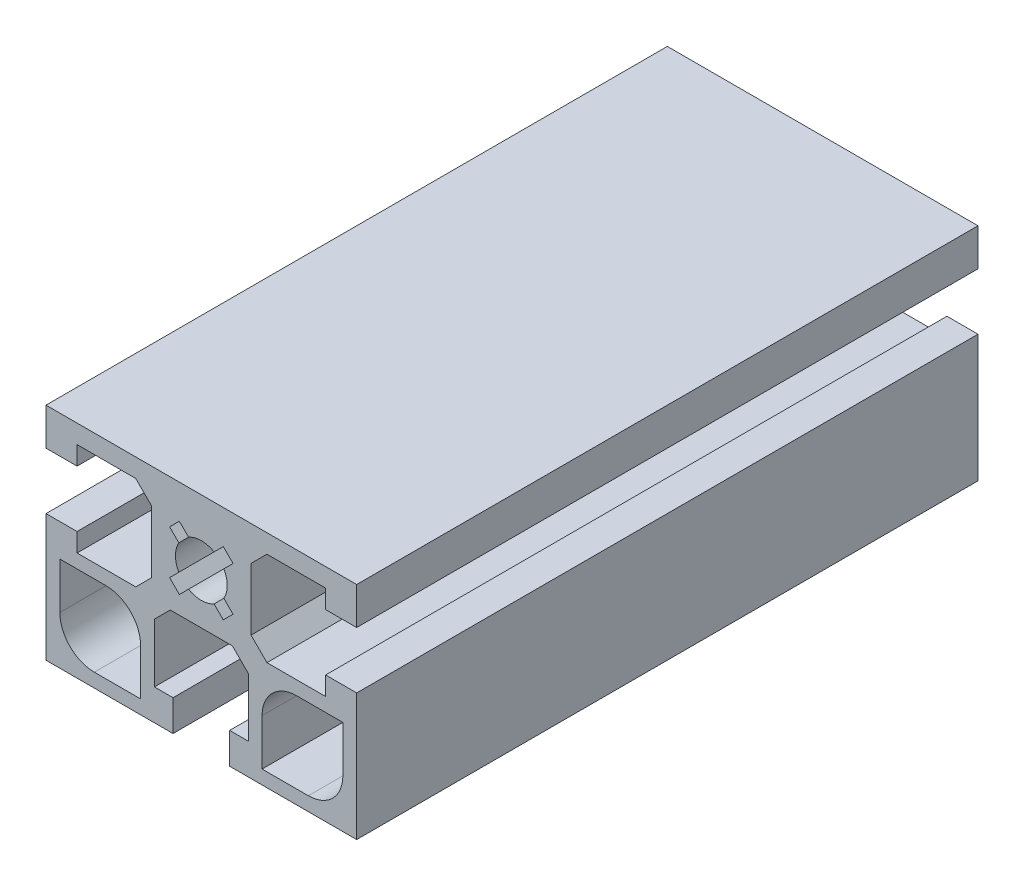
ISO-10303-21;
HEADER;
FILE_DESCRIPTION(('STEP AP214'),'2;1');
FILE_NAME('part.step','',(''),(''),'','','');
FILE_SCHEMA(('AUTOMOTIVE_DESIGN { 1 0 10303 214 1 1 1 1 }'));
ENDSEC;
DATA;
#1=APPLICATION_CONTEXT('core data for automotive mechanical design processes');
#2=APPLICATION_PROTOCOL_DEFINITION('international standard','automotive_design',2000,#1);
#3=PRODUCT_CONTEXT('',#1,'mechanical');
#4=PRODUCT('Part','Part','',(#3));
#5=PRODUCT_RELATED_PRODUCT_CATEGORY('part','',(#4));
#6=PRODUCT_DEFINITION_FORMATION('','',#4);
#7=PRODUCT_DEFINITION_CONTEXT('part definition',#1,'design');
#8=PRODUCT_DEFINITION('design','',#6,#7);
#9=PRODUCT_DEFINITION_SHAPE('','',#8);
#10=(LENGTH_UNIT() NAMED_UNIT(*) SI_UNIT(.MILLI.,.METRE.));
#11=(NAMED_UNIT(*) PLANE_ANGLE_UNIT() SI_UNIT($,.RADIAN.));
#12=(NAMED_UNIT(*) SI_UNIT($,.STERADIAN.) SOLID_ANGLE_UNIT());
#13=UNCERTAINTY_MEASURE_WITH_UNIT(LENGTH_MEASURE(1.E-05),#10,'distance_accuracy_value','');
#14=(GEOMETRIC_REPRESENTATION_CONTEXT(3) GLOBAL_UNCERTAINTY_ASSIGNED_CONTEXT((#13)) GLOBAL_UNIT_ASSIGNED_CONTEXT((#10,
#11,#12)) REPRESENTATION_CONTEXT('',''));
#15=CARTESIAN_POINT('',(0.,0.,0.));
#16=DIRECTION('',(0.,0.,1.));
#17=DIRECTION('',(1.,0.,0.));
#18=AXIS2_PLACEMENT_3D('',#15,#16,#17);
#19=CARTESIAN_POINT('',(-3.26273781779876,1.84852425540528,-45.));
#20=DIRECTION('',(-0.707106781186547,-0.707106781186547,0.));
#21=DIRECTION('',(0.707106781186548,-0.707106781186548,0.));
#22=AXIS2_PLACEMENT_3D('',#19,#20,#21);
#23=PLANE('',#22);
#24=DIRECTION('',(0.,0.,1.));
#25=VECTOR('',#24,1.);
#26=CARTESIAN_POINT('',(-4.59619407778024,3.18198051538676,-45.));
#27=LINE('',#26,#25);
#28=CARTESIAN_POINT('',(-4.59619407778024,3.18198051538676,-45.));
#29=VERTEX_POINT('',#28);
#30=CARTESIAN_POINT('',(-4.59619407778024,3.18198051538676,-23.9577379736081));
#31=VERTEX_POINT('',#30);
#32=EDGE_CURVE('E1035',#29,#31,#27,.T.);
#33=ORIENTED_EDGE('',*,*,#32,.T.);
#34=CARTESIAN_POINT('',(-1.41421356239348,0.,-22.5));
#35=DIRECTION('',(-0.707106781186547,-0.707106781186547,0.));
#36=DIRECTION('',(-0.707106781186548,0.707106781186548,0.));
#37=AXIS2_PLACEMENT_3D('',#34,#35,#36);
#38=ELLIPSE('',#37,4.94974746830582,3.49999999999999);
#39=CARTESIAN_POINT('',(-3.26273781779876,1.84852425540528,-25.4720292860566));
#40=VERTEX_POINT('',#39);
#41=EDGE_CURVE('E1307',#31,#40,#38,.T.);
#42=ORIENTED_EDGE('',*,*,#41,.T.);
#43=DIRECTION('',(0.,0.,1.));
#44=VECTOR('',#43,1.);
#45=CARTESIAN_POINT('',(-3.26273781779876,1.84852425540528,-45.));
#46=LINE('',#45,#44);
#47=CARTESIAN_POINT('',(-3.26273781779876,1.84852425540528,-45.));
#48=VERTEX_POINT('',#47);
#49=EDGE_CURVE('E616',#48,#40,#46,.T.);
#50=ORIENTED_EDGE('',*,*,#49,.F.);
#51=DIRECTION('',(0.707106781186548,-0.707106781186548,0.));
#52=VECTOR('',#51,1.);
#53=CARTESIAN_POINT('',(-3.26273781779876,1.84852425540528,-45.));
#54=LINE('',#53,#52);
#55=EDGE_CURVE('E1043',#29,#48,#54,.T.);
#56=ORIENTED_EDGE('',*,*,#55,.F.);
#57=EDGE_LOOP('',(#33,#42,#50,#56));
#58=FACE_BOUND('',#57,.T.);
#59=ADVANCED_FACE('F30',(#58),#23,.F.);
#60=CARTESIAN_POINT('',(4.5961940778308,3.18198051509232,-45.));
#61=DIRECTION('',(0.707106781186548,-0.707106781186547,0.));
#62=DIRECTION('',(0.707106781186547,0.707106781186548,0.));
#63=AXIS2_PLACEMENT_3D('',#60,#61,#62);
#64=PLANE('',#63);
#65=DIRECTION('',(0.,0.,1.));
#66=VECTOR('',#65,1.);
#67=CARTESIAN_POINT('',(3.26273781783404,1.84852425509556,-45.));
#68=LINE('',#67,#66);
#69=CARTESIAN_POINT('',(3.26273781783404,1.84852425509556,-45.));
#70=VERTEX_POINT('',#69);
#71=CARTESIAN_POINT('',(3.26273781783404,1.84852425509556,-25.4720292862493));
#72=VERTEX_POINT('',#71);
#73=EDGE_CURVE('E1008',#70,#72,#68,.T.);
#74=ORIENTED_EDGE('',*,*,#73,.T.);
#75=CARTESIAN_POINT('',(1.41421356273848,0.,-22.5));
#76=DIRECTION('',(0.707106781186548,-0.707106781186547,0.));
#77=DIRECTION('',(-0.707106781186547,-0.707106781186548,0.));
#78=AXIS2_PLACEMENT_3D('',#75,#76,#77);
#79=ELLIPSE('',#78,4.94974746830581,3.49999999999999);
#80=CARTESIAN_POINT('',(4.5961940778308,3.18198051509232,-23.9577379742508));
#81=VERTEX_POINT('',#80);
#82=EDGE_CURVE('E1356',#72,#81,#79,.T.);
#83=ORIENTED_EDGE('',*,*,#82,.T.);
#84=DIRECTION('',(0.,0.,1.));
#85=VECTOR('',#84,1.);
#86=CARTESIAN_POINT('',(4.5961940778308,3.18198051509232,-45.));
#87=LINE('',#86,#85);
#88=CARTESIAN_POINT('',(4.5961940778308,3.18198051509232,-45.));
#89=VERTEX_POINT('',#88);
#90=EDGE_CURVE('E1010',#89,#81,#87,.T.);
#91=ORIENTED_EDGE('',*,*,#90,.F.);
#92=DIRECTION('',(0.707106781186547,0.707106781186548,0.));
#93=VECTOR('',#92,1.);
#94=CARTESIAN_POINT('',(4.5961940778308,3.18198051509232,-45.));
#95=LINE('',#94,#93);
#96=EDGE_CURVE('E1061',#70,#89,#95,.T.);
#97=ORIENTED_EDGE('',*,*,#96,.F.);
#98=EDGE_LOOP('',(#74,#83,#91,#97));
#99=FACE_BOUND('',#98,.T.);
#100=ADVANCED_FACE('F1355',(#99),#64,.F.);
#101=CARTESIAN_POINT('',(3.26273781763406,-1.84852425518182,-45.));
#102=DIRECTION('',(0.707106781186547,0.707106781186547,0.));
#103=DIRECTION('',(-0.707106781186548,0.707106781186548,0.));
#104=AXIS2_PLACEMENT_3D('',#101,#102,#103);
#105=PLANE('',#104);
#106=DIRECTION('',(0.,0.,1.));
#107=VECTOR('',#106,1.);
#108=CARTESIAN_POINT('',(3.26273781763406,-1.84852425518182,-45.));
#109=LINE('',#108,#107);
#110=CARTESIAN_POINT('',(3.26273781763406,-1.84852425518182,-19.5279707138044));
#111=VERTEX_POINT('',#110);
#112=CARTESIAN_POINT('',(3.26273781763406,-1.84852425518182,19.5279707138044));
#113=VERTEX_POINT('',#112);
#114=EDGE_CURVE('E1452',#111,#113,#109,.T.);
#115=ORIENTED_EDGE('',*,*,#114,.F.);
#116=CARTESIAN_POINT('',(1.41421356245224,0.,-22.5));
#117=DIRECTION('',(0.707106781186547,0.707106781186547,0.));
#118=DIRECTION('',(-0.707106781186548,0.707106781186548,0.));
#119=AXIS2_PLACEMENT_3D('',#116,#117,#118);
#120=ELLIPSE('',#119,4.94974746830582,3.49999999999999);
#121=CARTESIAN_POINT('',(4.59619407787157,-3.18198051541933,-21.042262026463));
#122=VERTEX_POINT('',#121);
#123=EDGE_CURVE('E1361',#111,#122,#120,.T.);
#124=ORIENTED_EDGE('',*,*,#123,.T.);
#125=DIRECTION('',(0.,0.,1.));
#126=VECTOR('',#125,1.);
#127=CARTESIAN_POINT('',(4.59619407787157,-3.18198051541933,-45.));
#128=LINE('',#127,#126);
#129=CARTESIAN_POINT('',(4.59619407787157,-3.18198051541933,21.042262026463));
#130=VERTEX_POINT('',#129);
#131=EDGE_CURVE('E1343',#122,#130,#128,.T.);
#132=ORIENTED_EDGE('',*,*,#131,.T.);
#133=CARTESIAN_POINT('',(1.41421356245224,0.,22.5));
#134=DIRECTION('',(0.707106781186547,0.707106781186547,0.));
#135=DIRECTION('',(-0.707106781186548,0.707106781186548,0.));
#136=AXIS2_PLACEMENT_3D('',#133,#134,#135);
#137=ELLIPSE('',#136,4.94974746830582,3.49999999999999);
#138=EDGE_CURVE('E964',#130,#113,#137,.T.);
#139=ORIENTED_EDGE('',*,*,#138,.T.);
#140=EDGE_LOOP('',(#115,#124,#132,#139));
#141=FACE_BOUND('',#140,.T.);
#142=ADVANCED_FACE('F1387',(#141),#105,.F.);
#143=CARTESIAN_POINT('',(9.92567813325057E-11,1.33356839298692E-10,-45.));
#144=DIRECTION('',(0.,0.,1.));
#145=DIRECTION('',(1.,0.,0.));
#146=AXIS2_PLACEMENT_3D('',#143,#144,#145);
#147=CYLINDRICAL_SURFACE('',#146,3.74999999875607);
#148=DIRECTION('',(0.,0.,1.));
#149=VECTOR('',#148,1.);
#150=CARTESIAN_POINT('',(-3.26273781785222,-1.84852425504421,-45.));
#151=LINE('',#150,#149);
#152=CARTESIAN_POINT('',(-3.26273781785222,-1.84852425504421,-19.5279707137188));
#153=VERTEX_POINT('',#152);
#154=CARTESIAN_POINT('',(-3.26273781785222,-1.84852425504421,19.5279707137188));
#155=VERTEX_POINT('',#154);
#156=EDGE_CURVE('E610',#153,#155,#151,.T.);
#157=ORIENTED_EDGE('',*,*,#156,.F.);
#158=CARTESIAN_POINT('',(-3.26273781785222,-1.84852425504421,-19.5279707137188));
#159=CARTESIAN_POINT('',(-3.29835994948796,-1.78563522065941,-19.4888657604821));
#160=CARTESIAN_POINT('',(-3.33259671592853,-1.72097382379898,-19.4514097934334));
#161=CARTESIAN_POINT('',(-3.39794135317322,-1.58808303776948,-19.3801104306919));
#162=CARTESIAN_POINT('',(-3.42904620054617,-1.5198502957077,-19.346270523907));
#163=CARTESIAN_POINT('',(-3.51734490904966,-1.30918428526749,-19.2504092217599));
#164=CARTESIAN_POINT('',(-3.56912611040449,-1.16146901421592,-19.1944801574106));
#165=CARTESIAN_POINT('',(-3.6333848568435,-0.931372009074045,-19.1252322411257));
#166=CARTESIAN_POINT('',(-3.65261251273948,-0.852962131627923,-19.1045440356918));
#167=CARTESIAN_POINT('',(-3.68613401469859,-0.693905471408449,-19.0685093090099));
#168=CARTESIAN_POINT('',(-3.70043051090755,-0.613259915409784,-19.0531599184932));
#169=CARTESIAN_POINT('',(-3.72373466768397,-0.450587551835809,-19.0281531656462));
#170=CARTESIAN_POINT('',(-3.73275824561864,-0.368565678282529,-19.018478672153));
#171=CARTESIAN_POINT('',(-3.74538064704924,-0.203656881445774,-19.0049490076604));
#172=CARTESIAN_POINT('',(-3.74898014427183,-0.120770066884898,-19.0010931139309));
#173=CARTESIAN_POINT('',(-3.75130634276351,0.111951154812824,-18.9985996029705));
#174=CARTESIAN_POINT('',(-3.74378665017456,0.262020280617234,-19.0066520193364));
#175=CARTESIAN_POINT('',(-3.71124396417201,0.558052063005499,-19.0415509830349));
#176=CARTESIAN_POINT('',(-3.68620197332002,0.70401008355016,-19.0684179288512));
#177=CARTESIAN_POINT('',(-3.62110597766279,0.985148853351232,-19.1384421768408));
#178=CARTESIAN_POINT('',(-3.58135790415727,1.1204854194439,-19.1812676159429));
#179=CARTESIAN_POINT('',(-3.4891395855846,1.38112710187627,-19.2810007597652));
#180=CARTESIAN_POINT('',(-3.43667604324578,1.50643745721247,-19.3379010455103));
#181=CARTESIAN_POINT('',(-3.36070489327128,1.66432396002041,-19.4207305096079));
#182=CARTESIAN_POINT('',(-3.3417631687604,1.70202176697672,-19.441412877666));
#183=CARTESIAN_POINT('',(-3.30294324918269,1.77617842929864,-19.4838753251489));
#184=CARTESIAN_POINT('',(-3.28306703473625,1.81263964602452,-19.5056530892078));
#185=CARTESIAN_POINT('',(-3.26273781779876,1.84852425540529,-19.5279707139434));
#186=B_SPLINE_CURVE_WITH_KNOTS('',3,(#158,#159,#160,#161,#162,#163,#164,#165,#166,#167,#168,
#169,#170,#171,#172,#173,#174,#175,#176,#177,#178,#179,#180,#181,#182,#183,#184,#185),
.UNSPECIFIED.,.F.,.F.,(4,2,2,2,2,2,2,2,2,2,2,2,2,4),(0.,0.246412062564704,0.49305976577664,
0.98903971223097,1.23878796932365,1.48840179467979,1.73725816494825,1.98608362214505,
2.43500893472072,2.88442172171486,3.32496770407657,3.76528196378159,3.90621600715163,
4.04686374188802),.UNSPECIFIED.);
#187=CARTESIAN_POINT('',(-3.26273781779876,1.84852425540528,-19.5279707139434));
#188=VERTEX_POINT('',#187);
#189=EDGE_CURVE('E1426',#153,#188,#186,.T.);
#190=ORIENTED_EDGE('',*,*,#189,.T.);
#191=CARTESIAN_POINT('',(-3.26273781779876,1.84852425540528,19.5279707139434));
#192=VERTEX_POINT('',#191);
#193=EDGE_CURVE('E1042',#188,#192,#46,.T.);
#194=ORIENTED_EDGE('',*,*,#193,.T.);
#195=CARTESIAN_POINT('',(-3.26273781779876,1.84852425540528,19.5279707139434));
#196=CARTESIAN_POINT('',(-3.29835994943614,1.78563522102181,19.4888657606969));
#197=CARTESIAN_POINT('',(-3.33259671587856,1.72097382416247,19.4514097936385));
#198=CARTESIAN_POINT('',(-3.39794135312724,1.58808303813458,19.3801104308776));
#199=CARTESIAN_POINT('',(-3.42904620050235,1.51985029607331,19.3462705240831));
#200=CARTESIAN_POINT('',(-3.51734490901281,1.30918428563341,19.250409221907));
#201=CARTESIAN_POINT('',(-3.56912611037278,1.16146901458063,19.1944801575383));
#202=CARTESIAN_POINT('',(-3.6333848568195,0.931372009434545,19.1252322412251));
#203=CARTESIAN_POINT('',(-3.65261251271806,0.852962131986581,19.1045440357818));
#204=CARTESIAN_POINT('',(-3.68613401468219,0.693905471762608,19.0685093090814));
#205=CARTESIAN_POINT('',(-3.70043051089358,0.613259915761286,19.0531599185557));
#206=CARTESIAN_POINT('',(-3.72373466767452,0.450587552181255,19.0281531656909));
#207=CARTESIAN_POINT('',(-3.73275824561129,0.36856567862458,19.0184786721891));
#208=CARTESIAN_POINT('',(-3.74538064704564,0.203656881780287,19.0049490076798));
#209=CARTESIAN_POINT('',(-3.74898014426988,0.120770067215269,19.0010931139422));
#210=CARTESIAN_POINT('',(-3.75130634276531,-0.11195115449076,18.99859960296));
#211=CARTESIAN_POINT('',(-3.74378665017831,-0.262020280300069,19.0066520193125));
#212=CARTESIAN_POINT('',(-3.7112439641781,-0.558052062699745,19.0415509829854));
#213=CARTESIAN_POINT('',(-3.6862019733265,-0.704010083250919,19.0684179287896));
#214=CARTESIAN_POINT('',(-3.6211059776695,-0.985148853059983,19.1384421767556));
#215=CARTESIAN_POINT('',(-3.58135790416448,-1.12048541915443,19.1812676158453));
#216=CARTESIAN_POINT('',(-3.48913958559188,-1.38112710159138,19.2810007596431));
#217=CARTESIAN_POINT('',(-3.43667604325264,-1.50643745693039,19.337901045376));
#218=CARTESIAN_POINT('',(-3.36070489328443,-1.66432395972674,19.4207305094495));
#219=CARTESIAN_POINT('',(-3.34176316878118,-1.70202176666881,19.4414128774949));
#220=CARTESIAN_POINT('',(-3.30294324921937,-1.77617842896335,19.4838753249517));
#221=CARTESIAN_POINT('',(-3.28306703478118,-1.81263964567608,19.5056530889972));
#222=CARTESIAN_POINT('',(-3.26273781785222,-1.84852425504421,19.5279707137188));
#223=B_SPLINE_CURVE_WITH_KNOTS('',3,(#195,#196,#197,#198,#199,#200,#201,#202,#203,#204,#205,
#206,#207,#208,#209,#210,#211,#212,#213,#214,#215,#216,#217,#218,#219,#220,#221,#222),
.UNSPECIFIED.,.F.,.F.,(4,2,2,2,2,2,2,2,2,2,2,2,2,4),(0.,0.246412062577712,0.493059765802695,
0.989039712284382,1.23878796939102,1.48840179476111,1.73725816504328,1.98608362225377,
2.4350089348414,2.88442172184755,3.32496770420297,3.76528196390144,3.90621600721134,
4.04686374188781),.UNSPECIFIED.);
#224=EDGE_CURVE('E890',#192,#155,#223,.T.);
#225=ORIENTED_EDGE('',*,*,#224,.T.);
#226=EDGE_LOOP('',(#157,#190,#194,#225));
#227=FACE_BOUND('',#226,.T.);
#228=ADVANCED_FACE('F1411',(#227),#147,.F.);
#229=CARTESIAN_POINT('',(9.92567813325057E-11,1.33356839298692E-10,-45.));
#230=DIRECTION('',(0.,0.,1.));
#231=DIRECTION('',(1.,0.,0.));
#232=AXIS2_PLACEMENT_3D('',#229,#230,#231);
#233=CYLINDRICAL_SURFACE('',#232,3.74999999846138);
#234=CARTESIAN_POINT('',(3.26273781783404,1.84852425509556,-19.5279707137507));
#235=VERTEX_POINT('',#234);
#236=CARTESIAN_POINT('',(3.26273781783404,1.84852425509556,19.5279707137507));
#237=VERTEX_POINT('',#236);
#238=EDGE_CURVE('E1012',#235,#237,#68,.T.);
#239=ORIENTED_EDGE('',*,*,#238,.F.);
#240=CARTESIAN_POINT('',(3.26273781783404,1.84852425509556,-19.5279707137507));
#241=CARTESIAN_POINT('',(3.29835994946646,1.78563522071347,-19.4888657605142));
#242=CARTESIAN_POINT('',(3.33259671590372,1.72097382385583,-19.4514097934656));
#243=CARTESIAN_POINT('',(3.3979413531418,1.5880830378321,-19.3801104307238));
#244=CARTESIAN_POINT('',(3.42904620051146,1.51985029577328,-19.3462705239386));
#245=CARTESIAN_POINT('',(3.51734490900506,1.30918428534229,-19.2504092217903));
#246=CARTESIAN_POINT('',(3.56912611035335,1.16146901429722,-19.1944801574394));
#247=CARTESIAN_POINT('',(3.63338485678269,0.931372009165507,-19.125232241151));
#248=CARTESIAN_POINT('',(3.65261251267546,0.852962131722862,-19.1045440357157));
#249=CARTESIAN_POINT('',(3.68613401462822,0.693905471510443,-19.0685093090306));
#250=CARTESIAN_POINT('',(3.70043051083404,0.613259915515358,-19.0531599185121));
#251=CARTESIAN_POINT('',(3.72373466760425,0.450587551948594,-19.0281531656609));
#252=CARTESIAN_POINT('',(3.73275824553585,0.368565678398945,-19.0184786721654));
#253=CARTESIAN_POINT('',(3.74538064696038,0.203656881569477,-19.0049490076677));
#254=CARTESIAN_POINT('',(3.74898014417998,0.120770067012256,-19.0010931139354));
#255=CARTESIAN_POINT('',(3.75130634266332,-0.111951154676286,-18.9985996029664));
#256=CARTESIAN_POINT('',(3.74378665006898,-0.262020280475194,-19.0066520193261));
#257=CARTESIAN_POINT('',(3.71124396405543,-0.5580520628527,-19.0415509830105));
#258=CARTESIAN_POINT('',(3.68620197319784,-0.704010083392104,-19.068417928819));
#259=CARTESIAN_POINT('',(3.62110597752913,-0.985148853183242,-19.1384421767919));
#260=CARTESIAN_POINT('',(3.58135790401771,-1.12048541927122,-19.1812676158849));
#261=CARTESIAN_POINT('',(3.48913958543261,-1.38112710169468,-19.2810007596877));
#262=CARTESIAN_POINT('',(3.43667604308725,-1.50643745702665,-19.3379010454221));
#263=CARTESIAN_POINT('',(3.36070489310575,-1.66432395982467,-19.4207305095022));
#264=CARTESIAN_POINT('',(3.34176316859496,-1.70202176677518,-19.4414128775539));
#265=CARTESIAN_POINT('',(3.30294324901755,-1.77617842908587,-19.4838753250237));
#266=CARTESIAN_POINT('',(3.28306703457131,-1.81263964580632,-19.5056530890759));
#267=CARTESIAN_POINT('',(3.26273781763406,-1.84852425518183,-19.5279707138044));
#268=B_SPLINE_CURVE_WITH_KNOTS('',3,(#240,#241,#242,#243,#244,#245,#246,#247,#248,#249,#250,
#251,#252,#253,#254,#255,#256,#257,#258,#259,#260,#261,#262,#263,#264,#265,#266,#267),
.UNSPECIFIED.,.F.,.F.,(4,2,2,2,2,2,2,2,2,2,2,2,2,4),(0.,0.246412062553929,0.493059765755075,
0.989039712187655,1.23878796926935,1.48840179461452,1.73725816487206,1.98608362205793,
2.43500893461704,2.88442172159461,3.32496770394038,3.76528196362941,3.90621600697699,
4.04686374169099),.UNSPECIFIED.);
#269=EDGE_CURVE('E940',#235,#111,#268,.T.);
#270=ORIENTED_EDGE('',*,*,#269,.T.);
#271=ORIENTED_EDGE('',*,*,#114,.T.);
#272=CARTESIAN_POINT('',(3.26273781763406,-1.84852425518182,19.5279707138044));
#273=CARTESIAN_POINT('',(3.29835994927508,-1.78563522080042,19.4888657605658));
#274=CARTESIAN_POINT('',(3.33259671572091,-1.72097382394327,19.4514097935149));
#275=CARTESIAN_POINT('',(3.39794135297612,-1.58808303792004,19.3801104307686));
#276=CARTESIAN_POINT('',(3.42904620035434,-1.51985029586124,19.346270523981));
#277=CARTESIAN_POINT('',(3.51734490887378,-1.30918428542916,19.2504092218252));
#278=CARTESIAN_POINT('',(3.56912611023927,-1.16146901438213,19.194480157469));
#279=CARTESIAN_POINT('',(3.63338485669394,-0.931372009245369,19.125232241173));
#280=CARTESIAN_POINT('',(3.6526125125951,-0.852962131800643,19.1045440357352));
#281=CARTESIAN_POINT('',(3.68613401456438,-0.69390547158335,19.0685093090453));
#282=CARTESIAN_POINT('',(3.70043051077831,-0.613259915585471,19.0531599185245));
#283=CARTESIAN_POINT('',(3.72373466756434,-0.450587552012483,19.0281531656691));
#284=CARTESIAN_POINT('',(3.73275824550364,-0.368565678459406,19.0184786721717));
#285=CARTESIAN_POINT('',(3.7453806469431,-0.203656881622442,19.0049490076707));
#286=CARTESIAN_POINT('',(3.74898014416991,-0.120770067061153,19.001093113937));
#287=CARTESIAN_POINT('',(3.75130634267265,0.111951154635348,18.9985996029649));
#288=CARTESIAN_POINT('',(3.74378665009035,0.262020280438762,19.0066520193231));
#289=CARTESIAN_POINT('',(3.71124396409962,0.558052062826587,19.0415509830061));
#290=CARTESIAN_POINT('',(3.6862019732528,0.704010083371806,19.0684179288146));
#291=CARTESIAN_POINT('',(3.6211059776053,0.985148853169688,19.1384421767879));
#292=CARTESIAN_POINT('',(3.58135790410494,1.12048541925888,19.1812676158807));
#293=CARTESIAN_POINT('',(3.48913958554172,1.38112710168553,19.2810007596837));
#294=CARTESIAN_POINT('',(3.4366760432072,1.50643745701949,19.3379010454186));
#295=CARTESIAN_POINT('',(3.36070489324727,1.66432395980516,19.4207305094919));
#296=CARTESIAN_POINT('',(3.34176316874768,1.7020217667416,19.4414128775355));
#297=CARTESIAN_POINT('',(3.30294324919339,1.7761784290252,19.4838753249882));
#298=CARTESIAN_POINT('',(3.28306703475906,1.81263964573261,19.5056530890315));
#299=CARTESIAN_POINT('',(3.26273781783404,1.84852425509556,19.5279707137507));
#300=B_SPLINE_CURVE_WITH_KNOTS('',3,(#272,#273,#274,#275,#276,#277,#278,#279,#280,#281,#282,
#283,#284,#285,#286,#287,#288,#289,#290,#291,#292,#293,#294,#295,#296,#297,#298,#299),
.UNSPECIFIED.,.F.,.F.,(4,2,2,2,2,2,2,2,2,2,2,2,2,4),(0.,0.246412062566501,0.493059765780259,
0.989039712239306,1.23878796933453,1.48840179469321,1.73725816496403,1.98608362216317,
2.4350089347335,2.88442172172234,3.32496770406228,3.76528196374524,3.9062160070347,
4.04686374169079),.UNSPECIFIED.);
#301=EDGE_CURVE('E873',#113,#237,#300,.T.);
#302=ORIENTED_EDGE('',*,*,#301,.T.);
#303=EDGE_LOOP('',(#239,#270,#271,#302));
#304=FACE_BOUND('',#303,.T.);
#305=ADVANCED_FACE('F1380',(#304),#233,.F.);
#306=CARTESIAN_POINT('',(-4.59619407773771,-3.1819805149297,-45.));
#307=DIRECTION('',(-0.707106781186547,0.707106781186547,0.));
#308=DIRECTION('',(-0.707106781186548,-0.707106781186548,0.));
#309=AXIS2_PLACEMENT_3D('',#306,#307,#308);
#310=PLANE('',#309);
#311=DIRECTION('',(0.,0.,1.));
#312=VECTOR('',#311,1.);
#313=CARTESIAN_POINT('',(-4.59619407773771,-3.1819805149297,-45.));
#314=LINE('',#313,#312);
#315=CARTESIAN_POINT('',(-4.59619407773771,-3.1819805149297,-21.0422620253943));
#316=VERTEX_POINT('',#315);
#317=CARTESIAN_POINT('',(-4.59619407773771,-3.1819805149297,21.0422620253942));
#318=VERTEX_POINT('',#317);
#319=EDGE_CURVE('E603',#316,#318,#314,.T.);
#320=ORIENTED_EDGE('',*,*,#319,.F.);
#321=CARTESIAN_POINT('',(-1.41421356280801,0.,-22.5));
#322=DIRECTION('',(-0.707106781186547,0.707106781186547,0.));
#323=DIRECTION('',(-0.707106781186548,-0.707106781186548,0.));
#324=AXIS2_PLACEMENT_3D('',#321,#322,#323);
#325=ELLIPSE('',#324,4.94974746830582,3.49999999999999);
#326=EDGE_CURVE('E1921',#316,#153,#325,.T.);
#327=ORIENTED_EDGE('',*,*,#326,.T.);
#328=ORIENTED_EDGE('',*,*,#156,.T.);
#329=CARTESIAN_POINT('',(-1.41421356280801,0.,22.5));
#330=DIRECTION('',(-0.707106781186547,0.707106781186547,0.));
#331=DIRECTION('',(-0.707106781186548,-0.707106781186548,0.));
#332=AXIS2_PLACEMENT_3D('',#329,#330,#331);
#333=ELLIPSE('',#332,4.94974746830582,3.49999999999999);
#334=EDGE_CURVE('E1437',#155,#318,#333,.T.);
#335=ORIENTED_EDGE('',*,*,#334,.T.);
#336=EDGE_LOOP('',(#320,#327,#328,#335));
#337=FACE_BOUND('',#336,.T.);
#338=ADVANCED_FACE('F1402',(#337),#310,.F.);
#339=ORIENTED_EDGE('',*,*,#193,.F.);
#340=CARTESIAN_POINT('',(-4.59619407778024,3.18198051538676,-21.0422620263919));
#341=VERTEX_POINT('',#340);
#342=EDGE_CURVE('E1374',#188,#341,#38,.T.);
#343=ORIENTED_EDGE('',*,*,#342,.T.);
#344=CARTESIAN_POINT('',(-4.59619407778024,3.18198051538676,21.0422620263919));
#345=VERTEX_POINT('',#344);
#346=EDGE_CURVE('E1039',#341,#345,#27,.T.);
#347=ORIENTED_EDGE('',*,*,#346,.T.);
#348=CARTESIAN_POINT('',(-1.41421356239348,0.,22.5));
#349=DIRECTION('',(-0.707106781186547,-0.707106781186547,0.));
#350=DIRECTION('',(-0.707106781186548,0.707106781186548,0.));
#351=AXIS2_PLACEMENT_3D('',#348,#349,#350);
#352=ELLIPSE('',#351,4.94974746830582,3.49999999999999);
#353=EDGE_CURVE('E1433',#345,#192,#352,.T.);
#354=ORIENTED_EDGE('',*,*,#353,.T.);
#355=EDGE_LOOP('',(#339,#343,#347,#354));
#356=FACE_BOUND('',#355,.T.);
#357=ADVANCED_FACE('F1395',(#356),#23,.F.);
#358=CARTESIAN_POINT('',(4.5961940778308,3.18198051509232,-21.0422620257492));
#359=VERTEX_POINT('',#358);
#360=CARTESIAN_POINT('',(4.5961940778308,3.18198051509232,21.0422620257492));
#361=VERTEX_POINT('',#360);
#362=EDGE_CURVE('E999',#359,#361,#87,.T.);
#363=ORIENTED_EDGE('',*,*,#362,.F.);
#364=EDGE_CURVE('E1360',#359,#235,#79,.T.);
#365=ORIENTED_EDGE('',*,*,#364,.T.);
#366=ORIENTED_EDGE('',*,*,#238,.T.);
#367=CARTESIAN_POINT('',(1.41421356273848,0.,22.5));
#368=DIRECTION('',(0.707106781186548,-0.707106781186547,0.));
#369=DIRECTION('',(-0.707106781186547,-0.707106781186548,0.));
#370=AXIS2_PLACEMENT_3D('',#367,#368,#369);
#371=ELLIPSE('',#370,4.94974746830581,3.49999999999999);
#372=EDGE_CURVE('E969',#237,#361,#371,.T.);
#373=ORIENTED_EDGE('',*,*,#372,.T.);
#374=EDGE_LOOP('',(#363,#365,#366,#373));
#375=FACE_BOUND('',#374,.T.);
#376=ADVANCED_FACE('F1400',(#375),#64,.F.);
#377=CARTESIAN_POINT('',(-3.26273781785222,-1.84852425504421,25.4720292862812));
#378=VERTEX_POINT('',#377);
#379=CARTESIAN_POINT('',(-3.26273781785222,-1.84852425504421,45.));
#380=VERTEX_POINT('',#379);
#381=EDGE_CURVE('E611',#378,#380,#151,.T.);
#382=ORIENTED_EDGE('',*,*,#381,.F.);
#383=CARTESIAN_POINT('',(-3.26273781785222,-1.84852425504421,25.4720292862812));
#384=CARTESIAN_POINT('',(-3.29835994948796,-1.78563522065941,25.5111342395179));
#385=CARTESIAN_POINT('',(-3.33259671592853,-1.72097382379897,25.5485902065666));
#386=CARTESIAN_POINT('',(-3.39794135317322,-1.58808303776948,25.6198895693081));
#387=CARTESIAN_POINT('',(-3.42904620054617,-1.51985029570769,25.653729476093));
#388=CARTESIAN_POINT('',(-3.51734490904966,-1.30918428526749,25.7495907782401));
#389=CARTESIAN_POINT('',(-3.56912611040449,-1.16146901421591,25.8055198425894));
#390=CARTESIAN_POINT('',(-3.6333848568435,-0.931372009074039,25.8747677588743));
#391=CARTESIAN_POINT('',(-3.65261251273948,-0.852962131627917,25.8954559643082));
#392=CARTESIAN_POINT('',(-3.68613401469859,-0.693905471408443,25.9314906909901));
#393=CARTESIAN_POINT('',(-3.70043051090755,-0.613259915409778,25.9468400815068));
#394=CARTESIAN_POINT('',(-3.72373466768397,-0.450587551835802,25.9718468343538));
#395=CARTESIAN_POINT('',(-3.73275824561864,-0.368565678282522,25.981521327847));
#396=CARTESIAN_POINT('',(-3.74538064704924,-0.203656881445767,25.9950509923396));
#397=CARTESIAN_POINT('',(-3.74898014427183,-0.120770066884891,25.9989068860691));
#398=CARTESIAN_POINT('',(-3.75130634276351,0.111951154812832,26.0014003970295));
#399=CARTESIAN_POINT('',(-3.74378665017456,0.262020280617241,25.9933479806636));
#400=CARTESIAN_POINT('',(-3.71124396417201,0.558052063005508,25.9584490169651));
#401=CARTESIAN_POINT('',(-3.68620197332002,0.704010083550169,25.9315820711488));
#402=CARTESIAN_POINT('',(-3.62110597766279,0.985148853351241,25.8615578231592));
#403=CARTESIAN_POINT('',(-3.58135790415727,1.12048541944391,25.8187323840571));
#404=CARTESIAN_POINT('',(-3.4891395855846,1.38112710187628,25.7189992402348));
#405=CARTESIAN_POINT('',(-3.43667604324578,1.50643745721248,25.6620989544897));
#406=CARTESIAN_POINT('',(-3.36070489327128,1.66432396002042,25.5792694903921));
#407=CARTESIAN_POINT('',(-3.34176316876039,1.70202176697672,25.558587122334));
#408=CARTESIAN_POINT('',(-3.30294324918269,1.77617842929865,25.5161246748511));
#409=CARTESIAN_POINT('',(-3.28306703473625,1.81263964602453,25.4943469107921));
#410=CARTESIAN_POINT('',(-3.26273781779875,1.84852425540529,25.4720292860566));
#411=B_SPLINE_CURVE_WITH_KNOTS('',3,(#383,#384,#385,#386,#387,#388,#389,#390,#391,#392,#393,
#394,#395,#396,#397,#398,#399,#400,#401,#402,#403,#404,#405,#406,#407,#408,#409,#410),
.UNSPECIFIED.,.F.,.F.,(4,2,2,2,2,2,2,2,2,2,2,2,2,4),(0.,0.246412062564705,0.493059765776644,
0.989039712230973,1.23878796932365,1.48840179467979,1.73725816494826,1.98608362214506,
2.43500893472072,2.88442172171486,3.32496770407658,3.7652819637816,3.90621600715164,
4.04686374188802),.UNSPECIFIED.);
#412=CARTESIAN_POINT('',(-3.26273781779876,1.84852425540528,25.4720292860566));
#413=VERTEX_POINT('',#412);
#414=EDGE_CURVE('E898',#378,#413,#411,.T.);
#415=ORIENTED_EDGE('',*,*,#414,.T.);
#416=CARTESIAN_POINT('',(-3.26273781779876,1.84852425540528,45.));
#417=VERTEX_POINT('',#416);
#418=EDGE_CURVE('E1038',#413,#417,#46,.T.);
#419=ORIENTED_EDGE('',*,*,#418,.T.);
#420=CARTESIAN_POINT('',(9.92567813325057E-11,1.33356839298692E-10,45.));
#421=DIRECTION('',(0.,0.,1.));
#422=DIRECTION('',(1.,0.,0.));
#423=AXIS2_PLACEMENT_3D('',#420,#421,#422);
#424=CIRCLE('',#423,3.74999999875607);
#425=EDGE_CURVE('E1264',#417,#380,#424,.T.);
#426=ORIENTED_EDGE('',*,*,#425,.T.);
#427=EDGE_LOOP('',(#382,#415,#419,#426));
#428=FACE_BOUND('',#427,.T.);
#429=ADVANCED_FACE('F1412',(#428),#147,.F.);
#430=CARTESIAN_POINT('',(3.26273781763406,-1.84852425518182,25.4720292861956));
#431=VERTEX_POINT('',#430);
#432=CARTESIAN_POINT('',(3.26273781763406,-1.84852425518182,45.));
#433=VERTEX_POINT('',#432);
#434=EDGE_CURVE('E1342',#431,#433,#109,.T.);
#435=ORIENTED_EDGE('',*,*,#434,.F.);
#436=CARTESIAN_POINT('',(4.59619407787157,-3.18198051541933,23.9577379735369));
#437=VERTEX_POINT('',#436);
#438=EDGE_CURVE('E970',#431,#437,#137,.T.);
#439=ORIENTED_EDGE('',*,*,#438,.T.);
#440=CARTESIAN_POINT('',(4.59619407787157,-3.18198051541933,45.));
#441=VERTEX_POINT('',#440);
#442=EDGE_CURVE('E1332',#437,#441,#128,.T.);
#443=ORIENTED_EDGE('',*,*,#442,.T.);
#444=DIRECTION('',(-0.707106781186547,0.707106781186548,0.));
#445=VECTOR('',#444,1.);
#446=CARTESIAN_POINT('',(3.26273781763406,-1.84852425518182,45.));
#447=LINE('',#446,#445);
#448=EDGE_CURVE('E1246',#441,#433,#447,.T.);
#449=ORIENTED_EDGE('',*,*,#448,.T.);
#450=EDGE_LOOP('',(#435,#439,#443,#449));
#451=FACE_BOUND('',#450,.T.);
#452=ADVANCED_FACE('F1388',(#451),#105,.F.);
#453=CARTESIAN_POINT('',(-4.59619407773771,-3.1819805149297,23.9577379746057));
#454=VERTEX_POINT('',#453);
#455=CARTESIAN_POINT('',(-4.59619407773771,-3.1819805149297,45.));
#456=VERTEX_POINT('',#455);
#457=EDGE_CURVE('E605',#454,#456,#314,.T.);
#458=ORIENTED_EDGE('',*,*,#457,.F.);
#459=EDGE_CURVE('E1439',#454,#378,#333,.T.);
#460=ORIENTED_EDGE('',*,*,#459,.T.);
#461=ORIENTED_EDGE('',*,*,#381,.T.);
#462=DIRECTION('',(-0.707106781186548,-0.707106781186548,0.));
#463=VECTOR('',#462,1.);
#464=CARTESIAN_POINT('',(-4.59619407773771,-3.1819805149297,45.));
#465=LINE('',#464,#463);
#466=EDGE_CURVE('E1261',#380,#456,#465,.T.);
#467=ORIENTED_EDGE('',*,*,#466,.T.);
#468=EDGE_LOOP('',(#458,#460,#461,#467));
#469=FACE_BOUND('',#468,.T.);
#470=ADVANCED_FACE('F1445',(#469),#310,.F.);
#471=CARTESIAN_POINT('',(3.26273781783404,1.84852425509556,25.4720292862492));
#472=VERTEX_POINT('',#471);
#473=CARTESIAN_POINT('',(3.26273781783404,1.84852425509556,45.));
#474=VERTEX_POINT('',#473);
#475=EDGE_CURVE('E1014',#472,#474,#68,.T.);
#476=ORIENTED_EDGE('',*,*,#475,.F.);
#477=CARTESIAN_POINT('',(3.26273781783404,1.84852425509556,25.4720292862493));
#478=CARTESIAN_POINT('',(3.29835994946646,1.78563522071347,25.5111342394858));
#479=CARTESIAN_POINT('',(3.33259671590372,1.72097382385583,25.5485902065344));
#480=CARTESIAN_POINT('',(3.3979413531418,1.58808303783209,25.6198895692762));
#481=CARTESIAN_POINT('',(3.42904620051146,1.51985029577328,25.6537294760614));
#482=CARTESIAN_POINT('',(3.51734490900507,1.30918428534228,25.7495907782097));
#483=CARTESIAN_POINT('',(3.56912611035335,1.16146901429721,25.8055198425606));
#484=CARTESIAN_POINT('',(3.63338485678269,0.931372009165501,25.874767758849));
#485=CARTESIAN_POINT('',(3.65261251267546,0.852962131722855,25.8954559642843));
#486=CARTESIAN_POINT('',(3.68613401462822,0.693905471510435,25.9314906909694));
#487=CARTESIAN_POINT('',(3.70043051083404,0.61325991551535,25.9468400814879));
#488=CARTESIAN_POINT('',(3.72373466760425,0.450587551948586,25.9718468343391));
#489=CARTESIAN_POINT('',(3.73275824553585,0.368565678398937,25.9815213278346));
#490=CARTESIAN_POINT('',(3.74538064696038,0.203656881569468,25.9950509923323));
#491=CARTESIAN_POINT('',(3.74898014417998,0.120770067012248,25.9989068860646));
#492=CARTESIAN_POINT('',(3.75130634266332,-0.111951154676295,26.0014003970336));
#493=CARTESIAN_POINT('',(3.74378665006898,-0.262020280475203,25.9933479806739));
#494=CARTESIAN_POINT('',(3.71124396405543,-0.55805206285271,25.9584490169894));
#495=CARTESIAN_POINT('',(3.68620197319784,-0.704010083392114,25.931582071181));
#496=CARTESIAN_POINT('',(3.62110597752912,-0.985148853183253,25.8615578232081));
#497=CARTESIAN_POINT('',(3.58135790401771,-1.12048541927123,25.8187323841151));
#498=CARTESIAN_POINT('',(3.48913958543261,-1.38112710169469,25.7189992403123));
#499=CARTESIAN_POINT('',(3.43667604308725,-1.50643745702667,25.6620989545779));
#500=CARTESIAN_POINT('',(3.36070489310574,-1.66432395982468,25.5792694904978));
#501=CARTESIAN_POINT('',(3.34176316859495,-1.70202176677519,25.5585871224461));
#502=CARTESIAN_POINT('',(3.30294324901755,-1.77617842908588,25.5161246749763));
#503=CARTESIAN_POINT('',(3.28306703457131,-1.81263964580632,25.4943469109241));
#504=CARTESIAN_POINT('',(3.26273781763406,-1.84852425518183,25.4720292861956));
#505=B_SPLINE_CURVE_WITH_KNOTS('',3,(#477,#478,#479,#480,#481,#482,#483,#484,#485,#486,#487,
#488,#489,#490,#491,#492,#493,#494,#495,#496,#497,#498,#499,#500,#501,#502,#503,#504),
.UNSPECIFIED.,.F.,.F.,(4,2,2,2,2,2,2,2,2,2,2,2,2,4),(0.,0.246412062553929,0.493059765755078,
0.989039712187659,1.23878796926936,1.48840179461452,1.73725816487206,1.98608362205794,
2.43500893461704,2.88442172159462,3.32496770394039,3.76528196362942,3.90621600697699,
4.04686374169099),.UNSPECIFIED.);
#506=EDGE_CURVE('E882',#472,#431,#505,.T.);
#507=ORIENTED_EDGE('',*,*,#506,.T.);
#508=ORIENTED_EDGE('',*,*,#434,.T.);
#509=CARTESIAN_POINT('',(9.92567813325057E-11,1.33356839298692E-10,45.));
#510=DIRECTION('',(0.,0.,1.));
#511=DIRECTION('',(1.,0.,0.));
#512=AXIS2_PLACEMENT_3D('',#509,#510,#511);
#513=CIRCLE('',#512,3.74999999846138);
#514=EDGE_CURVE('E1243',#433,#474,#513,.T.);
#515=ORIENTED_EDGE('',*,*,#514,.T.);
#516=EDGE_LOOP('',(#476,#507,#508,#515));
#517=FACE_BOUND('',#516,.T.);
#518=ADVANCED_FACE('F1381',(#517),#233,.F.);
#519=CARTESIAN_POINT('',(-22.4999999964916,-4.09999999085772,-45.));
#520=DIRECTION('',(-1.,0.,0.));
#521=DIRECTION('',(0.,0.,1.));
#522=AXIS2_PLACEMENT_3D('',#519,#520,#521);
#523=PLANE('',#522);
#524=DIRECTION('',(0.,0.,1.));
#525=VECTOR('',#524,1.);
#526=CARTESIAN_POINT('',(-22.4999999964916,-22.4999999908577,-45.));
#527=LINE('',#526,#525);
#528=CARTESIAN_POINT('',(-22.4999999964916,-22.4999999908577,-45.));
#529=VERTEX_POINT('',#528);
#530=CARTESIAN_POINT('',(-22.4999999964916,-22.4999999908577,45.));
#531=VERTEX_POINT('',#530);
#532=EDGE_CURVE('E775',#529,#531,#527,.T.);
#533=ORIENTED_EDGE('',*,*,#532,.T.);
#534=DIRECTION('',(0.,-1.,0.));
#535=VECTOR('',#534,1.);
#536=CARTESIAN_POINT('',(-22.4999999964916,-4.09999999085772,45.));
#537=LINE('',#536,#535);
#538=CARTESIAN_POINT('',(-22.4999999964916,-4.09999999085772,45.));
#539=VERTEX_POINT('',#538);
#540=EDGE_CURVE('E1187',#539,#531,#537,.T.);
#541=ORIENTED_EDGE('',*,*,#540,.F.);
#542=DIRECTION('',(0.,0.,1.));
#543=VECTOR('',#542,1.);
#544=CARTESIAN_POINT('',(-22.4999999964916,-4.09999999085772,-45.));
#545=LINE('',#544,#543);
#546=CARTESIAN_POINT('',(-22.4999999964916,-4.09999999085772,-45.));
#547=VERTEX_POINT('',#546);
#548=EDGE_CURVE('E776',#547,#539,#545,.T.);
#549=ORIENTED_EDGE('',*,*,#548,.F.);
#550=DIRECTION('',(0.,-1.,0.));
#551=VECTOR('',#550,1.);
#552=CARTESIAN_POINT('',(-22.4999999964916,-4.09999999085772,-45.));
#553=LINE('',#552,#551);
#554=EDGE_CURVE('E664',#547,#529,#553,.T.);
#555=ORIENTED_EDGE('',*,*,#554,.T.);
#556=EDGE_LOOP('',(#533,#541,#549,#555));
#557=FACE_BOUND('',#556,.T.);
#558=ADVANCED_FACE('F32',(#557),#523,.T.);
#559=CARTESIAN_POINT('',(-17.9999999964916,-4.09999999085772,-45.));
#560=DIRECTION('',(0.,1.,0.));
#561=DIRECTION('',(0.,0.,1.));
#562=AXIS2_PLACEMENT_3D('',#559,#560,#561);
#563=PLANE('',#562);
#564=ORIENTED_EDGE('',*,*,#548,.T.);
#565=DIRECTION('',(-1.,0.,0.));
#566=VECTOR('',#565,1.);
#567=CARTESIAN_POINT('',(-17.9999999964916,-4.09999999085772,45.));
#568=LINE('',#567,#566);
#569=CARTESIAN_POINT('',(-17.9999999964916,-4.09999999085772,45.));
#570=VERTEX_POINT('',#569);
#571=EDGE_CURVE('E1088',#570,#539,#568,.T.);
#572=ORIENTED_EDGE('',*,*,#571,.F.);
#573=DIRECTION('',(0.,0.,1.));
#574=VECTOR('',#573,1.);
#575=CARTESIAN_POINT('',(-17.9999999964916,-4.09999999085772,-45.));
#576=LINE('',#575,#574);
#577=CARTESIAN_POINT('',(-17.9999999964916,-4.09999999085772,-45.));
#578=VERTEX_POINT('',#577);
#579=EDGE_CURVE('E779',#578,#570,#576,.T.);
#580=ORIENTED_EDGE('',*,*,#579,.F.);
#581=DIRECTION('',(-1.,0.,0.));
#582=VECTOR('',#581,1.);
#583=CARTESIAN_POINT('',(-17.9999999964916,-4.09999999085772,-45.));
#584=LINE('',#583,#582);
#585=EDGE_CURVE('E772',#578,#547,#584,.T.);
#586=ORIENTED_EDGE('',*,*,#585,.T.);
#587=EDGE_LOOP('',(#564,#572,#580,#586));
#588=FACE_BOUND('',#587,.T.);
#589=ADVANCED_FACE('F1543',(#588),#563,.T.);
#590=CARTESIAN_POINT('',(-17.9999999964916,-6.79999999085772,-45.));
#591=DIRECTION('',(1.,0.,0.));
#592=DIRECTION('',(0.,0.,-1.));
#593=AXIS2_PLACEMENT_3D('',#590,#591,#592);
#594=PLANE('',#593);
#595=ORIENTED_EDGE('',*,*,#579,.T.);
#596=DIRECTION('',(0.,1.,0.));
#597=VECTOR('',#596,1.);
#598=CARTESIAN_POINT('',(-17.9999999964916,-6.79999999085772,45.));
#599=LINE('',#598,#597);
#600=CARTESIAN_POINT('',(-17.9999999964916,-6.79999999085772,45.));
#601=VERTEX_POINT('',#600);
#602=EDGE_CURVE('E1091',#601,#570,#599,.T.);
#603=ORIENTED_EDGE('',*,*,#602,.F.);
#604=DIRECTION('',(0.,0.,1.));
#605=VECTOR('',#604,1.);
#606=CARTESIAN_POINT('',(-17.9999999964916,-6.79999999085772,-45.));
#607=LINE('',#606,#605);
#608=CARTESIAN_POINT('',(-17.9999999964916,-6.79999999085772,-45.));
#609=VERTEX_POINT('',#608);
#610=EDGE_CURVE('E781',#609,#601,#607,.T.);
#611=ORIENTED_EDGE('',*,*,#610,.F.);
#612=DIRECTION('',(0.,1.,0.));
#613=VECTOR('',#612,1.);
#614=CARTESIAN_POINT('',(-17.9999999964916,-6.79999999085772,-45.));
#615=LINE('',#614,#613);
#616=EDGE_CURVE('E769',#609,#578,#615,.T.);
#617=ORIENTED_EDGE('',*,*,#616,.T.);
#618=EDGE_LOOP('',(#595,#603,#611,#617));
#619=FACE_BOUND('',#618,.T.);
#620=ADVANCED_FACE('F1538',(#619),#594,.T.);
#621=CARTESIAN_POINT('',(-9.49999999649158,-6.79999999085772,-45.));
#622=DIRECTION('',(0.,1.,0.));
#623=DIRECTION('',(0.,0.,1.));
#624=AXIS2_PLACEMENT_3D('',#621,#622,#623);
#625=PLANE('',#624);
#626=ORIENTED_EDGE('',*,*,#610,.T.);
#627=DIRECTION('',(-1.,0.,0.));
#628=VECTOR('',#627,1.);
#629=CARTESIAN_POINT('',(-9.49999999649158,-6.79999999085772,45.));
#630=LINE('',#629,#628);
#631=CARTESIAN_POINT('',(-9.49999999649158,-6.79999999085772,45.));
#632=VERTEX_POINT('',#631);
#633=EDGE_CURVE('E1094',#632,#601,#630,.T.);
#634=ORIENTED_EDGE('',*,*,#633,.F.);
#635=DIRECTION('',(0.,0.,1.));
#636=VECTOR('',#635,1.);
#637=CARTESIAN_POINT('',(-9.49999999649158,-6.79999999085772,-45.));
#638=LINE('',#637,#636);
#639=CARTESIAN_POINT('',(-9.49999999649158,-6.79999999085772,-45.));
#640=VERTEX_POINT('',#639);
#641=EDGE_CURVE('E783',#640,#632,#638,.T.);
#642=ORIENTED_EDGE('',*,*,#641,.F.);
#643=DIRECTION('',(-1.,0.,0.));
#644=VECTOR('',#643,1.);
#645=CARTESIAN_POINT('',(-9.49999999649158,-6.79999999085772,-45.));
#646=LINE('',#645,#644);
#647=EDGE_CURVE('E766',#640,#609,#646,.T.);
#648=ORIENTED_EDGE('',*,*,#647,.T.);
#649=EDGE_LOOP('',(#626,#634,#642,#648));
#650=FACE_BOUND('',#649,.T.);
#651=ADVANCED_FACE('F1534',(#650),#625,.T.);
#652=CARTESIAN_POINT('',(-7.19999999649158,-4.49999999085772,-45.));
#653=DIRECTION('',(-0.707106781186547,0.707106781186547,0.));
#654=DIRECTION('',(-0.707106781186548,-0.707106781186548,0.));
#655=AXIS2_PLACEMENT_3D('',#652,#653,#654);
#656=PLANE('',#655);
#657=ORIENTED_EDGE('',*,*,#641,.T.);
#658=DIRECTION('',(-0.707106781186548,-0.707106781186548,0.));
#659=VECTOR('',#658,1.);
#660=CARTESIAN_POINT('',(-7.19999999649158,-4.49999999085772,45.));
#661=LINE('',#660,#659);
#662=CARTESIAN_POINT('',(-7.19999999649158,-4.49999999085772,45.));
#663=VERTEX_POINT('',#662);
#664=EDGE_CURVE('E1097',#663,#632,#661,.T.);
#665=ORIENTED_EDGE('',*,*,#664,.F.);
#666=DIRECTION('',(0.,0.,1.));
#667=VECTOR('',#666,1.);
#668=CARTESIAN_POINT('',(-7.19999999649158,-4.49999999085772,-45.));
#669=LINE('',#668,#667);
#670=CARTESIAN_POINT('',(-7.19999999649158,-4.49999999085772,-45.));
#671=VERTEX_POINT('',#670);
#672=EDGE_CURVE('E785',#671,#663,#669,.T.);
#673=ORIENTED_EDGE('',*,*,#672,.F.);
#674=DIRECTION('',(-0.707106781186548,-0.707106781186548,0.));
#675=VECTOR('',#674,1.);
#676=CARTESIAN_POINT('',(-7.19999999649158,-4.49999999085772,-45.));
#677=LINE('',#676,#675);
#678=EDGE_CURVE('E763',#671,#640,#677,.T.);
#679=ORIENTED_EDGE('',*,*,#678,.T.);
#680=EDGE_LOOP('',(#657,#665,#673,#679));
#681=FACE_BOUND('',#680,.T.);
#682=ADVANCED_FACE('F1532',(#681),#656,.T.);
#683=CARTESIAN_POINT('',(-7.19999999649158,4.50000000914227,-45.));
#684=DIRECTION('',(-1.,0.,0.));
#685=DIRECTION('',(0.,0.,1.));
#686=AXIS2_PLACEMENT_3D('',#683,#684,#685);
#687=PLANE('',#686);
#688=CARTESIAN_POINT('',(-7.19999999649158,0.,-22.5));
#689=DIRECTION('',(-1.,0.,0.));
#690=DIRECTION('',(0.,0.,1.));
#691=AXIS2_PLACEMENT_3D('',#688,#689,#690);
#692=CIRCLE('',#691,3.49999999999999);
#693=CARTESIAN_POINT('',(-7.19999999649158,0.,-19.));
#694=VERTEX_POINT('',#693);
#695=EDGE_CURVE('E951',#694,#694,#692,.T.);
#696=ORIENTED_EDGE('',*,*,#695,.F.);
#697=EDGE_LOOP('',(#696));
#698=FACE_BOUND('',#697,.T.);
#699=CARTESIAN_POINT('',(-7.19999999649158,0.,22.5));
#700=DIRECTION('',(-1.,0.,0.));
#701=DIRECTION('',(0.,0.,1.));
#702=AXIS2_PLACEMENT_3D('',#699,#700,#701);
#703=CIRCLE('',#702,3.49999999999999);
#704=CARTESIAN_POINT('',(-7.19999999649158,0.,26.));
#705=VERTEX_POINT('',#704);
#706=EDGE_CURVE('E1270',#705,#705,#703,.T.);
#707=ORIENTED_EDGE('',*,*,#706,.F.);
#708=EDGE_LOOP('',(#707));
#709=FACE_BOUND('',#708,.T.);
#710=ORIENTED_EDGE('',*,*,#672,.T.);
#711=DIRECTION('',(0.,-1.,0.));
#712=VECTOR('',#711,1.);
#713=CARTESIAN_POINT('',(-7.19999999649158,4.50000000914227,45.));
#714=LINE('',#713,#712);
#715=CARTESIAN_POINT('',(-7.19999999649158,4.50000000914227,45.));
#716=VERTEX_POINT('',#715);
#717=EDGE_CURVE('E1100',#716,#663,#714,.T.);
#718=ORIENTED_EDGE('',*,*,#717,.F.);
#719=DIRECTION('',(0.,0.,1.));
#720=VECTOR('',#719,1.);
#721=CARTESIAN_POINT('',(-7.19999999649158,4.50000000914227,-45.));
#722=LINE('',#721,#720);
#723=CARTESIAN_POINT('',(-7.19999999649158,4.50000000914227,-45.));
#724=VERTEX_POINT('',#723);
#725=EDGE_CURVE('E787',#724,#716,#722,.T.);
#726=ORIENTED_EDGE('',*,*,#725,.F.);
#727=DIRECTION('',(0.,-1.,0.));
#728=VECTOR('',#727,1.);
#729=CARTESIAN_POINT('',(-7.19999999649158,4.50000000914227,-45.));
#730=LINE('',#729,#728);
#731=EDGE_CURVE('E760',#724,#671,#730,.T.);
#732=ORIENTED_EDGE('',*,*,#731,.T.);
#733=EDGE_LOOP('',(#710,#718,#726,#732));
#734=FACE_BOUND('',#733,.T.);
#735=ADVANCED_FACE('F1527',(#698,#709,#734),#687,.T.);
#736=CARTESIAN_POINT('',(-9.4999999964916,6.80000000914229,-45.));
#737=DIRECTION('',(-0.707106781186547,-0.707106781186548,0.));
#738=DIRECTION('',(0.707106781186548,-0.707106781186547,0.));
#739=AXIS2_PLACEMENT_3D('',#736,#737,#738);
#740=PLANE('',#739);
#741=ORIENTED_EDGE('',*,*,#725,.T.);
#742=DIRECTION('',(0.707106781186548,-0.707106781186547,0.));
#743=VECTOR('',#742,1.);
#744=CARTESIAN_POINT('',(-9.4999999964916,6.80000000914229,45.));
#745=LINE('',#744,#743);
#746=CARTESIAN_POINT('',(-9.4999999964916,6.80000000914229,45.));
#747=VERTEX_POINT('',#746);
#748=EDGE_CURVE('E1103',#747,#716,#745,.T.);
#749=ORIENTED_EDGE('',*,*,#748,.F.);
#750=DIRECTION('',(0.,0.,1.));
#751=VECTOR('',#750,1.);
#752=CARTESIAN_POINT('',(-9.4999999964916,6.80000000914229,-45.));
#753=LINE('',#752,#751);
#754=CARTESIAN_POINT('',(-9.4999999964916,6.80000000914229,-45.));
#755=VERTEX_POINT('',#754);
#756=EDGE_CURVE('E789',#755,#747,#753,.T.);
#757=ORIENTED_EDGE('',*,*,#756,.F.);
#758=DIRECTION('',(0.707106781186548,-0.707106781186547,0.));
#759=VECTOR('',#758,1.);
#760=CARTESIAN_POINT('',(-9.4999999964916,6.80000000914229,-45.));
#761=LINE('',#760,#759);
#762=EDGE_CURVE('E757',#755,#724,#761,.T.);
#763=ORIENTED_EDGE('',*,*,#762,.T.);
#764=EDGE_LOOP('',(#741,#749,#757,#763));
#765=FACE_BOUND('',#764,.T.);
#766=ADVANCED_FACE('F1522',(#765),#740,.T.);
#767=CARTESIAN_POINT('',(-17.9999999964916,6.80000000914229,-45.));
#768=DIRECTION('',(0.,-1.,0.));
#769=DIRECTION('',(0.,0.,-1.));
#770=AXIS2_PLACEMENT_3D('',#767,#768,#769);
#771=PLANE('',#770);
#772=ORIENTED_EDGE('',*,*,#756,.T.);
#773=DIRECTION('',(1.,0.,0.));
#774=VECTOR('',#773,1.);
#775=CARTESIAN_POINT('',(-17.9999999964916,6.80000000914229,45.));
#776=LINE('',#775,#774);
#777=CARTESIAN_POINT('',(-17.9999999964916,6.80000000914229,45.));
#778=VERTEX_POINT('',#777);
#779=EDGE_CURVE('E1106',#778,#747,#776,.T.);
#780=ORIENTED_EDGE('',*,*,#779,.F.);
#781=DIRECTION('',(0.,0.,1.));
#782=VECTOR('',#781,1.);
#783=CARTESIAN_POINT('',(-17.9999999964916,6.80000000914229,-45.));
#784=LINE('',#783,#782);
#785=CARTESIAN_POINT('',(-17.9999999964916,6.80000000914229,-45.));
#786=VERTEX_POINT('',#785);
#787=EDGE_CURVE('E791',#786,#778,#784,.T.);
#788=ORIENTED_EDGE('',*,*,#787,.F.);
#789=DIRECTION('',(1.,0.,0.));
#790=VECTOR('',#789,1.);
#791=CARTESIAN_POINT('',(-17.9999999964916,6.80000000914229,-45.));
#792=LINE('',#791,#790);
#793=EDGE_CURVE('E754',#786,#755,#792,.T.);
#794=ORIENTED_EDGE('',*,*,#793,.T.);
#795=EDGE_LOOP('',(#772,#780,#788,#794));
#796=FACE_BOUND('',#795,.T.);
#797=ADVANCED_FACE('F1520',(#796),#771,.T.);
#798=CARTESIAN_POINT('',(-17.9999999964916,4.10000000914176,-45.));
#799=DIRECTION('',(1.,0.,0.));
#800=DIRECTION('',(0.,0.,-1.));
#801=AXIS2_PLACEMENT_3D('',#798,#799,#800);
#802=PLANE('',#801);
#803=ORIENTED_EDGE('',*,*,#787,.T.);
#804=DIRECTION('',(0.,1.,0.));
#805=VECTOR('',#804,1.);
#806=CARTESIAN_POINT('',(-17.9999999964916,4.10000000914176,45.));
#807=LINE('',#806,#805);
#808=CARTESIAN_POINT('',(-17.9999999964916,4.10000000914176,45.));
#809=VERTEX_POINT('',#808);
#810=EDGE_CURVE('E1109',#809,#778,#807,.T.);
#811=ORIENTED_EDGE('',*,*,#810,.F.);
#812=DIRECTION('',(0.,0.,1.));
#813=VECTOR('',#812,1.);
#814=CARTESIAN_POINT('',(-17.9999999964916,4.10000000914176,-45.));
#815=LINE('',#814,#813);
#816=CARTESIAN_POINT('',(-17.9999999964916,4.10000000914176,-45.));
#817=VERTEX_POINT('',#816);
#818=EDGE_CURVE('E793',#817,#809,#815,.T.);
#819=ORIENTED_EDGE('',*,*,#818,.F.);
#820=DIRECTION('',(0.,1.,0.));
#821=VECTOR('',#820,1.);
#822=CARTESIAN_POINT('',(-17.9999999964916,4.10000000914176,-45.));
#823=LINE('',#822,#821);
#824=EDGE_CURVE('E751',#817,#786,#823,.T.);
#825=ORIENTED_EDGE('',*,*,#824,.T.);
#826=EDGE_LOOP('',(#803,#811,#819,#825));
#827=FACE_BOUND('',#826,.T.);
#828=ADVANCED_FACE('F1515',(#827),#802,.T.);
#829=CARTESIAN_POINT('',(-22.4999999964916,4.10000000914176,-45.));
#830=DIRECTION('',(0.,-1.,0.));
#831=DIRECTION('',(0.,0.,-1.));
#832=AXIS2_PLACEMENT_3D('',#829,#830,#831);
#833=PLANE('',#832);
#834=ORIENTED_EDGE('',*,*,#818,.T.);
#835=DIRECTION('',(1.,0.,0.));
#836=VECTOR('',#835,1.);
#837=CARTESIAN_POINT('',(-22.4999999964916,4.10000000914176,45.));
#838=LINE('',#837,#836);
#839=CARTESIAN_POINT('',(-22.4999999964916,4.10000000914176,45.));
#840=VERTEX_POINT('',#839);
#841=EDGE_CURVE('E1112',#840,#809,#838,.T.);
#842=ORIENTED_EDGE('',*,*,#841,.F.);
#843=DIRECTION('',(0.,0.,1.));
#844=VECTOR('',#843,1.);
#845=CARTESIAN_POINT('',(-22.4999999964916,4.10000000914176,-45.));
#846=LINE('',#845,#844);
#847=CARTESIAN_POINT('',(-22.4999999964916,4.10000000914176,-45.));
#848=VERTEX_POINT('',#847);
#849=EDGE_CURVE('E795',#848,#840,#846,.T.);
#850=ORIENTED_EDGE('',*,*,#849,.F.);
#851=DIRECTION('',(1.,0.,0.));
#852=VECTOR('',#851,1.);
#853=CARTESIAN_POINT('',(-22.4999999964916,4.10000000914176,-45.));
#854=LINE('',#853,#852);
#855=EDGE_CURVE('E748',#848,#817,#854,.T.);
#856=ORIENTED_EDGE('',*,*,#855,.T.);
#857=EDGE_LOOP('',(#834,#842,#850,#856));
#858=FACE_BOUND('',#857,.T.);
#859=ADVANCED_FACE('F1510',(#858),#833,.T.);
#860=CARTESIAN_POINT('',(-22.4999999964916,9.49999999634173,-45.));
#861=DIRECTION('',(-1.,0.,0.));
#862=DIRECTION('',(0.,0.,1.));
#863=AXIS2_PLACEMENT_3D('',#860,#861,#862);
#864=PLANE('',#863);
#865=ORIENTED_EDGE('',*,*,#849,.T.);
#866=DIRECTION('',(0.,-1.,0.));
#867=VECTOR('',#866,1.);
#868=CARTESIAN_POINT('',(-22.4999999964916,9.49999999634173,45.));
#869=LINE('',#868,#867);
#870=CARTESIAN_POINT('',(-22.4999999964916,9.49999999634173,45.));
#871=VERTEX_POINT('',#870);
#872=EDGE_CURVE('E1115',#871,#840,#869,.T.);
#873=ORIENTED_EDGE('',*,*,#872,.F.);
#874=DIRECTION('',(0.,0.,1.));
#875=VECTOR('',#874,1.);
#876=CARTESIAN_POINT('',(-22.4999999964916,9.49999999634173,-45.));
#877=LINE('',#876,#875);
#878=CARTESIAN_POINT('',(-22.4999999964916,9.49999999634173,-45.));
#879=VERTEX_POINT('',#878);
#880=EDGE_CURVE('E797',#879,#871,#877,.T.);
#881=ORIENTED_EDGE('',*,*,#880,.F.);
#882=DIRECTION('',(0.,-1.,0.));
#883=VECTOR('',#882,1.);
#884=CARTESIAN_POINT('',(-22.4999999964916,9.49999999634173,-45.));
#885=LINE('',#884,#883);
#886=EDGE_CURVE('E745',#879,#848,#885,.T.);
#887=ORIENTED_EDGE('',*,*,#886,.T.);
#888=EDGE_LOOP('',(#865,#873,#881,#887));
#889=FACE_BOUND('',#888,.T.);
#890=ADVANCED_FACE('F1508',(#889),#864,.T.);
#891=CARTESIAN_POINT('',(22.4999999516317,9.49999999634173,-45.));
#892=DIRECTION('',(0.,1.,0.));
#893=DIRECTION('',(0.,0.,1.));
#894=AXIS2_PLACEMENT_3D('',#891,#892,#893);
#895=PLANE('',#894);
#896=ORIENTED_EDGE('',*,*,#880,.T.);
#897=DIRECTION('',(-1.,0.,0.));
#898=VECTOR('',#897,1.);
#899=CARTESIAN_POINT('',(22.4999999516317,9.49999999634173,45.));
#900=LINE('',#899,#898);
#901=CARTESIAN_POINT('',(22.4999999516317,9.49999999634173,45.));
#902=VERTEX_POINT('',#901);
#903=EDGE_CURVE('E1118',#902,#871,#900,.T.);
#904=ORIENTED_EDGE('',*,*,#903,.F.);
#905=DIRECTION('',(0.,0.,1.));
#906=VECTOR('',#905,1.);
#907=CARTESIAN_POINT('',(22.4999999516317,9.49999999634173,-45.));
#908=LINE('',#907,#906);
#909=CARTESIAN_POINT('',(22.4999999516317,9.49999999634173,-45.));
#910=VERTEX_POINT('',#909);
#911=EDGE_CURVE('E799',#910,#902,#908,.T.);
#912=ORIENTED_EDGE('',*,*,#911,.F.);
#913=DIRECTION('',(-1.,0.,0.));
#914=VECTOR('',#913,1.);
#915=CARTESIAN_POINT('',(22.4999999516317,9.49999999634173,-45.));
#916=LINE('',#915,#914);
#917=EDGE_CURVE('E742',#910,#879,#916,.T.);
#918=ORIENTED_EDGE('',*,*,#917,.T.);
#919=EDGE_LOOP('',(#896,#904,#912,#918));
#920=FACE_BOUND('',#919,.T.);
#921=ADVANCED_FACE('F1503',(#920),#895,.T.);
#922=CARTESIAN_POINT('',(22.4999999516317,4.10000000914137,-45.));
#923=DIRECTION('',(1.,0.,0.));
#924=DIRECTION('',(0.,0.,-1.));
#925=AXIS2_PLACEMENT_3D('',#922,#923,#924);
#926=PLANE('',#925);
#927=ORIENTED_EDGE('',*,*,#911,.T.);
#928=DIRECTION('',(0.,1.,0.));
#929=VECTOR('',#928,1.);
#930=CARTESIAN_POINT('',(22.4999999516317,4.10000000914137,45.));
#931=LINE('',#930,#929);
#932=CARTESIAN_POINT('',(22.4999999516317,4.10000000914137,45.));
#933=VERTEX_POINT('',#932);
#934=EDGE_CURVE('E1121',#933,#902,#931,.T.);
#935=ORIENTED_EDGE('',*,*,#934,.F.);
#936=DIRECTION('',(0.,0.,1.));
#937=VECTOR('',#936,1.);
#938=CARTESIAN_POINT('',(22.4999999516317,4.10000000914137,-45.));
#939=LINE('',#938,#937);
#940=CARTESIAN_POINT('',(22.4999999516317,4.10000000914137,-45.));
#941=VERTEX_POINT('',#940);
#942=EDGE_CURVE('E801',#941,#933,#939,.T.);
#943=ORIENTED_EDGE('',*,*,#942,.F.);
#944=DIRECTION('',(0.,1.,0.));
#945=VECTOR('',#944,1.);
#946=CARTESIAN_POINT('',(22.4999999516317,4.10000000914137,-45.));
#947=LINE('',#946,#945);
#948=EDGE_CURVE('E739',#941,#910,#947,.T.);
#949=ORIENTED_EDGE('',*,*,#948,.T.);
#950=EDGE_LOOP('',(#927,#935,#943,#949));
#951=FACE_BOUND('',#950,.T.);
#952=ADVANCED_FACE('F1498',(#951),#926,.T.);
#953=CARTESIAN_POINT('',(17.9999999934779,4.10000000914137,-45.));
#954=DIRECTION('',(0.,-1.,0.));
#955=DIRECTION('',(0.,0.,-1.));
#956=AXIS2_PLACEMENT_3D('',#953,#954,#955);
#957=PLANE('',#956);
#958=ORIENTED_EDGE('',*,*,#942,.T.);
#959=DIRECTION('',(1.,0.,0.));
#960=VECTOR('',#959,1.);
#961=CARTESIAN_POINT('',(17.9999999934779,4.10000000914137,45.));
#962=LINE('',#961,#960);
#963=CARTESIAN_POINT('',(17.9999999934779,4.10000000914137,45.));
#964=VERTEX_POINT('',#963);
#965=EDGE_CURVE('E1124',#964,#933,#962,.T.);
#966=ORIENTED_EDGE('',*,*,#965,.F.);
#967=DIRECTION('',(0.,0.,1.));
#968=VECTOR('',#967,1.);
#969=CARTESIAN_POINT('',(17.9999999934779,4.10000000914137,-45.));
#970=LINE('',#969,#968);
#971=CARTESIAN_POINT('',(17.9999999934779,4.10000000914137,-45.));
#972=VERTEX_POINT('',#971);
#973=EDGE_CURVE('E803',#972,#964,#970,.T.);
#974=ORIENTED_EDGE('',*,*,#973,.F.);
#975=DIRECTION('',(1.,0.,0.));
#976=VECTOR('',#975,1.);
#977=CARTESIAN_POINT('',(17.9999999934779,4.10000000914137,-45.));
#978=LINE('',#977,#976);
#979=EDGE_CURVE('E736',#972,#941,#978,.T.);
#980=ORIENTED_EDGE('',*,*,#979,.T.);
#981=EDGE_LOOP('',(#958,#966,#974,#980));
#982=FACE_BOUND('',#981,.T.);
#983=ADVANCED_FACE('F1496',(#982),#957,.T.);
#984=CARTESIAN_POINT('',(17.9999999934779,6.80000000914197,-45.));
#985=DIRECTION('',(-1.,0.,0.));
#986=DIRECTION('',(0.,0.,1.));
#987=AXIS2_PLACEMENT_3D('',#984,#985,#986);
#988=PLANE('',#987);
#989=ORIENTED_EDGE('',*,*,#973,.T.);
#990=DIRECTION('',(0.,-1.,0.));
#991=VECTOR('',#990,1.);
#992=CARTESIAN_POINT('',(17.9999999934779,6.80000000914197,45.));
#993=LINE('',#992,#991);
#994=CARTESIAN_POINT('',(17.9999999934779,6.80000000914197,45.));
#995=VERTEX_POINT('',#994);
#996=EDGE_CURVE('E1127',#995,#964,#993,.T.);
#997=ORIENTED_EDGE('',*,*,#996,.F.);
#998=DIRECTION('',(0.,0.,1.));
#999=VECTOR('',#998,1.);
#1000=CARTESIAN_POINT('',(17.9999999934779,6.80000000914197,-45.));
#1001=LINE('',#1000,#999);
#1002=CARTESIAN_POINT('',(17.9999999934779,6.80000000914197,-45.));
#1003=VERTEX_POINT('',#1002);
#1004=EDGE_CURVE('E805',#1003,#995,#1001,.T.);
#1005=ORIENTED_EDGE('',*,*,#1004,.F.);
#1006=DIRECTION('',(0.,-1.,0.));
#1007=VECTOR('',#1006,1.);
#1008=CARTESIAN_POINT('',(17.9999999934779,6.80000000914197,-45.));
#1009=LINE('',#1008,#1007);
#1010=EDGE_CURVE('E733',#1003,#972,#1009,.T.);
#1011=ORIENTED_EDGE('',*,*,#1010,.T.);
#1012=EDGE_LOOP('',(#989,#997,#1005,#1011));
#1013=FACE_BOUND('',#1012,.T.);
#1014=ADVANCED_FACE('F1491',(#1013),#988,.T.);
#1015=CARTESIAN_POINT('',(9.49999999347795,6.80000000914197,-45.));
#1016=DIRECTION('',(0.,-1.,0.));
#1017=DIRECTION('',(0.,0.,-1.));
#1018=AXIS2_PLACEMENT_3D('',#1015,#1016,#1017);
#1019=PLANE('',#1018);
#1020=ORIENTED_EDGE('',*,*,#1004,.T.);
#1021=DIRECTION('',(1.,0.,0.));
#1022=VECTOR('',#1021,1.);
#1023=CARTESIAN_POINT('',(9.49999999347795,6.80000000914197,45.));
#1024=LINE('',#1023,#1022);
#1025=CARTESIAN_POINT('',(9.49999999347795,6.80000000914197,45.));
#1026=VERTEX_POINT('',#1025);
#1027=EDGE_CURVE('E1130',#1026,#995,#1024,.T.);
#1028=ORIENTED_EDGE('',*,*,#1027,.F.);
#1029=DIRECTION('',(0.,0.,1.));
#1030=VECTOR('',#1029,1.);
#1031=CARTESIAN_POINT('',(9.49999999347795,6.80000000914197,-45.));
#1032=LINE('',#1031,#1030);
#1033=CARTESIAN_POINT('',(9.49999999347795,6.80000000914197,-45.));
#1034=VERTEX_POINT('',#1033);
#1035=EDGE_CURVE('E807',#1034,#1026,#1032,.T.);
#1036=ORIENTED_EDGE('',*,*,#1035,.F.);
#1037=DIRECTION('',(1.,0.,0.));
#1038=VECTOR('',#1037,1.);
#1039=CARTESIAN_POINT('',(9.49999999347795,6.80000000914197,-45.));
#1040=LINE('',#1039,#1038);
#1041=EDGE_CURVE('E730',#1034,#1003,#1040,.T.);
#1042=ORIENTED_EDGE('',*,*,#1041,.T.);
#1043=EDGE_LOOP('',(#1020,#1028,#1036,#1042));
#1044=FACE_BOUND('',#1043,.T.);
#1045=ADVANCED_FACE('F1484',(#1044),#1019,.T.);
#1046=CARTESIAN_POINT('',(7.19999999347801,4.50000000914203,-45.));
#1047=DIRECTION('',(0.707106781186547,-0.707106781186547,0.));
#1048=DIRECTION('',(0.707106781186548,0.707106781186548,0.));
#1049=AXIS2_PLACEMENT_3D('',#1046,#1047,#1048);
#1050=PLANE('',#1049);
#1051=ORIENTED_EDGE('',*,*,#1035,.T.);
#1052=DIRECTION('',(0.707106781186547,0.707106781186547,0.));
#1053=VECTOR('',#1052,1.);
#1054=CARTESIAN_POINT('',(7.19999999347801,4.50000000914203,45.));
#1055=LINE('',#1054,#1053);
#1056=CARTESIAN_POINT('',(7.19999999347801,4.50000000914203,45.));
#1057=VERTEX_POINT('',#1056);
#1058=EDGE_CURVE('E1133',#1057,#1026,#1055,.T.);
#1059=ORIENTED_EDGE('',*,*,#1058,.F.);
#1060=DIRECTION('',(0.,0.,1.));
#1061=VECTOR('',#1060,1.);
#1062=CARTESIAN_POINT('',(7.19999999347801,4.50000000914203,-45.));
#1063=LINE('',#1062,#1061);
#1064=CARTESIAN_POINT('',(7.19999999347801,4.50000000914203,-45.));
#1065=VERTEX_POINT('',#1064);
#1066=EDGE_CURVE('E809',#1065,#1057,#1063,.T.);
#1067=ORIENTED_EDGE('',*,*,#1066,.F.);
#1068=DIRECTION('',(0.707106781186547,0.707106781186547,0.));
#1069=VECTOR('',#1068,1.);
#1070=CARTESIAN_POINT('',(7.19999999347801,4.50000000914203,-45.));
#1071=LINE('',#1070,#1069);
#1072=EDGE_CURVE('E727',#1065,#1034,#1071,.T.);
#1073=ORIENTED_EDGE('',*,*,#1072,.T.);
#1074=EDGE_LOOP('',(#1051,#1059,#1067,#1073));
#1075=FACE_BOUND('',#1074,.T.);
#1076=ADVANCED_FACE('F1470',(#1075),#1050,.T.);
#1077=CARTESIAN_POINT('',(7.19999999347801,-4.49999999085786,-45.));
#1078=DIRECTION('',(1.,0.,0.));
#1079=DIRECTION('',(0.,0.,-1.));
#1080=AXIS2_PLACEMENT_3D('',#1077,#1078,#1079);
#1081=PLANE('',#1080);
#1082=CARTESIAN_POINT('',(7.19999999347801,0.,-22.5));
#1083=DIRECTION('',(1.,0.,0.));
#1084=DIRECTION('',(0.,0.,-1.));
#1085=AXIS2_PLACEMENT_3D('',#1082,#1083,#1084);
#1086=CIRCLE('',#1085,3.49999999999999);
#1087=CARTESIAN_POINT('',(7.19999999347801,0.,-26.));
#1088=VERTEX_POINT('',#1087);
#1089=EDGE_CURVE('E954',#1088,#1088,#1086,.T.);
#1090=ORIENTED_EDGE('',*,*,#1089,.F.);
#1091=EDGE_LOOP('',(#1090));
#1092=FACE_BOUND('',#1091,.T.);
#1093=CARTESIAN_POINT('',(7.19999999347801,0.,22.5));
#1094=DIRECTION('',(1.,0.,0.));
#1095=DIRECTION('',(0.,0.,-1.));
#1096=AXIS2_PLACEMENT_3D('',#1093,#1094,#1095);
#1097=CIRCLE('',#1096,3.49999999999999);
#1098=CARTESIAN_POINT('',(7.19999999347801,0.,19.));
#1099=VERTEX_POINT('',#1098);
#1100=EDGE_CURVE('E1267',#1099,#1099,#1097,.T.);
#1101=ORIENTED_EDGE('',*,*,#1100,.F.);
#1102=EDGE_LOOP('',(#1101));
#1103=FACE_BOUND('',#1102,.T.);
#1104=ORIENTED_EDGE('',*,*,#1066,.T.);
#1105=DIRECTION('',(0.,1.,0.));
#1106=VECTOR('',#1105,1.);
#1107=CARTESIAN_POINT('',(7.19999999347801,-4.49999999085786,45.));
#1108=LINE('',#1107,#1106);
#1109=CARTESIAN_POINT('',(7.19999999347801,-4.49999999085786,45.));
#1110=VERTEX_POINT('',#1109);
#1111=EDGE_CURVE('E1136',#1110,#1057,#1108,.T.);
#1112=ORIENTED_EDGE('',*,*,#1111,.F.);
#1113=DIRECTION('',(0.,0.,1.));
#1114=VECTOR('',#1113,1.);
#1115=CARTESIAN_POINT('',(7.19999999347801,-4.49999999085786,-45.));
#1116=LINE('',#1115,#1114);
#1117=CARTESIAN_POINT('',(7.19999999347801,-4.49999999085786,-45.));
#1118=VERTEX_POINT('',#1117);
#1119=EDGE_CURVE('E811',#1118,#1110,#1116,.T.);
#1120=ORIENTED_EDGE('',*,*,#1119,.F.);
#1121=DIRECTION('',(0.,1.,0.));
#1122=VECTOR('',#1121,1.);
#1123=CARTESIAN_POINT('',(7.19999999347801,-4.49999999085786,-45.));
#1124=LINE('',#1123,#1122);
#1125=EDGE_CURVE('E724',#1118,#1065,#1124,.T.);
#1126=ORIENTED_EDGE('',*,*,#1125,.T.);
#1127=EDGE_LOOP('',(#1104,#1112,#1120,#1126));
#1128=FACE_BOUND('',#1127,.T.);
#1129=ADVANCED_FACE('F1466',(#1092,#1103,#1128),#1081,.T.);
#1130=CARTESIAN_POINT('',(9.4999999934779,-6.79999999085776,-45.));
#1131=DIRECTION('',(0.707106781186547,0.707106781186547,0.));
#1132=DIRECTION('',(-0.707106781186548,0.707106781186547,0.));
#1133=AXIS2_PLACEMENT_3D('',#1130,#1131,#1132);
#1134=PLANE('',#1133);
#1135=ORIENTED_EDGE('',*,*,#1119,.T.);
#1136=DIRECTION('',(-0.707106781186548,0.707106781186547,0.));
#1137=VECTOR('',#1136,1.);
#1138=CARTESIAN_POINT('',(9.4999999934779,-6.79999999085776,45.));
#1139=LINE('',#1138,#1137);
#1140=CARTESIAN_POINT('',(9.4999999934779,-6.79999999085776,45.));
#1141=VERTEX_POINT('',#1140);
#1142=EDGE_CURVE('E1139',#1141,#1110,#1139,.T.);
#1143=ORIENTED_EDGE('',*,*,#1142,.F.);
#1144=DIRECTION('',(0.,0.,1.));
#1145=VECTOR('',#1144,1.);
#1146=CARTESIAN_POINT('',(9.4999999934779,-6.79999999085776,-45.));
#1147=LINE('',#1146,#1145);
#1148=CARTESIAN_POINT('',(9.4999999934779,-6.79999999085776,-45.));
#1149=VERTEX_POINT('',#1148);
#1150=EDGE_CURVE('E813',#1149,#1141,#1147,.T.);
#1151=ORIENTED_EDGE('',*,*,#1150,.F.);
#1152=DIRECTION('',(-0.707106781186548,0.707106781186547,0.));
#1153=VECTOR('',#1152,1.);
#1154=CARTESIAN_POINT('',(9.4999999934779,-6.79999999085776,-45.));
#1155=LINE('',#1154,#1153);
#1156=EDGE_CURVE('E721',#1149,#1118,#1155,.T.);
#1157=ORIENTED_EDGE('',*,*,#1156,.T.);
#1158=EDGE_LOOP('',(#1135,#1143,#1151,#1157));
#1159=FACE_BOUND('',#1158,.T.);
#1160=ADVANCED_FACE('F1469',(#1159),#1134,.T.);
#1161=CARTESIAN_POINT('',(17.9999999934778,-6.79999999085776,-45.));
#1162=DIRECTION('',(0.,1.,0.));
#1163=DIRECTION('',(0.,0.,1.));
#1164=AXIS2_PLACEMENT_3D('',#1161,#1162,#1163);
#1165=PLANE('',#1164);
#1166=ORIENTED_EDGE('',*,*,#1150,.T.);
#1167=DIRECTION('',(-1.,0.,0.));
#1168=VECTOR('',#1167,1.);
#1169=CARTESIAN_POINT('',(17.9999999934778,-6.79999999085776,45.));
#1170=LINE('',#1169,#1168);
#1171=CARTESIAN_POINT('',(17.9999999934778,-6.79999999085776,45.));
#1172=VERTEX_POINT('',#1171);
#1173=EDGE_CURVE('E1142',#1172,#1141,#1170,.T.);
#1174=ORIENTED_EDGE('',*,*,#1173,.F.);
#1175=DIRECTION('',(0.,0.,1.));
#1176=VECTOR('',#1175,1.);
#1177=CARTESIAN_POINT('',(17.9999999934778,-6.79999999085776,-45.));
#1178=LINE('',#1177,#1176);
#1179=CARTESIAN_POINT('',(17.9999999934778,-6.79999999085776,-45.));
#1180=VERTEX_POINT('',#1179);
#1181=EDGE_CURVE('E815',#1180,#1172,#1178,.T.);
#1182=ORIENTED_EDGE('',*,*,#1181,.F.);
#1183=DIRECTION('',(-1.,0.,0.));
#1184=VECTOR('',#1183,1.);
#1185=CARTESIAN_POINT('',(17.9999999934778,-6.79999999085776,-45.));
#1186=LINE('',#1185,#1184);
#1187=EDGE_CURVE('E718',#1180,#1149,#1186,.T.);
#1188=ORIENTED_EDGE('',*,*,#1187,.T.);
#1189=EDGE_LOOP('',(#1166,#1174,#1182,#1188));
#1190=FACE_BOUND('',#1189,.T.);
#1191=ADVANCED_FACE('F1604',(#1190),#1165,.T.);
#1192=CARTESIAN_POINT('',(17.9999999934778,-4.09999999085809,-45.));
#1193=DIRECTION('',(-1.,0.,0.));
#1194=DIRECTION('',(0.,0.,1.));
#1195=AXIS2_PLACEMENT_3D('',#1192,#1193,#1194);
#1196=PLANE('',#1195);
#1197=ORIENTED_EDGE('',*,*,#1181,.T.);
#1198=DIRECTION('',(0.,-1.,0.));
#1199=VECTOR('',#1198,1.);
#1200=CARTESIAN_POINT('',(17.9999999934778,-4.09999999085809,45.));
#1201=LINE('',#1200,#1199);
#1202=CARTESIAN_POINT('',(17.9999999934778,-4.09999999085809,45.));
#1203=VERTEX_POINT('',#1202);
#1204=EDGE_CURVE('E1145',#1203,#1172,#1201,.T.);
#1205=ORIENTED_EDGE('',*,*,#1204,.F.);
#1206=DIRECTION('',(0.,0.,1.));
#1207=VECTOR('',#1206,1.);
#1208=CARTESIAN_POINT('',(17.9999999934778,-4.09999999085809,-45.));
#1209=LINE('',#1208,#1207);
#1210=CARTESIAN_POINT('',(17.9999999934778,-4.09999999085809,-45.));
#1211=VERTEX_POINT('',#1210);
#1212=EDGE_CURVE('E817',#1211,#1203,#1209,.T.);
#1213=ORIENTED_EDGE('',*,*,#1212,.F.);
#1214=DIRECTION('',(0.,-1.,0.));
#1215=VECTOR('',#1214,1.);
#1216=CARTESIAN_POINT('',(17.9999999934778,-4.09999999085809,-45.));
#1217=LINE('',#1216,#1215);
#1218=EDGE_CURVE('E715',#1211,#1180,#1217,.T.);
#1219=ORIENTED_EDGE('',*,*,#1218,.T.);
#1220=EDGE_LOOP('',(#1197,#1205,#1213,#1219));
#1221=FACE_BOUND('',#1220,.T.);
#1222=ADVANCED_FACE('F1602',(#1221),#1196,.T.);
#1223=CARTESIAN_POINT('',(22.4999999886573,-4.09999999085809,-45.));
#1224=DIRECTION('',(0.,1.,0.));
#1225=DIRECTION('',(0.,0.,1.));
#1226=AXIS2_PLACEMENT_3D('',#1223,#1224,#1225);
#1227=PLANE('',#1226);
#1228=ORIENTED_EDGE('',*,*,#1212,.T.);
#1229=DIRECTION('',(-1.,0.,0.));
#1230=VECTOR('',#1229,1.);
#1231=CARTESIAN_POINT('',(22.4999999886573,-4.09999999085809,45.));
#1232=LINE('',#1231,#1230);
#1233=CARTESIAN_POINT('',(22.4999999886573,-4.09999999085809,45.));
#1234=VERTEX_POINT('',#1233);
#1235=EDGE_CURVE('E1148',#1234,#1203,#1232,.T.);
#1236=ORIENTED_EDGE('',*,*,#1235,.F.);
#1237=DIRECTION('',(0.,0.,1.));
#1238=VECTOR('',#1237,1.);
#1239=CARTESIAN_POINT('',(22.4999999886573,-4.09999999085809,-45.));
#1240=LINE('',#1239,#1238);
#1241=CARTESIAN_POINT('',(22.4999999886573,-4.09999999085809,-45.));
#1242=VERTEX_POINT('',#1241);
#1243=EDGE_CURVE('E819',#1242,#1234,#1240,.T.);
#1244=ORIENTED_EDGE('',*,*,#1243,.F.);
#1245=DIRECTION('',(-1.,0.,0.));
#1246=VECTOR('',#1245,1.);
#1247=CARTESIAN_POINT('',(22.4999999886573,-4.09999999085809,-45.));
#1248=LINE('',#1247,#1246);
#1249=EDGE_CURVE('E712',#1242,#1211,#1248,.T.);
#1250=ORIENTED_EDGE('',*,*,#1249,.T.);
#1251=EDGE_LOOP('',(#1228,#1236,#1244,#1250));
#1252=FACE_BOUND('',#1251,.T.);
#1253=ADVANCED_FACE('F1597',(#1252),#1227,.T.);
#1254=CARTESIAN_POINT('',(22.4999999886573,-22.4999999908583,-45.));
#1255=DIRECTION('',(1.,0.,0.));
#1256=DIRECTION('',(0.,0.,-1.));
#1257=AXIS2_PLACEMENT_3D('',#1254,#1255,#1256);
#1258=PLANE('',#1257);
#1259=ORIENTED_EDGE('',*,*,#1243,.T.);
#1260=DIRECTION('',(0.,1.,0.));
#1261=VECTOR('',#1260,1.);
#1262=CARTESIAN_POINT('',(22.4999999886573,-22.4999999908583,45.));
#1263=LINE('',#1262,#1261);
#1264=CARTESIAN_POINT('',(22.4999999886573,-22.4999999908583,45.));
#1265=VERTEX_POINT('',#1264);
#1266=EDGE_CURVE('E1151',#1265,#1234,#1263,.T.);
#1267=ORIENTED_EDGE('',*,*,#1266,.F.);
#1268=DIRECTION('',(0.,0.,1.));
#1269=VECTOR('',#1268,1.);
#1270=CARTESIAN_POINT('',(22.4999999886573,-22.4999999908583,-45.));
#1271=LINE('',#1270,#1269);
#1272=CARTESIAN_POINT('',(22.4999999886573,-22.4999999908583,-45.));
#1273=VERTEX_POINT('',#1272);
#1274=EDGE_CURVE('E821',#1273,#1265,#1271,.T.);
#1275=ORIENTED_EDGE('',*,*,#1274,.F.);
#1276=DIRECTION('',(0.,1.,0.));
#1277=VECTOR('',#1276,1.);
#1278=CARTESIAN_POINT('',(22.4999999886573,-22.4999999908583,-45.));
#1279=LINE('',#1278,#1277);
#1280=EDGE_CURVE('E709',#1273,#1242,#1279,.T.);
#1281=ORIENTED_EDGE('',*,*,#1280,.T.);
#1282=EDGE_LOOP('',(#1259,#1267,#1275,#1281));
#1283=FACE_BOUND('',#1282,.T.);
#1284=ADVANCED_FACE('F1592',(#1283),#1258,.T.);
#1285=CARTESIAN_POINT('',(4.10000000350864,-22.4999999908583,-45.));
#1286=DIRECTION('',(0.,-1.,0.));
#1287=DIRECTION('',(0.,0.,-1.));
#1288=AXIS2_PLACEMENT_3D('',#1285,#1286,#1287);
#1289=PLANE('',#1288);
#1290=ORIENTED_EDGE('',*,*,#1274,.T.);
#1291=DIRECTION('',(1.,0.,0.));
#1292=VECTOR('',#1291,1.);
#1293=CARTESIAN_POINT('',(4.10000000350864,-22.4999999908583,45.));
#1294=LINE('',#1293,#1292);
#1295=CARTESIAN_POINT('',(4.10000000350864,-22.4999999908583,45.));
#1296=VERTEX_POINT('',#1295);
#1297=EDGE_CURVE('E1154',#1296,#1265,#1294,.T.);
#1298=ORIENTED_EDGE('',*,*,#1297,.F.);
#1299=DIRECTION('',(0.,0.,1.));
#1300=VECTOR('',#1299,1.);
#1301=CARTESIAN_POINT('',(4.10000000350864,-22.4999999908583,-45.));
#1302=LINE('',#1301,#1300);
#1303=CARTESIAN_POINT('',(4.10000000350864,-22.4999999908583,-45.));
#1304=VERTEX_POINT('',#1303);
#1305=EDGE_CURVE('E823',#1304,#1296,#1302,.T.);
#1306=ORIENTED_EDGE('',*,*,#1305,.F.);
#1307=DIRECTION('',(1.,0.,0.));
#1308=VECTOR('',#1307,1.);
#1309=CARTESIAN_POINT('',(4.10000000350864,-22.4999999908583,-45.));
#1310=LINE('',#1309,#1308);
#1311=EDGE_CURVE('E706',#1304,#1273,#1310,.T.);
#1312=ORIENTED_EDGE('',*,*,#1311,.T.);
#1313=EDGE_LOOP('',(#1290,#1298,#1306,#1312));
#1314=FACE_BOUND('',#1313,.T.);
#1315=ADVANCED_FACE('F1590',(#1314),#1289,.T.);
#1316=CARTESIAN_POINT('',(4.10000000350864,-17.9999999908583,-45.));
#1317=DIRECTION('',(-1.,0.,0.));
#1318=DIRECTION('',(0.,0.,1.));
#1319=AXIS2_PLACEMENT_3D('',#1316,#1317,#1318);
#1320=PLANE('',#1319);
#1321=ORIENTED_EDGE('',*,*,#1305,.T.);
#1322=DIRECTION('',(0.,-1.,0.));
#1323=VECTOR('',#1322,1.);
#1324=CARTESIAN_POINT('',(4.10000000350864,-17.9999999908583,45.));
#1325=LINE('',#1324,#1323);
#1326=CARTESIAN_POINT('',(4.10000000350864,-17.9999999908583,45.));
#1327=VERTEX_POINT('',#1326);
#1328=EDGE_CURVE('E1157',#1327,#1296,#1325,.T.);
#1329=ORIENTED_EDGE('',*,*,#1328,.F.);
#1330=DIRECTION('',(0.,0.,1.));
#1331=VECTOR('',#1330,1.);
#1332=CARTESIAN_POINT('',(4.10000000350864,-17.9999999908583,-45.));
#1333=LINE('',#1332,#1331);
#1334=CARTESIAN_POINT('',(4.10000000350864,-17.9999999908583,-45.));
#1335=VERTEX_POINT('',#1334);
#1336=EDGE_CURVE('E825',#1335,#1327,#1333,.T.);
#1337=ORIENTED_EDGE('',*,*,#1336,.F.);
#1338=DIRECTION('',(0.,-1.,0.));
#1339=VECTOR('',#1338,1.);
#1340=CARTESIAN_POINT('',(4.10000000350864,-17.9999999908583,-45.));
#1341=LINE('',#1340,#1339);
#1342=EDGE_CURVE('E703',#1335,#1304,#1341,.T.);
#1343=ORIENTED_EDGE('',*,*,#1342,.T.);
#1344=EDGE_LOOP('',(#1321,#1329,#1337,#1343));
#1345=FACE_BOUND('',#1344,.T.);
#1346=ADVANCED_FACE('F1585',(#1345),#1320,.T.);
#1347=CARTESIAN_POINT('',(6.80000000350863,-17.9999999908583,-45.));
#1348=DIRECTION('',(0.,1.,0.));
#1349=DIRECTION('',(-1.,0.,0.));
#1350=AXIS2_PLACEMENT_3D('',#1347,#1348,#1349);
#1351=PLANE('',#1350);
#1352=ORIENTED_EDGE('',*,*,#1336,.T.);
#1353=DIRECTION('',(-1.,0.,0.));
#1354=VECTOR('',#1353,1.);
#1355=CARTESIAN_POINT('',(6.80000000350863,-17.9999999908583,45.));
#1356=LINE('',#1355,#1354);
#1357=CARTESIAN_POINT('',(6.80000000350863,-17.9999999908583,45.));
#1358=VERTEX_POINT('',#1357);
#1359=EDGE_CURVE('E1160',#1358,#1327,#1356,.T.);
#1360=ORIENTED_EDGE('',*,*,#1359,.F.);
#1361=DIRECTION('',(0.,0.,1.));
#1362=VECTOR('',#1361,1.);
#1363=CARTESIAN_POINT('',(6.80000000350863,-17.9999999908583,-45.));
#1364=LINE('',#1363,#1362);
#1365=CARTESIAN_POINT('',(6.80000000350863,-17.9999999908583,-45.));
#1366=VERTEX_POINT('',#1365);
#1367=EDGE_CURVE('E827',#1366,#1358,#1364,.T.);
#1368=ORIENTED_EDGE('',*,*,#1367,.F.);
#1369=DIRECTION('',(-1.,0.,0.));
#1370=VECTOR('',#1369,1.);
#1371=CARTESIAN_POINT('',(6.80000000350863,-17.9999999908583,-45.));
#1372=LINE('',#1371,#1370);
#1373=EDGE_CURVE('E700',#1366,#1335,#1372,.T.);
#1374=ORIENTED_EDGE('',*,*,#1373,.T.);
#1375=EDGE_LOOP('',(#1352,#1360,#1368,#1374));
#1376=FACE_BOUND('',#1375,.T.);
#1377=ADVANCED_FACE('F1580',(#1376),#1351,.T.);
#1378=CARTESIAN_POINT('',(6.80000000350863,-9.49999999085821,-45.));
#1379=DIRECTION('',(-1.,0.,0.));
#1380=DIRECTION('',(0.,0.,1.));
#1381=AXIS2_PLACEMENT_3D('',#1378,#1379,#1380);
#1382=PLANE('',#1381);
#1383=ORIENTED_EDGE('',*,*,#1367,.T.);
#1384=DIRECTION('',(0.,-1.,0.));
#1385=VECTOR('',#1384,1.);
#1386=CARTESIAN_POINT('',(6.80000000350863,-9.49999999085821,45.));
#1387=LINE('',#1386,#1385);
#1388=CARTESIAN_POINT('',(6.80000000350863,-9.49999999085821,45.));
#1389=VERTEX_POINT('',#1388);
#1390=EDGE_CURVE('E1163',#1389,#1358,#1387,.T.);
#1391=ORIENTED_EDGE('',*,*,#1390,.F.);
#1392=DIRECTION('',(0.,0.,1.));
#1393=VECTOR('',#1392,1.);
#1394=CARTESIAN_POINT('',(6.80000000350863,-9.49999999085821,-45.));
#1395=LINE('',#1394,#1393);
#1396=CARTESIAN_POINT('',(6.80000000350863,-9.49999999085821,-45.));
#1397=VERTEX_POINT('',#1396);
#1398=EDGE_CURVE('E829',#1397,#1389,#1395,.T.);
#1399=ORIENTED_EDGE('',*,*,#1398,.F.);
#1400=DIRECTION('',(0.,-1.,0.));
#1401=VECTOR('',#1400,1.);
#1402=CARTESIAN_POINT('',(6.80000000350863,-9.49999999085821,-45.));
#1403=LINE('',#1402,#1401);
#1404=EDGE_CURVE('E697',#1397,#1366,#1403,.T.);
#1405=ORIENTED_EDGE('',*,*,#1404,.T.);
#1406=EDGE_LOOP('',(#1383,#1391,#1399,#1405));
#1407=FACE_BOUND('',#1406,.T.);
#1408=ADVANCED_FACE('F1578',(#1407),#1382,.T.);
#1409=CARTESIAN_POINT('',(4.50000000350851,-7.19999999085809,-45.));
#1410=DIRECTION('',(-0.707106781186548,-0.707106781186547,0.));
#1411=DIRECTION('',(0.707106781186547,-0.707106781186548,0.));
#1412=AXIS2_PLACEMENT_3D('',#1409,#1410,#1411);
#1413=PLANE('',#1412);
#1414=ORIENTED_EDGE('',*,*,#1398,.T.);
#1415=DIRECTION('',(0.707106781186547,-0.707106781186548,0.));
#1416=VECTOR('',#1415,1.);
#1417=CARTESIAN_POINT('',(4.50000000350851,-7.19999999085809,45.));
#1418=LINE('',#1417,#1416);
#1419=CARTESIAN_POINT('',(4.50000000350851,-7.19999999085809,45.));
#1420=VERTEX_POINT('',#1419);
#1421=EDGE_CURVE('E1166',#1420,#1389,#1418,.T.);
#1422=ORIENTED_EDGE('',*,*,#1421,.F.);
#1423=DIRECTION('',(0.,0.,1.));
#1424=VECTOR('',#1423,1.);
#1425=CARTESIAN_POINT('',(4.50000000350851,-7.19999999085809,-45.));
#1426=LINE('',#1425,#1424);
#1427=CARTESIAN_POINT('',(4.50000000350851,-7.19999999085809,-45.));
#1428=VERTEX_POINT('',#1427);
#1429=EDGE_CURVE('E831',#1428,#1420,#1426,.T.);
#1430=ORIENTED_EDGE('',*,*,#1429,.F.);
#1431=DIRECTION('',(0.707106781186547,-0.707106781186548,0.));
#1432=VECTOR('',#1431,1.);
#1433=CARTESIAN_POINT('',(4.50000000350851,-7.19999999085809,-45.));
#1434=LINE('',#1433,#1432);
#1435=EDGE_CURVE('E694',#1428,#1397,#1434,.T.);
#1436=ORIENTED_EDGE('',*,*,#1435,.T.);
#1437=EDGE_LOOP('',(#1414,#1422,#1430,#1436));
#1438=FACE_BOUND('',#1437,.T.);
#1439=ADVANCED_FACE('F1573',(#1438),#1413,.T.);
#1440=CARTESIAN_POINT('',(-4.49999999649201,-7.19999999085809,-45.));
#1441=DIRECTION('',(0.,-1.,0.));
#1442=DIRECTION('',(0.,0.,-1.));
#1443=AXIS2_PLACEMENT_3D('',#1440,#1441,#1442);
#1444=PLANE('',#1443);
#1445=ORIENTED_EDGE('',*,*,#1429,.T.);
#1446=DIRECTION('',(1.,0.,0.));
#1447=VECTOR('',#1446,1.);
#1448=CARTESIAN_POINT('',(-4.49999999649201,-7.19999999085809,45.));
#1449=LINE('',#1448,#1447);
#1450=CARTESIAN_POINT('',(-4.49999999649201,-7.19999999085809,45.));
#1451=VERTEX_POINT('',#1450);
#1452=EDGE_CURVE('E1169',#1451,#1420,#1449,.T.);
#1453=ORIENTED_EDGE('',*,*,#1452,.F.);
#1454=DIRECTION('',(0.,0.,1.));
#1455=VECTOR('',#1454,1.);
#1456=CARTESIAN_POINT('',(-4.49999999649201,-7.19999999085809,-45.));
#1457=LINE('',#1456,#1455);
#1458=CARTESIAN_POINT('',(-4.49999999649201,-7.19999999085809,-45.));
#1459=VERTEX_POINT('',#1458);
#1460=EDGE_CURVE('E833',#1459,#1451,#1457,.T.);
#1461=ORIENTED_EDGE('',*,*,#1460,.F.);
#1462=DIRECTION('',(1.,0.,0.));
#1463=VECTOR('',#1462,1.);
#1464=CARTESIAN_POINT('',(-4.49999999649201,-7.19999999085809,-45.));
#1465=LINE('',#1464,#1463);
#1466=EDGE_CURVE('E691',#1459,#1428,#1465,.T.);
#1467=ORIENTED_EDGE('',*,*,#1466,.T.);
#1468=EDGE_LOOP('',(#1445,#1453,#1461,#1467));
#1469=FACE_BOUND('',#1468,.T.);
#1470=ADVANCED_FACE('F1568',(#1469),#1444,.T.);
#1471=CARTESIAN_POINT('',(-6.79999999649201,-9.49999999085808,-45.));
#1472=DIRECTION('',(0.707106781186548,-0.707106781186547,0.));
#1473=DIRECTION('',(0.707106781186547,0.707106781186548,0.));
#1474=AXIS2_PLACEMENT_3D('',#1471,#1472,#1473);
#1475=PLANE('',#1474);
#1476=ORIENTED_EDGE('',*,*,#1460,.T.);
#1477=DIRECTION('',(0.707106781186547,0.707106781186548,0.));
#1478=VECTOR('',#1477,1.);
#1479=CARTESIAN_POINT('',(-6.79999999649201,-9.49999999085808,45.));
#1480=LINE('',#1479,#1478);
#1481=CARTESIAN_POINT('',(-6.79999999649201,-9.49999999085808,45.));
#1482=VERTEX_POINT('',#1481);
#1483=EDGE_CURVE('E1172',#1482,#1451,#1480,.T.);
#1484=ORIENTED_EDGE('',*,*,#1483,.F.);
#1485=DIRECTION('',(0.,0.,1.));
#1486=VECTOR('',#1485,1.);
#1487=CARTESIAN_POINT('',(-6.79999999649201,-9.49999999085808,-45.));
#1488=LINE('',#1487,#1486);
#1489=CARTESIAN_POINT('',(-6.79999999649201,-9.49999999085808,-45.));
#1490=VERTEX_POINT('',#1489);
#1491=EDGE_CURVE('E835',#1490,#1482,#1488,.T.);
#1492=ORIENTED_EDGE('',*,*,#1491,.F.);
#1493=DIRECTION('',(0.707106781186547,0.707106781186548,0.));
#1494=VECTOR('',#1493,1.);
#1495=CARTESIAN_POINT('',(-6.79999999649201,-9.49999999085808,-45.));
#1496=LINE('',#1495,#1494);
#1497=EDGE_CURVE('E688',#1490,#1459,#1496,.T.);
#1498=ORIENTED_EDGE('',*,*,#1497,.T.);
#1499=EDGE_LOOP('',(#1476,#1484,#1492,#1498));
#1500=FACE_BOUND('',#1499,.T.);
#1501=ADVANCED_FACE('F1566',(#1500),#1475,.T.);
#1502=CARTESIAN_POINT('',(-6.79999999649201,-17.9999999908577,-45.));
#1503=DIRECTION('',(1.,0.,0.));
#1504=DIRECTION('',(0.,0.,-1.));
#1505=AXIS2_PLACEMENT_3D('',#1502,#1503,#1504);
#1506=PLANE('',#1505);
#1507=ORIENTED_EDGE('',*,*,#1491,.T.);
#1508=DIRECTION('',(0.,1.,0.));
#1509=VECTOR('',#1508,1.);
#1510=CARTESIAN_POINT('',(-6.79999999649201,-17.9999999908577,45.));
#1511=LINE('',#1510,#1509);
#1512=CARTESIAN_POINT('',(-6.79999999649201,-17.9999999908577,45.));
#1513=VERTEX_POINT('',#1512);
#1514=EDGE_CURVE('E1175',#1513,#1482,#1511,.T.);
#1515=ORIENTED_EDGE('',*,*,#1514,.F.);
#1516=DIRECTION('',(0.,0.,1.));
#1517=VECTOR('',#1516,1.);
#1518=CARTESIAN_POINT('',(-6.79999999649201,-17.9999999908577,-45.));
#1519=LINE('',#1518,#1517);
#1520=CARTESIAN_POINT('',(-6.79999999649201,-17.9999999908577,-45.));
#1521=VERTEX_POINT('',#1520);
#1522=EDGE_CURVE('E837',#1521,#1513,#1519,.T.);
#1523=ORIENTED_EDGE('',*,*,#1522,.F.);
#1524=DIRECTION('',(0.,1.,0.));
#1525=VECTOR('',#1524,1.);
#1526=CARTESIAN_POINT('',(-6.79999999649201,-17.9999999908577,-45.));
#1527=LINE('',#1526,#1525);
#1528=EDGE_CURVE('E685',#1521,#1490,#1527,.T.);
#1529=ORIENTED_EDGE('',*,*,#1528,.T.);
#1530=EDGE_LOOP('',(#1507,#1515,#1523,#1529));
#1531=FACE_BOUND('',#1530,.T.);
#1532=ADVANCED_FACE('F1561',(#1531),#1506,.T.);
#1533=CARTESIAN_POINT('',(-4.09999999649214,-17.9999999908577,-45.));
#1534=DIRECTION('',(0.,1.,0.));
#1535=DIRECTION('',(0.,0.,1.));
#1536=AXIS2_PLACEMENT_3D('',#1533,#1534,#1535);
#1537=PLANE('',#1536);
#1538=ORIENTED_EDGE('',*,*,#1522,.T.);
#1539=DIRECTION('',(-1.,0.,0.));
#1540=VECTOR('',#1539,1.);
#1541=CARTESIAN_POINT('',(-4.09999999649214,-17.9999999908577,45.));
#1542=LINE('',#1541,#1540);
#1543=CARTESIAN_POINT('',(-4.09999999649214,-17.9999999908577,45.));
#1544=VERTEX_POINT('',#1543);
#1545=EDGE_CURVE('E1178',#1544,#1513,#1542,.T.);
#1546=ORIENTED_EDGE('',*,*,#1545,.F.);
#1547=DIRECTION('',(0.,0.,1.));
#1548=VECTOR('',#1547,1.);
#1549=CARTESIAN_POINT('',(-4.09999999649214,-17.9999999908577,-45.));
#1550=LINE('',#1549,#1548);
#1551=CARTESIAN_POINT('',(-4.09999999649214,-17.9999999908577,-45.));
#1552=VERTEX_POINT('',#1551);
#1553=EDGE_CURVE('E839',#1552,#1544,#1550,.T.);
#1554=ORIENTED_EDGE('',*,*,#1553,.F.);
#1555=DIRECTION('',(-1.,0.,0.));
#1556=VECTOR('',#1555,1.);
#1557=CARTESIAN_POINT('',(-4.09999999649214,-17.9999999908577,-45.));
#1558=LINE('',#1557,#1556);
#1559=EDGE_CURVE('E682',#1552,#1521,#1558,.T.);
#1560=ORIENTED_EDGE('',*,*,#1559,.T.);
#1561=EDGE_LOOP('',(#1538,#1546,#1554,#1560));
#1562=FACE_BOUND('',#1561,.T.);
#1563=ADVANCED_FACE('F1556',(#1562),#1537,.T.);
#1564=CARTESIAN_POINT('',(-4.09999999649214,-22.4999999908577,-45.));
#1565=DIRECTION('',(1.,0.,0.));
#1566=DIRECTION('',(0.,0.,-1.));
#1567=AXIS2_PLACEMENT_3D('',#1564,#1565,#1566);
#1568=PLANE('',#1567);
#1569=ORIENTED_EDGE('',*,*,#1553,.T.);
#1570=DIRECTION('',(0.,1.,0.));
#1571=VECTOR('',#1570,1.);
#1572=CARTESIAN_POINT('',(-4.09999999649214,-22.4999999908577,45.));
#1573=LINE('',#1572,#1571);
#1574=CARTESIAN_POINT('',(-4.09999999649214,-22.4999999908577,45.));
#1575=VERTEX_POINT('',#1574);
#1576=EDGE_CURVE('E1181',#1575,#1544,#1573,.T.);
#1577=ORIENTED_EDGE('',*,*,#1576,.F.);
#1578=DIRECTION('',(0.,0.,1.));
#1579=VECTOR('',#1578,1.);
#1580=CARTESIAN_POINT('',(-4.09999999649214,-22.4999999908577,-45.));
#1581=LINE('',#1580,#1579);
#1582=CARTESIAN_POINT('',(-4.09999999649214,-22.4999999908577,-45.));
#1583=VERTEX_POINT('',#1582);
#1584=EDGE_CURVE('E841',#1583,#1575,#1581,.T.);
#1585=ORIENTED_EDGE('',*,*,#1584,.F.);
#1586=DIRECTION('',(0.,1.,0.));
#1587=VECTOR('',#1586,1.);
#1588=CARTESIAN_POINT('',(-4.09999999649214,-22.4999999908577,-45.));
#1589=LINE('',#1588,#1587);
#1590=EDGE_CURVE('E679',#1583,#1552,#1589,.T.);
#1591=ORIENTED_EDGE('',*,*,#1590,.T.);
#1592=EDGE_LOOP('',(#1569,#1577,#1585,#1591));
#1593=FACE_BOUND('',#1592,.T.);
#1594=ADVANCED_FACE('F1554',(#1593),#1568,.T.);
#1595=CARTESIAN_POINT('',(-22.4999999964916,-22.4999999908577,-45.));
#1596=DIRECTION('',(0.,-1.,0.));
#1597=DIRECTION('',(1.,0.,0.));
#1598=AXIS2_PLACEMENT_3D('',#1595,#1596,#1597);
#1599=PLANE('',#1598);
#1600=ORIENTED_EDGE('',*,*,#1584,.T.);
#1601=DIRECTION('',(1.,0.,0.));
#1602=VECTOR('',#1601,1.);
#1603=CARTESIAN_POINT('',(-22.4999999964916,-22.4999999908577,45.));
#1604=LINE('',#1603,#1602);
#1605=EDGE_CURVE('E1184',#531,#1575,#1604,.T.);
#1606=ORIENTED_EDGE('',*,*,#1605,.F.);
#1607=ORIENTED_EDGE('',*,*,#532,.F.);
#1608=DIRECTION('',(1.,0.,0.));
#1609=VECTOR('',#1608,1.);
#1610=CARTESIAN_POINT('',(-22.4999999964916,-22.4999999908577,-45.));
#1611=LINE('',#1610,#1609);
#1612=EDGE_CURVE('E676',#529,#1583,#1611,.T.);
#1613=ORIENTED_EDGE('',*,*,#1612,.T.);
#1614=EDGE_LOOP('',(#1600,#1606,#1607,#1613));
#1615=FACE_BOUND('',#1614,.T.);
#1616=ADVANCED_FACE('F1549',(#1615),#1599,.T.);
#1617=CARTESIAN_POINT('',(-22.4999999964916,-22.4999999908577,-45.));
#1618=DIRECTION('',(0.,0.,1.));
#1619=DIRECTION('',(1.,0.,0.));
#1620=AXIS2_PLACEMENT_3D('',#1617,#1618,#1619);
#1621=PLANE('',#1620);
#1622=ORIENTED_EDGE('',*,*,#55,.T.);
#1623=CARTESIAN_POINT('',(9.92567813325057E-11,1.33356839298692E-10,-45.));
#1624=DIRECTION('',(0.,0.,1.));
#1625=DIRECTION('',(1.,0.,0.));
#1626=AXIS2_PLACEMENT_3D('',#1623,#1624,#1625);
#1627=CIRCLE('',#1626,3.74999999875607);
#1628=CARTESIAN_POINT('',(-3.26273781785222,-1.84852425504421,-45.));
#1629=VERTEX_POINT('',#1628);
#1630=EDGE_CURVE('E1085',#48,#1629,#1627,.T.);
#1631=ORIENTED_EDGE('',*,*,#1630,.T.);
#1632=DIRECTION('',(-0.707106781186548,-0.707106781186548,0.));
#1633=VECTOR('',#1632,1.);
#1634=CARTESIAN_POINT('',(-4.59619407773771,-3.1819805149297,-45.));
#1635=LINE('',#1634,#1633);
#1636=CARTESIAN_POINT('',(-4.5961940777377,-3.18198051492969,-45.));
#1637=VERTEX_POINT('',#1636);
#1638=EDGE_CURVE('E1082',#1629,#1637,#1635,.T.);
#1639=ORIENTED_EDGE('',*,*,#1638,.T.);
#1640=DIRECTION('',(0.707106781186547,-0.707106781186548,0.));
#1641=VECTOR('',#1640,1.);
#1642=CARTESIAN_POINT('',(-3.18198051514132,-4.59619407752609,-45.));
#1643=LINE('',#1642,#1641);
#1644=CARTESIAN_POINT('',(-3.18198051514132,-4.59619407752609,-45.));
#1645=VERTEX_POINT('',#1644);
#1646=EDGE_CURVE('E1079',#1637,#1645,#1643,.T.);
#1647=ORIENTED_EDGE('',*,*,#1646,.T.);
#1648=DIRECTION('',(0.707106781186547,0.707106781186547,0.));
#1649=VECTOR('',#1648,1.);
#1650=CARTESIAN_POINT('',(-1.84852425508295,-3.26273781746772,-45.));
#1651=LINE('',#1650,#1649);
#1652=CARTESIAN_POINT('',(-1.84852425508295,-3.26273781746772,-45.));
#1653=VERTEX_POINT('',#1652);
#1654=EDGE_CURVE('E1077',#1645,#1653,#1651,.T.);
#1655=ORIENTED_EDGE('',*,*,#1654,.T.);
#1656=CARTESIAN_POINT('',(9.92567813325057E-11,1.33356839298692E-10,-45.));
#1657=DIRECTION('',(0.,0.,1.));
#1658=DIRECTION('',(1.,0.,0.));
#1659=AXIS2_PLACEMENT_3D('',#1656,#1657,#1658);
#1660=CIRCLE('',#1659,3.74999999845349);
#1661=CARTESIAN_POINT('',(1.84852425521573,-3.26273781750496,-45.));
#1662=VERTEX_POINT('',#1661);
#1663=EDGE_CURVE('E586',#1653,#1662,#1660,.T.);
#1664=ORIENTED_EDGE('',*,*,#1663,.T.);
#1665=DIRECTION('',(0.707106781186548,-0.707106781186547,0.));
#1666=VECTOR('',#1665,1.);
#1667=CARTESIAN_POINT('',(3.18198051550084,-4.59619407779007,-45.));
#1668=LINE('',#1667,#1666);
#1669=CARTESIAN_POINT('',(3.18198051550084,-4.59619407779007,-45.));
#1670=VERTEX_POINT('',#1669);
#1671=EDGE_CURVE('E1073',#1662,#1670,#1668,.T.);
#1672=ORIENTED_EDGE('',*,*,#1671,.T.);
#1673=DIRECTION('',(0.707106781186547,0.707106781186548,0.));
#1674=VECTOR('',#1673,1.);
#1675=CARTESIAN_POINT('',(4.59619407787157,-3.18198051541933,-45.));
#1676=LINE('',#1675,#1674);
#1677=CARTESIAN_POINT('',(4.59619407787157,-3.18198051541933,-45.));
#1678=VERTEX_POINT('',#1677);
#1679=EDGE_CURVE('E1070',#1670,#1678,#1676,.T.);
#1680=ORIENTED_EDGE('',*,*,#1679,.T.);
#1681=DIRECTION('',(-0.707106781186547,0.707106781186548,0.));
#1682=VECTOR('',#1681,1.);
#1683=CARTESIAN_POINT('',(3.26273781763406,-1.84852425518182,-45.));
#1684=LINE('',#1683,#1682);
#1685=CARTESIAN_POINT('',(3.26273781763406,-1.84852425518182,-45.));
#1686=VERTEX_POINT('',#1685);
#1687=EDGE_CURVE('E1067',#1678,#1686,#1684,.T.);
#1688=ORIENTED_EDGE('',*,*,#1687,.T.);
#1689=CARTESIAN_POINT('',(9.92567813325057E-11,1.33356839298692E-10,-45.));
#1690=DIRECTION('',(0.,0.,1.));
#1691=DIRECTION('',(1.,0.,0.));
#1692=AXIS2_PLACEMENT_3D('',#1689,#1690,#1691);
#1693=CIRCLE('',#1692,3.74999999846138);
#1694=EDGE_CURVE('E1064',#1686,#70,#1693,.T.);
#1695=ORIENTED_EDGE('',*,*,#1694,.T.);
#1696=ORIENTED_EDGE('',*,*,#96,.T.);
#1697=DIRECTION('',(-0.707106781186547,0.707106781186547,0.));
#1698=VECTOR('',#1697,1.);
#1699=CARTESIAN_POINT('',(3.18198051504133,4.59619407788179,-45.));
#1700=LINE('',#1699,#1698);
#1701=CARTESIAN_POINT('',(3.18198051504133,4.59619407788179,-45.));
#1702=VERTEX_POINT('',#1701);
#1703=EDGE_CURVE('E1058',#89,#1702,#1700,.T.);
#1704=ORIENTED_EDGE('',*,*,#1703,.T.);
#1705=DIRECTION('',(-0.707106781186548,-0.707106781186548,0.));
#1706=VECTOR('',#1705,1.);
#1707=CARTESIAN_POINT('',(1.8485242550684,3.26273781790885,-45.));
#1708=LINE('',#1707,#1706);
#1709=CARTESIAN_POINT('',(1.8485242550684,3.26273781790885,-45.));
#1710=VERTEX_POINT('',#1709);
#1711=EDGE_CURVE('E1055',#1702,#1710,#1708,.T.);
#1712=ORIENTED_EDGE('',*,*,#1711,.T.);
#1713=CARTESIAN_POINT('',(9.92567813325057E-11,1.33356839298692E-10,-45.));
#1714=DIRECTION('',(0.,0.,1.));
#1715=DIRECTION('',(1.,0.,0.));
#1716=AXIS2_PLACEMENT_3D('',#1713,#1714,#1715);
#1717=CIRCLE('',#1716,3.74999999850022);
#1718=CARTESIAN_POINT('',(-1.84852425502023,3.26273781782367,-45.));
#1719=VERTEX_POINT('',#1718);
#1720=EDGE_CURVE('E1052',#1710,#1719,#1717,.T.);
#1721=ORIENTED_EDGE('',*,*,#1720,.T.);
#1722=DIRECTION('',(-0.707106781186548,0.707106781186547,0.));
#1723=VECTOR('',#1722,1.);
#1724=CARTESIAN_POINT('',(-3.18198051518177,4.59619407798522,-45.));
#1725=LINE('',#1724,#1723);
#1726=CARTESIAN_POINT('',(-3.18198051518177,4.59619407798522,-45.));
#1727=VERTEX_POINT('',#1726);
#1728=EDGE_CURVE('E1049',#1719,#1727,#1725,.T.);
#1729=ORIENTED_EDGE('',*,*,#1728,.T.);
#1730=DIRECTION('',(-0.707106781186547,-0.707106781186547,0.));
#1731=VECTOR('',#1730,1.);
#1732=CARTESIAN_POINT('',(-4.59619407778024,3.18198051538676,-45.));
#1733=LINE('',#1732,#1731);
#1734=EDGE_CURVE('E1046',#1727,#29,#1733,.T.);
#1735=ORIENTED_EDGE('',*,*,#1734,.T.);
#1736=EDGE_LOOP('',(#1622,#1631,#1639,#1647,#1655,#1664,#1672,#1680,#1688,#1695,#1696,#1704,
#1712,#1721,#1729,#1735));
#1737=FACE_BOUND('',#1736,.T.);
#1738=DIRECTION('',(0.,-1.,0.));
#1739=VECTOR('',#1738,1.);
#1740=CARTESIAN_POINT('',(8.79999313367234,-20.5000022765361,-45.));
#1741=LINE('',#1740,#1739);
#1742=CARTESIAN_POINT('',(8.79999313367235,-13.7999977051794,-45.));
#1743=VERTEX_POINT('',#1742);
#1744=CARTESIAN_POINT('',(8.79999313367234,-20.5000022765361,-45.));
#1745=VERTEX_POINT('',#1744);
#1746=EDGE_CURVE('E628',#1743,#1745,#1741,.T.);
#1747=ORIENTED_EDGE('',*,*,#1746,.T.);
#1748=DIRECTION('',(1.,0.,0.));
#1749=VECTOR('',#1748,1.);
#1750=CARTESIAN_POINT('',(15.499997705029,-20.5000022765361,-45.));
#1751=LINE('',#1750,#1749);
#1752=CARTESIAN_POINT('',(15.499997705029,-20.5000022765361,-45.));
#1753=VERTEX_POINT('',#1752);
#1754=EDGE_CURVE('E612',#1745,#1753,#1751,.T.);
#1755=ORIENTED_EDGE('',*,*,#1754,.T.);
#1756=CARTESIAN_POINT('',(15.499997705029,-15.5000022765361,-45.));
#1757=DIRECTION('',(0.,0.,1.));
#1758=DIRECTION('',(1.,0.,0.));
#1759=AXIS2_PLACEMENT_3D('',#1756,#1757,#1758);
#1760=CIRCLE('',#1759,5.00000000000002);
#1761=CARTESIAN_POINT('',(20.499997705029,-15.5000022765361,-45.));
#1762=VERTEX_POINT('',#1761);
#1763=EDGE_CURVE('E615',#1753,#1762,#1760,.T.);
#1764=ORIENTED_EDGE('',*,*,#1763,.T.);
#1765=DIRECTION('',(0.,1.,0.));
#1766=VECTOR('',#1765,1.);
#1767=CARTESIAN_POINT('',(20.499997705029,-8.79999770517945,-45.));
#1768=LINE('',#1767,#1766);
#1769=CARTESIAN_POINT('',(20.499997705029,-8.79999770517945,-45.));
#1770=VERTEX_POINT('',#1769);
#1771=EDGE_CURVE('E619',#1762,#1770,#1768,.T.);
#1772=ORIENTED_EDGE('',*,*,#1771,.T.);
#1773=DIRECTION('',(-1.,0.,0.));
#1774=VECTOR('',#1773,1.);
#1775=CARTESIAN_POINT('',(13.7999931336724,-8.79999770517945,-45.));
#1776=LINE('',#1775,#1774);
#1777=CARTESIAN_POINT('',(13.7999931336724,-8.79999770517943,-45.));
#1778=VERTEX_POINT('',#1777);
#1779=EDGE_CURVE('E622',#1770,#1778,#1776,.T.);
#1780=ORIENTED_EDGE('',*,*,#1779,.T.);
#1781=CARTESIAN_POINT('',(13.7999931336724,-13.7999977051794,-45.));
#1782=DIRECTION('',(0.,0.,1.));
#1783=DIRECTION('',(1.,0.,0.));
#1784=AXIS2_PLACEMENT_3D('',#1781,#1782,#1783);
#1785=CIRCLE('',#1784,5.00000000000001);
#1786=EDGE_CURVE('E625',#1778,#1743,#1785,.T.);
#1787=ORIENTED_EDGE('',*,*,#1786,.T.);
#1788=EDGE_LOOP('',(#1747,#1755,#1764,#1772,#1780,#1787));
#1789=FACE_BOUND('',#1788,.T.);
#1790=DIRECTION('',(0.,-1.,0.));
#1791=VECTOR('',#1790,1.);
#1792=CARTESIAN_POINT('',(-20.4999977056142,-15.5000022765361,-45.));
#1793=LINE('',#1792,#1791);
#1794=CARTESIAN_POINT('',(-20.4999977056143,-8.79999770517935,-45.));
#1795=VERTEX_POINT('',#1794);
#1796=CARTESIAN_POINT('',(-20.4999977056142,-15.5000022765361,-45.));
#1797=VERTEX_POINT('',#1796);
#1798=EDGE_CURVE('E658',#1795,#1797,#1793,.T.);
#1799=ORIENTED_EDGE('',*,*,#1798,.T.);
#1800=CARTESIAN_POINT('',(-15.4999977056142,-15.5000022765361,-45.));
#1801=DIRECTION('',(0.,0.,1.));
#1802=DIRECTION('',(1.,0.,0.));
#1803=AXIS2_PLACEMENT_3D('',#1800,#1801,#1802);
#1804=CIRCLE('',#1803,5.00000000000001);
#1805=CARTESIAN_POINT('',(-15.4999977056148,-20.5000022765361,-45.));
#1806=VERTEX_POINT('',#1805);
#1807=EDGE_CURVE('E634',#1797,#1806,#1804,.T.);
#1808=ORIENTED_EDGE('',*,*,#1807,.T.);
#1809=DIRECTION('',(1.,0.,0.));
#1810=VECTOR('',#1809,1.);
#1811=CARTESIAN_POINT('',(-8.79999313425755,-20.5000022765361,-45.));
#1812=LINE('',#1811,#1810);
#1813=CARTESIAN_POINT('',(-8.79999313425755,-20.5000022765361,-45.));
#1814=VERTEX_POINT('',#1813);
#1815=EDGE_CURVE('E646',#1806,#1814,#1812,.T.);
#1816=ORIENTED_EDGE('',*,*,#1815,.T.);
#1817=DIRECTION('',(0.,1.,0.));
#1818=VECTOR('',#1817,1.);
#1819=CARTESIAN_POINT('',(-8.79999313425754,-13.7999977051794,-45.));
#1820=LINE('',#1819,#1818);
#1821=CARTESIAN_POINT('',(-8.79999313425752,-13.7999977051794,-45.));
#1822=VERTEX_POINT('',#1821);
#1823=EDGE_CURVE('E649',#1814,#1822,#1820,.T.);
#1824=ORIENTED_EDGE('',*,*,#1823,.T.);
#1825=CARTESIAN_POINT('',(-13.7999931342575,-13.7999977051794,-45.));
#1826=DIRECTION('',(0.,0.,1.));
#1827=DIRECTION('',(1.,0.,0.));
#1828=AXIS2_PLACEMENT_3D('',#1825,#1826,#1827);
#1829=CIRCLE('',#1828,5.00000000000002);
#1830=CARTESIAN_POINT('',(-13.7999931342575,-8.79999770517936,-45.));
#1831=VERTEX_POINT('',#1830);
#1832=EDGE_CURVE('E652',#1822,#1831,#1829,.T.);
#1833=ORIENTED_EDGE('',*,*,#1832,.T.);
#1834=DIRECTION('',(-1.,0.,0.));
#1835=VECTOR('',#1834,1.);
#1836=CARTESIAN_POINT('',(-20.4999977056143,-8.79999770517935,-45.));
#1837=LINE('',#1836,#1835);
#1838=EDGE_CURVE('E655',#1831,#1795,#1837,.T.);
#1839=ORIENTED_EDGE('',*,*,#1838,.T.);
#1840=EDGE_LOOP('',(#1799,#1808,#1816,#1824,#1833,#1839));
#1841=FACE_BOUND('',#1840,.T.);
#1842=ORIENTED_EDGE('',*,*,#554,.F.);
#1843=ORIENTED_EDGE('',*,*,#585,.F.);
#1844=ORIENTED_EDGE('',*,*,#616,.F.);
#1845=ORIENTED_EDGE('',*,*,#647,.F.);
#1846=ORIENTED_EDGE('',*,*,#678,.F.);
#1847=ORIENTED_EDGE('',*,*,#731,.F.);
#1848=ORIENTED_EDGE('',*,*,#762,.F.);
#1849=ORIENTED_EDGE('',*,*,#793,.F.);
#1850=ORIENTED_EDGE('',*,*,#824,.F.);
#1851=ORIENTED_EDGE('',*,*,#855,.F.);
#1852=ORIENTED_EDGE('',*,*,#886,.F.);
#1853=ORIENTED_EDGE('',*,*,#917,.F.);
#1854=ORIENTED_EDGE('',*,*,#948,.F.);
#1855=ORIENTED_EDGE('',*,*,#979,.F.);
#1856=ORIENTED_EDGE('',*,*,#1010,.F.);
#1857=ORIENTED_EDGE('',*,*,#1041,.F.);
#1858=ORIENTED_EDGE('',*,*,#1072,.F.);
#1859=ORIENTED_EDGE('',*,*,#1125,.F.);
#1860=ORIENTED_EDGE('',*,*,#1156,.F.);
#1861=ORIENTED_EDGE('',*,*,#1187,.F.);
#1862=ORIENTED_EDGE('',*,*,#1218,.F.);
#1863=ORIENTED_EDGE('',*,*,#1249,.F.);
#1864=ORIENTED_EDGE('',*,*,#1280,.F.);
#1865=ORIENTED_EDGE('',*,*,#1311,.F.);
#1866=ORIENTED_EDGE('',*,*,#1342,.F.);
#1867=ORIENTED_EDGE('',*,*,#1373,.F.);
#1868=ORIENTED_EDGE('',*,*,#1404,.F.);
#1869=ORIENTED_EDGE('',*,*,#1435,.F.);
#1870=ORIENTED_EDGE('',*,*,#1466,.F.);
#1871=ORIENTED_EDGE('',*,*,#1497,.F.);
#1872=ORIENTED_EDGE('',*,*,#1528,.F.);
#1873=ORIENTED_EDGE('',*,*,#1559,.F.);
#1874=ORIENTED_EDGE('',*,*,#1590,.F.);
#1875=ORIENTED_EDGE('',*,*,#1612,.F.);
#1876=EDGE_LOOP('',(#1842,#1843,#1844,#1845,#1846,#1847,#1848,#1849,#1850,#1851,#1852,#1853,
#1854,#1855,#1856,#1857,#1858,#1859,#1860,#1861,#1862,#1863,#1864,#1865,#1866,#1867,#1868,#1869,
#1870,#1871,#1872,#1873,#1874,#1875));
#1877=FACE_BOUND('',#1876,.T.);
#1878=ADVANCED_FACE('F1288',(#1737,#1789,#1841,#1877),#1621,.F.);
#1879=CARTESIAN_POINT('',(-15.4999977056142,-15.5000022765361,-45.));
#1880=DIRECTION('',(0.,0.,1.));
#1881=DIRECTION('',(1.,0.,0.));
#1882=AXIS2_PLACEMENT_3D('',#1879,#1880,#1881);
#1883=CYLINDRICAL_SURFACE('',#1882,5.00000000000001);
#1884=DIRECTION('',(0.,0.,1.));
#1885=VECTOR('',#1884,1.);
#1886=CARTESIAN_POINT('',(-20.4999977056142,-15.5000022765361,-45.));
#1887=LINE('',#1886,#1885);
#1888=CARTESIAN_POINT('',(-20.4999977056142,-15.5000022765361,45.));
#1889=VERTEX_POINT('',#1888);
#1890=EDGE_CURVE('E662',#1797,#1889,#1887,.T.);
#1891=ORIENTED_EDGE('',*,*,#1890,.T.);
#1892=CARTESIAN_POINT('',(-15.4999977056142,-15.5000022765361,45.));
#1893=DIRECTION('',(0.,0.,1.));
#1894=DIRECTION('',(1.,0.,0.));
#1895=AXIS2_PLACEMENT_3D('',#1892,#1893,#1894);
#1896=CIRCLE('',#1895,5.00000000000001);
#1897=CARTESIAN_POINT('',(-15.4999977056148,-20.5000022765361,45.));
#1898=VERTEX_POINT('',#1897);
#1899=EDGE_CURVE('E1205',#1889,#1898,#1896,.T.);
#1900=ORIENTED_EDGE('',*,*,#1899,.T.);
#1901=DIRECTION('',(0.,0.,1.));
#1902=VECTOR('',#1901,1.);
#1903=CARTESIAN_POINT('',(-15.4999977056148,-20.5000022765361,-45.));
#1904=LINE('',#1903,#1902);
#1905=EDGE_CURVE('E661',#1806,#1898,#1904,.T.);
#1906=ORIENTED_EDGE('',*,*,#1905,.F.);
#1907=ORIENTED_EDGE('',*,*,#1807,.F.);
#1908=EDGE_LOOP('',(#1891,#1900,#1906,#1907));
#1909=FACE_BOUND('',#1908,.T.);
#1910=ADVANCED_FACE('F1644',(#1909),#1883,.F.);
#1911=CARTESIAN_POINT('',(-20.4999977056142,-15.5000022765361,-45.));
#1912=DIRECTION('',(-1.,0.,0.));
#1913=DIRECTION('',(0.,-1.,0.));
#1914=AXIS2_PLACEMENT_3D('',#1911,#1912,#1913);
#1915=PLANE('',#1914);
#1916=DIRECTION('',(0.,0.,1.));
#1917=VECTOR('',#1916,1.);
#1918=CARTESIAN_POINT('',(-20.4999977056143,-8.79999770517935,-45.));
#1919=LINE('',#1918,#1917);
#1920=CARTESIAN_POINT('',(-20.4999977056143,-8.79999770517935,45.));
#1921=VERTEX_POINT('',#1920);
#1922=EDGE_CURVE('E665',#1795,#1921,#1919,.T.);
#1923=ORIENTED_EDGE('',*,*,#1922,.T.);
#1924=DIRECTION('',(0.,-1.,0.));
#1925=VECTOR('',#1924,1.);
#1926=CARTESIAN_POINT('',(-20.4999977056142,-15.5000022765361,45.));
#1927=LINE('',#1926,#1925);
#1928=EDGE_CURVE('E1190',#1921,#1889,#1927,.T.);
#1929=ORIENTED_EDGE('',*,*,#1928,.T.);
#1930=ORIENTED_EDGE('',*,*,#1890,.F.);
#1931=ORIENTED_EDGE('',*,*,#1798,.F.);
#1932=EDGE_LOOP('',(#1923,#1929,#1930,#1931));
#1933=FACE_BOUND('',#1932,.T.);
#1934=ADVANCED_FACE('F1649',(#1933),#1915,.F.);
#1935=CARTESIAN_POINT('',(-20.4999977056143,-8.79999770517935,-45.));
#1936=DIRECTION('',(0.,1.,0.));
#1937=DIRECTION('',(-1.,0.,0.));
#1938=AXIS2_PLACEMENT_3D('',#1935,#1936,#1937);
#1939=PLANE('',#1938);
#1940=DIRECTION('',(0.,0.,1.));
#1941=VECTOR('',#1940,1.);
#1942=CARTESIAN_POINT('',(-13.7999931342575,-8.79999770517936,-45.));
#1943=LINE('',#1942,#1941);
#1944=CARTESIAN_POINT('',(-13.7999931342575,-8.79999770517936,45.));
#1945=VERTEX_POINT('',#1944);
#1946=EDGE_CURVE('E667',#1831,#1945,#1943,.T.);
#1947=ORIENTED_EDGE('',*,*,#1946,.T.);
#1948=DIRECTION('',(-1.,0.,0.));
#1949=VECTOR('',#1948,1.);
#1950=CARTESIAN_POINT('',(-20.4999977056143,-8.79999770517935,45.));
#1951=LINE('',#1950,#1949);
#1952=EDGE_CURVE('E1193',#1945,#1921,#1951,.T.);
#1953=ORIENTED_EDGE('',*,*,#1952,.T.);
#1954=ORIENTED_EDGE('',*,*,#1922,.F.);
#1955=ORIENTED_EDGE('',*,*,#1838,.F.);
#1956=EDGE_LOOP('',(#1947,#1953,#1954,#1955));
#1957=FACE_BOUND('',#1956,.T.);
#1958=ADVANCED_FACE('F1953',(#1957),#1939,.F.);
#1959=CARTESIAN_POINT('',(-13.7999931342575,-13.7999977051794,-45.));
#1960=DIRECTION('',(0.,0.,1.));
#1961=DIRECTION('',(1.,0.,0.));
#1962=AXIS2_PLACEMENT_3D('',#1959,#1960,#1961);
#1963=CYLINDRICAL_SURFACE('',#1962,5.00000000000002);
#1964=DIRECTION('',(0.,0.,1.));
#1965=VECTOR('',#1964,1.);
#1966=CARTESIAN_POINT('',(-8.79999313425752,-13.7999977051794,-45.));
#1967=LINE('',#1966,#1965);
#1968=CARTESIAN_POINT('',(-8.79999313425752,-13.7999977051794,45.));
#1969=VERTEX_POINT('',#1968);
#1970=EDGE_CURVE('E669',#1822,#1969,#1967,.T.);
#1971=ORIENTED_EDGE('',*,*,#1970,.T.);
#1972=CARTESIAN_POINT('',(-13.7999931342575,-13.7999977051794,45.));
#1973=DIRECTION('',(0.,0.,1.));
#1974=DIRECTION('',(1.,0.,0.));
#1975=AXIS2_PLACEMENT_3D('',#1972,#1973,#1974);
#1976=CIRCLE('',#1975,5.00000000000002);
#1977=EDGE_CURVE('E1196',#1969,#1945,#1976,.T.);
#1978=ORIENTED_EDGE('',*,*,#1977,.T.);
#1979=ORIENTED_EDGE('',*,*,#1946,.F.);
#1980=ORIENTED_EDGE('',*,*,#1832,.F.);
#1981=EDGE_LOOP('',(#1971,#1978,#1979,#1980));
#1982=FACE_BOUND('',#1981,.T.);
#1983=ADVANCED_FACE('F1957',(#1982),#1963,.F.);
#1984=CARTESIAN_POINT('',(-8.79999313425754,-13.7999977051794,-45.));
#1985=DIRECTION('',(1.,0.,0.));
#1986=DIRECTION('',(0.,1.,0.));
#1987=AXIS2_PLACEMENT_3D('',#1984,#1985,#1986);
#1988=PLANE('',#1987);
#1989=DIRECTION('',(0.,0.,1.));
#1990=VECTOR('',#1989,1.);
#1991=CARTESIAN_POINT('',(-8.79999313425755,-20.5000022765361,-45.));
#1992=LINE('',#1991,#1990);
#1993=CARTESIAN_POINT('',(-8.79999313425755,-20.5000022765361,45.));
#1994=VERTEX_POINT('',#1993);
#1995=EDGE_CURVE('E671',#1814,#1994,#1992,.T.);
#1996=ORIENTED_EDGE('',*,*,#1995,.T.);
#1997=DIRECTION('',(0.,1.,0.));
#1998=VECTOR('',#1997,1.);
#1999=CARTESIAN_POINT('',(-8.79999313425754,-13.7999977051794,45.));
#2000=LINE('',#1999,#1998);
#2001=EDGE_CURVE('E1199',#1994,#1969,#2000,.T.);
#2002=ORIENTED_EDGE('',*,*,#2001,.T.);
#2003=ORIENTED_EDGE('',*,*,#1970,.F.);
#2004=ORIENTED_EDGE('',*,*,#1823,.F.);
#2005=EDGE_LOOP('',(#1996,#2002,#2003,#2004));
#2006=FACE_BOUND('',#2005,.T.);
#2007=ADVANCED_FACE('F1961',(#2006),#1988,.F.);
#2008=CARTESIAN_POINT('',(-8.79999313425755,-20.5000022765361,-45.));
#2009=DIRECTION('',(0.,-1.,0.));
#2010=DIRECTION('',(1.,0.,0.));
#2011=AXIS2_PLACEMENT_3D('',#2008,#2009,#2010);
#2012=PLANE('',#2011);
#2013=ORIENTED_EDGE('',*,*,#1905,.T.);
#2014=DIRECTION('',(1.,0.,0.));
#2015=VECTOR('',#2014,1.);
#2016=CARTESIAN_POINT('',(-8.79999313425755,-20.5000022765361,45.));
#2017=LINE('',#2016,#2015);
#2018=EDGE_CURVE('E1202',#1898,#1994,#2017,.T.);
#2019=ORIENTED_EDGE('',*,*,#2018,.T.);
#2020=ORIENTED_EDGE('',*,*,#1995,.F.);
#2021=ORIENTED_EDGE('',*,*,#1815,.F.);
#2022=EDGE_LOOP('',(#2013,#2019,#2020,#2021));
#2023=FACE_BOUND('',#2022,.T.);
#2024=ADVANCED_FACE('F1949',(#2023),#2012,.F.);
#2025=CARTESIAN_POINT('',(15.499997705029,-20.5000022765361,-45.));
#2026=DIRECTION('',(0.,-1.,0.));
#2027=DIRECTION('',(1.,0.,0.));
#2028=AXIS2_PLACEMENT_3D('',#2025,#2026,#2027);
#2029=PLANE('',#2028);
#2030=DIRECTION('',(0.,0.,1.));
#2031=VECTOR('',#2030,1.);
#2032=CARTESIAN_POINT('',(8.79999313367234,-20.5000022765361,-45.));
#2033=LINE('',#2032,#2031);
#2034=CARTESIAN_POINT('',(8.79999313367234,-20.5000022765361,45.));
#2035=VERTEX_POINT('',#2034);
#2036=EDGE_CURVE('E632',#1745,#2035,#2033,.T.);
#2037=ORIENTED_EDGE('',*,*,#2036,.T.);
#2038=DIRECTION('',(1.,0.,0.));
#2039=VECTOR('',#2038,1.);
#2040=CARTESIAN_POINT('',(15.499997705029,-20.5000022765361,45.));
#2041=LINE('',#2040,#2039);
#2042=CARTESIAN_POINT('',(15.499997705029,-20.5000022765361,45.));
#2043=VERTEX_POINT('',#2042);
#2044=EDGE_CURVE('E1223',#2035,#2043,#2041,.T.);
#2045=ORIENTED_EDGE('',*,*,#2044,.T.);
#2046=DIRECTION('',(0.,0.,1.));
#2047=VECTOR('',#2046,1.);
#2048=CARTESIAN_POINT('',(15.499997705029,-20.5000022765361,-45.));
#2049=LINE('',#2048,#2047);
#2050=EDGE_CURVE('E631',#1753,#2043,#2049,.T.);
#2051=ORIENTED_EDGE('',*,*,#2050,.F.);
#2052=ORIENTED_EDGE('',*,*,#1754,.F.);
#2053=EDGE_LOOP('',(#2037,#2045,#2051,#2052));
#2054=FACE_BOUND('',#2053,.T.);
#2055=ADVANCED_FACE('F1932',(#2054),#2029,.F.);
#2056=CARTESIAN_POINT('',(8.79999313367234,-20.5000022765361,-45.));
#2057=DIRECTION('',(-1.,0.,0.));
#2058=DIRECTION('',(0.,-1.,0.));
#2059=AXIS2_PLACEMENT_3D('',#2056,#2057,#2058);
#2060=PLANE('',#2059);
#2061=DIRECTION('',(0.,0.,1.));
#2062=VECTOR('',#2061,1.);
#2063=CARTESIAN_POINT('',(8.79999313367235,-13.7999977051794,-45.));
#2064=LINE('',#2063,#2062);
#2065=CARTESIAN_POINT('',(8.79999313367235,-13.7999977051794,45.));
#2066=VERTEX_POINT('',#2065);
#2067=EDGE_CURVE('E635',#1743,#2066,#2064,.T.);
#2068=ORIENTED_EDGE('',*,*,#2067,.T.);
#2069=DIRECTION('',(0.,-1.,0.));
#2070=VECTOR('',#2069,1.);
#2071=CARTESIAN_POINT('',(8.79999313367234,-20.5000022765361,45.));
#2072=LINE('',#2071,#2070);
#2073=EDGE_CURVE('E1208',#2066,#2035,#2072,.T.);
#2074=ORIENTED_EDGE('',*,*,#2073,.T.);
#2075=ORIENTED_EDGE('',*,*,#2036,.F.);
#2076=ORIENTED_EDGE('',*,*,#1746,.F.);
#2077=EDGE_LOOP('',(#2068,#2074,#2075,#2076));
#2078=FACE_BOUND('',#2077,.T.);
#2079=ADVANCED_FACE('F1908',(#2078),#2060,.F.);
#2080=CARTESIAN_POINT('',(13.7999931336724,-13.7999977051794,-45.));
#2081=DIRECTION('',(0.,0.,1.));
#2082=DIRECTION('',(1.,0.,0.));
#2083=AXIS2_PLACEMENT_3D('',#2080,#2081,#2082);
#2084=CYLINDRICAL_SURFACE('',#2083,5.00000000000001);
#2085=DIRECTION('',(0.,0.,1.));
#2086=VECTOR('',#2085,1.);
#2087=CARTESIAN_POINT('',(13.7999931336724,-8.79999770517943,-45.));
#2088=LINE('',#2087,#2086);
#2089=CARTESIAN_POINT('',(13.7999931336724,-8.79999770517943,45.));
#2090=VERTEX_POINT('',#2089);
#2091=EDGE_CURVE('E637',#1778,#2090,#2088,.T.);
#2092=ORIENTED_EDGE('',*,*,#2091,.T.);
#2093=CARTESIAN_POINT('',(13.7999931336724,-13.7999977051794,45.));
#2094=DIRECTION('',(0.,0.,1.));
#2095=DIRECTION('',(1.,0.,0.));
#2096=AXIS2_PLACEMENT_3D('',#2093,#2094,#2095);
#2097=CIRCLE('',#2096,5.00000000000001);
#2098=EDGE_CURVE('E1211',#2090,#2066,#2097,.T.);
#2099=ORIENTED_EDGE('',*,*,#2098,.T.);
#2100=ORIENTED_EDGE('',*,*,#2067,.F.);
#2101=ORIENTED_EDGE('',*,*,#1786,.F.);
#2102=EDGE_LOOP('',(#2092,#2099,#2100,#2101));
#2103=FACE_BOUND('',#2102,.T.);
#2104=ADVANCED_FACE('F1931',(#2103),#2084,.F.);
#2105=CARTESIAN_POINT('',(13.7999931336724,-8.79999770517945,-45.));
#2106=DIRECTION('',(0.,1.,0.));
#2107=DIRECTION('',(0.,0.,1.));
#2108=AXIS2_PLACEMENT_3D('',#2105,#2106,#2107);
#2109=PLANE('',#2108);
#2110=DIRECTION('',(0.,0.,1.));
#2111=VECTOR('',#2110,1.);
#2112=CARTESIAN_POINT('',(20.499997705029,-8.79999770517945,-45.));
#2113=LINE('',#2112,#2111);
#2114=CARTESIAN_POINT('',(20.499997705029,-8.79999770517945,45.));
#2115=VERTEX_POINT('',#2114);
#2116=EDGE_CURVE('E639',#1770,#2115,#2113,.T.);
#2117=ORIENTED_EDGE('',*,*,#2116,.T.);
#2118=DIRECTION('',(-1.,0.,0.));
#2119=VECTOR('',#2118,1.);
#2120=CARTESIAN_POINT('',(13.7999931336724,-8.79999770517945,45.));
#2121=LINE('',#2120,#2119);
#2122=EDGE_CURVE('E1214',#2115,#2090,#2121,.T.);
#2123=ORIENTED_EDGE('',*,*,#2122,.T.);
#2124=ORIENTED_EDGE('',*,*,#2091,.F.);
#2125=ORIENTED_EDGE('',*,*,#1779,.F.);
#2126=EDGE_LOOP('',(#2117,#2123,#2124,#2125));
#2127=FACE_BOUND('',#2126,.T.);
#2128=ADVANCED_FACE('F1936',(#2127),#2109,.F.);
#2129=CARTESIAN_POINT('',(20.499997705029,-8.79999770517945,-45.));
#2130=DIRECTION('',(1.,0.,0.));
#2131=DIRECTION('',(0.,0.,-1.));
#2132=AXIS2_PLACEMENT_3D('',#2129,#2130,#2131);
#2133=PLANE('',#2132);
#2134=DIRECTION('',(0.,0.,1.));
#2135=VECTOR('',#2134,1.);
#2136=CARTESIAN_POINT('',(20.499997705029,-15.5000022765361,-45.));
#2137=LINE('',#2136,#2135);
#2138=CARTESIAN_POINT('',(20.499997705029,-15.5000022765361,45.));
#2139=VERTEX_POINT('',#2138);
#2140=EDGE_CURVE('E641',#1762,#2139,#2137,.T.);
#2141=ORIENTED_EDGE('',*,*,#2140,.T.);
#2142=DIRECTION('',(0.,1.,0.));
#2143=VECTOR('',#2142,1.);
#2144=CARTESIAN_POINT('',(20.499997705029,-8.79999770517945,45.));
#2145=LINE('',#2144,#2143);
#2146=EDGE_CURVE('E1217',#2139,#2115,#2145,.T.);
#2147=ORIENTED_EDGE('',*,*,#2146,.T.);
#2148=ORIENTED_EDGE('',*,*,#2116,.F.);
#2149=ORIENTED_EDGE('',*,*,#1771,.F.);
#2150=EDGE_LOOP('',(#2141,#2147,#2148,#2149));
#2151=FACE_BOUND('',#2150,.T.);
#2152=ADVANCED_FACE('F1940',(#2151),#2133,.F.);
#2153=CARTESIAN_POINT('',(15.499997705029,-15.5000022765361,-45.));
#2154=DIRECTION('',(0.,0.,1.));
#2155=DIRECTION('',(1.,0.,0.));
#2156=AXIS2_PLACEMENT_3D('',#2153,#2154,#2155);
#2157=CYLINDRICAL_SURFACE('',#2156,5.00000000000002);
#2158=ORIENTED_EDGE('',*,*,#2050,.T.);
#2159=CARTESIAN_POINT('',(15.499997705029,-15.5000022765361,45.));
#2160=DIRECTION('',(0.,0.,1.));
#2161=DIRECTION('',(1.,0.,0.));
#2162=AXIS2_PLACEMENT_3D('',#2159,#2160,#2161);
#2163=CIRCLE('',#2162,5.00000000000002);
#2164=EDGE_CURVE('E1220',#2043,#2139,#2163,.T.);
#2165=ORIENTED_EDGE('',*,*,#2164,.T.);
#2166=ORIENTED_EDGE('',*,*,#2140,.F.);
#2167=ORIENTED_EDGE('',*,*,#1763,.F.);
#2168=EDGE_LOOP('',(#2158,#2165,#2166,#2167));
#2169=FACE_BOUND('',#2168,.T.);
#2170=ADVANCED_FACE('F1410',(#2169),#2157,.F.);
#2171=ORIENTED_EDGE('',*,*,#49,.T.);
#2172=CARTESIAN_POINT('',(-3.26273781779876,1.84852425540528,-25.4720292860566));
#2173=CARTESIAN_POINT('',(-3.29835994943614,1.78563522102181,-25.5111342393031));
#2174=CARTESIAN_POINT('',(-3.33259671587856,1.72097382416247,-25.5485902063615));
#2175=CARTESIAN_POINT('',(-3.39794135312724,1.58808303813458,-25.6198895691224));
#2176=CARTESIAN_POINT('',(-3.42904620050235,1.51985029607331,-25.6537294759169));
#2177=CARTESIAN_POINT('',(-3.51734490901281,1.30918428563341,-25.749590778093));
#2178=CARTESIAN_POINT('',(-3.56912611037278,1.16146901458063,-25.8055198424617));
#2179=CARTESIAN_POINT('',(-3.6333848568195,0.931372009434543,-25.8747677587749));
#2180=CARTESIAN_POINT('',(-3.65261251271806,0.85296213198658,-25.8954559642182));
#2181=CARTESIAN_POINT('',(-3.68613401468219,0.693905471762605,-25.9314906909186));
#2182=CARTESIAN_POINT('',(-3.70043051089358,0.613259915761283,-25.9468400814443));
#2183=CARTESIAN_POINT('',(-3.72373466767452,0.450587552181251,-25.9718468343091));
#2184=CARTESIAN_POINT('',(-3.73275824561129,0.368565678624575,-25.9815213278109));
#2185=CARTESIAN_POINT('',(-3.74538064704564,0.203656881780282,-25.9950509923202));
#2186=CARTESIAN_POINT('',(-3.74898014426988,0.120770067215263,-25.9989068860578));
#2187=CARTESIAN_POINT('',(-3.75130634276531,-0.111951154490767,-26.00140039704));
#2188=CARTESIAN_POINT('',(-3.74378665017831,-0.262020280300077,-25.9933479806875));
#2189=CARTESIAN_POINT('',(-3.7112439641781,-0.558052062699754,-25.9584490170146));
#2190=CARTESIAN_POINT('',(-3.6862019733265,-0.704010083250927,-25.9315820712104));
#2191=CARTESIAN_POINT('',(-3.6211059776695,-0.985148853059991,-25.8615578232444));
#2192=CARTESIAN_POINT('',(-3.58135790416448,-1.12048541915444,-25.8187323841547));
#2193=CARTESIAN_POINT('',(-3.48913958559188,-1.38112710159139,-25.7189992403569));
#2194=CARTESIAN_POINT('',(-3.43667604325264,-1.5064374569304,-25.662098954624));
#2195=CARTESIAN_POINT('',(-3.36070489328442,-1.66432395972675,-25.5792694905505));
#2196=CARTESIAN_POINT('',(-3.34176316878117,-1.70202176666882,-25.5585871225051));
#2197=CARTESIAN_POINT('',(-3.30294324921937,-1.77617842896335,-25.5161246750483));
#2198=CARTESIAN_POINT('',(-3.28306703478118,-1.81263964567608,-25.4943469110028));
#2199=CARTESIAN_POINT('',(-3.26273781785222,-1.84852425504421,-25.4720292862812));
#2200=B_SPLINE_CURVE_WITH_KNOTS('',3,(#2172,#2173,#2174,#2175,#2176,#2177,#2178,#2179,#2180,
#2181,#2182,#2183,#2184,#2185,#2186,#2187,#2188,#2189,#2190,#2191,#2192,#2193,#2194,#2195,#2196,
#2197,#2198,#2199),.UNSPECIFIED.,.F.,.F.,(4,2,2,2,2,2,2,2,2,2,2,2,2,4),(0.,0.246412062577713,
0.493059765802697,0.989039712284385,1.23878796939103,1.48840179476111,1.73725816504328,
1.98608362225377,2.43500893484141,2.88442172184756,3.32496770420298,3.76528196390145,
3.90621600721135,4.04686374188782),.UNSPECIFIED.);
#2201=CARTESIAN_POINT('',(-3.26273781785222,-1.84852425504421,-25.4720292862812));
#2202=VERTEX_POINT('',#2201);
#2203=EDGE_CURVE('E1914',#40,#2202,#2200,.T.);
#2204=ORIENTED_EDGE('',*,*,#2203,.T.);
#2205=EDGE_CURVE('E607',#1629,#2202,#151,.T.);
#2206=ORIENTED_EDGE('',*,*,#2205,.F.);
#2207=ORIENTED_EDGE('',*,*,#1630,.F.);
#2208=EDGE_LOOP('',(#2171,#2204,#2206,#2207));
#2209=FACE_BOUND('',#2208,.T.);
#2210=ADVANCED_FACE('F1310',(#2209),#147,.F.);
#2211=ORIENTED_EDGE('',*,*,#418,.F.);
#2212=CARTESIAN_POINT('',(-4.59619407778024,3.18198051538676,23.957737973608));
#2213=VERTEX_POINT('',#2212);
#2214=EDGE_CURVE('E912',#413,#2213,#352,.T.);
#2215=ORIENTED_EDGE('',*,*,#2214,.T.);
#2216=CARTESIAN_POINT('',(-4.59619407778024,3.18198051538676,45.));
#2217=VERTEX_POINT('',#2216);
#2218=EDGE_CURVE('E1034',#2213,#2217,#27,.T.);
#2219=ORIENTED_EDGE('',*,*,#2218,.T.);
#2220=DIRECTION('',(0.707106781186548,-0.707106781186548,0.));
#2221=VECTOR('',#2220,1.);
#2222=CARTESIAN_POINT('',(-3.26273781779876,1.84852425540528,45.));
#2223=LINE('',#2222,#2221);
#2224=EDGE_CURVE('E1226',#2217,#417,#2223,.T.);
#2225=ORIENTED_EDGE('',*,*,#2224,.T.);
#2226=EDGE_LOOP('',(#2211,#2215,#2219,#2225));
#2227=FACE_BOUND('',#2226,.T.);
#2228=ADVANCED_FACE('F1396',(#2227),#23,.F.);
#2229=CARTESIAN_POINT('',(-4.59619407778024,3.18198051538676,-45.));
#2230=DIRECTION('',(-0.707106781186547,0.707106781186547,0.));
#2231=DIRECTION('',(-0.707106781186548,-0.707106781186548,0.));
#2232=AXIS2_PLACEMENT_3D('',#2229,#2230,#2231);
#2233=PLANE('',#2232);
#2234=ORIENTED_EDGE('',*,*,#346,.F.);
#2235=CARTESIAN_POINT('',(-7.77817459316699,0.,-22.5));
#2236=DIRECTION('',(-0.707106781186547,0.707106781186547,0.));
#2237=DIRECTION('',(-0.707106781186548,-0.707106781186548,0.));
#2238=AXIS2_PLACEMENT_3D('',#2235,#2236,#2237);
#2239=ELLIPSE('',#2238,4.94974746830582,3.49999999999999);
#2240=EDGE_CURVE('E1303',#341,#31,#2239,.T.);
#2241=ORIENTED_EDGE('',*,*,#2240,.T.);
#2242=ORIENTED_EDGE('',*,*,#32,.F.);
#2243=ORIENTED_EDGE('',*,*,#1734,.F.);
#2244=DIRECTION('',(0.,0.,1.));
#2245=VECTOR('',#2244,1.);
#2246=CARTESIAN_POINT('',(-3.18198051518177,4.59619407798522,-45.));
#2247=LINE('',#2246,#2245);
#2248=CARTESIAN_POINT('',(-3.18198051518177,4.59619407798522,45.));
#2249=VERTEX_POINT('',#2248);
#2250=EDGE_CURVE('E1031',#1727,#2249,#2247,.T.);
#2251=ORIENTED_EDGE('',*,*,#2250,.T.);
#2252=DIRECTION('',(-0.707106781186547,-0.707106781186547,0.));
#2253=VECTOR('',#2252,1.);
#2254=CARTESIAN_POINT('',(-4.59619407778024,3.18198051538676,45.));
#2255=LINE('',#2254,#2253);
#2256=EDGE_CURVE('E1229',#2249,#2217,#2255,.T.);
#2257=ORIENTED_EDGE('',*,*,#2256,.T.);
#2258=ORIENTED_EDGE('',*,*,#2218,.F.);
#2259=CARTESIAN_POINT('',(-7.77817459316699,0.,22.5));
#2260=DIRECTION('',(-0.707106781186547,0.707106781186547,0.));
#2261=DIRECTION('',(-0.707106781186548,-0.707106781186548,0.));
#2262=AXIS2_PLACEMENT_3D('',#2259,#2260,#2261);
#2263=ELLIPSE('',#2262,4.94974746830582,3.49999999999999);
#2264=EDGE_CURVE('E913',#2213,#345,#2263,.T.);
#2265=ORIENTED_EDGE('',*,*,#2264,.T.);
#2266=EDGE_LOOP('',(#2234,#2241,#2242,#2243,#2251,#2257,#2258,#2265));
#2267=FACE_BOUND('',#2266,.T.);
#2268=ADVANCED_FACE('F1301',(#2267),#2233,.F.);
#2269=CARTESIAN_POINT('',(-3.18198051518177,4.59619407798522,-45.));
#2270=DIRECTION('',(0.707106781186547,0.707106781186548,0.));
#2271=DIRECTION('',(-0.707106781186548,0.707106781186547,0.));
#2272=AXIS2_PLACEMENT_3D('',#2269,#2270,#2271);
#2273=PLANE('',#2272);
#2274=DIRECTION('',(0.,0.,1.));
#2275=VECTOR('',#2274,1.);
#2276=CARTESIAN_POINT('',(-1.84852425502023,3.26273781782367,-45.));
#2277=LINE('',#2276,#2275);
#2278=CARTESIAN_POINT('',(-1.84852425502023,3.26273781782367,-23.7667051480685));
#2279=VERTEX_POINT('',#2278);
#2280=EDGE_CURVE('E1028',#1719,#2279,#2277,.T.);
#2281=ORIENTED_EDGE('',*,*,#2280,.T.);
#2282=CARTESIAN_POINT('',(1.41421356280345,0.,-22.5));
#2283=DIRECTION('',(0.707106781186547,0.707106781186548,0.));
#2284=DIRECTION('',(-0.707106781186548,0.707106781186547,0.));
#2285=AXIS2_PLACEMENT_3D('',#2282,#2283,#2284);
#2286=ELLIPSE('',#2285,4.94974746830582,3.49999999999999);
#2287=CARTESIAN_POINT('',(-1.84852425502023,3.26273781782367,-21.2332948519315));
#2288=VERTEX_POINT('',#2287);
#2289=EDGE_CURVE('E56',#2279,#2288,#2286,.T.);
#2290=ORIENTED_EDGE('',*,*,#2289,.T.);
#2291=CARTESIAN_POINT('',(-1.84852425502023,3.26273781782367,21.2332948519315));
#2292=VERTEX_POINT('',#2291);
#2293=EDGE_CURVE('E1032',#2288,#2292,#2277,.T.);
#2294=ORIENTED_EDGE('',*,*,#2293,.T.);
#2295=CARTESIAN_POINT('',(1.41421356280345,0.,22.5));
#2296=DIRECTION('',(0.707106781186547,0.707106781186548,0.));
#2297=DIRECTION('',(-0.707106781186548,0.707106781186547,0.));
#2298=AXIS2_PLACEMENT_3D('',#2295,#2296,#2297);
#2299=ELLIPSE('',#2298,4.94974746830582,3.49999999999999);
#2300=CARTESIAN_POINT('',(-1.84852425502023,3.26273781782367,23.7667051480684));
#2301=VERTEX_POINT('',#2300);
#2302=EDGE_CURVE('E1272',#2292,#2301,#2299,.T.);
#2303=ORIENTED_EDGE('',*,*,#2302,.T.);
#2304=CARTESIAN_POINT('',(-1.84852425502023,3.26273781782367,45.));
#2305=VERTEX_POINT('',#2304);
#2306=EDGE_CURVE('E1027',#2301,#2305,#2277,.T.);
#2307=ORIENTED_EDGE('',*,*,#2306,.T.);
#2308=DIRECTION('',(-0.707106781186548,0.707106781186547,0.));
#2309=VECTOR('',#2308,1.);
#2310=CARTESIAN_POINT('',(-3.18198051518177,4.59619407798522,45.));
#2311=LINE('',#2310,#2309);
#2312=EDGE_CURVE('E1232',#2305,#2249,#2311,.T.);
#2313=ORIENTED_EDGE('',*,*,#2312,.T.);
#2314=ORIENTED_EDGE('',*,*,#2250,.F.);
#2315=ORIENTED_EDGE('',*,*,#1728,.F.);
#2316=EDGE_LOOP('',(#2281,#2290,#2294,#2303,#2307,#2313,#2314,#2315));
#2317=FACE_BOUND('',#2316,.T.);
#2318=ADVANCED_FACE('F920',(#2317),#2273,.F.);
#2319=CARTESIAN_POINT('',(9.92567813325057E-11,1.33356839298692E-10,-45.));
#2320=DIRECTION('',(0.,0.,1.));
#2321=DIRECTION('',(1.,0.,0.));
#2322=AXIS2_PLACEMENT_3D('',#2319,#2320,#2321);
#2323=CYLINDRICAL_SURFACE('',#2322,3.74999999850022);
#2324=ORIENTED_EDGE('',*,*,#2293,.F.);
#2325=CARTESIAN_POINT('',(-1.84852425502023,3.26273781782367,-21.2332948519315));
#2326=CARTESIAN_POINT('',(-1.81704306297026,3.28058143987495,-21.2792748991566));
#2327=CARTESIAN_POINT('',(-1.78598178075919,3.29756954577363,-21.325894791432));
#2328=CARTESIAN_POINT('',(-1.72513399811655,3.32980292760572,-21.4206780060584));
#2329=CARTESIAN_POINT('',(-1.69535000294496,3.34504486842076,-21.4688440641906));
#2330=CARTESIAN_POINT('',(-1.63690931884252,3.37403605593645,-21.5680072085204));
#2331=CARTESIAN_POINT('',(-1.60829787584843,3.38773979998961,-21.619044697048));
#2332=CARTESIAN_POINT('',(-1.55379073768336,3.41308335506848,-21.7230034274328));
#2333=CARTESIAN_POINT('',(-1.52789317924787,3.42472458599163,-21.7759233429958));
#2334=CARTESIAN_POINT('',(-1.46933954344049,3.45035506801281,-21.9073195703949));
#2335=CARTESIAN_POINT('',(-1.43862005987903,3.46317469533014,-21.9869301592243));
#2336=CARTESIAN_POINT('',(-1.38895422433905,3.48339448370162,-22.1498331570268));
#2337=CARTESIAN_POINT('',(-1.3699082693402,3.49084059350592,-22.2330877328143));
#2338=CARTESIAN_POINT('',(-1.34708580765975,3.49972048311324,-22.4035168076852));
#2339=CARTESIAN_POINT('',(-1.34355805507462,3.50105632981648,-22.490732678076));
#2340=CARTESIAN_POINT('',(-1.35347661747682,3.49722944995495,-22.6641747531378));
#2341=CARTESIAN_POINT('',(-1.36696542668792,3.49205045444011,-22.7503979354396));
#2342=CARTESIAN_POINT('',(-1.41184586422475,3.47416909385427,-22.9367163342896));
#2343=CARTESIAN_POINT('',(-1.44643696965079,3.46010002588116,-23.0358579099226));
#2344=CARTESIAN_POINT('',(-1.52794673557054,3.42488664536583,-23.2278506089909));
#2345=CARTESIAN_POINT('',(-1.57493024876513,3.40370494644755,-23.3206653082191));
#2346=CARTESIAN_POINT('',(-1.66017103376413,3.3627127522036,-23.4727761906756));
#2347=CARTESIAN_POINT('',(-1.6966292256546,3.34450645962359,-23.5335564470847));
#2348=CARTESIAN_POINT('',(-1.77137836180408,3.30552534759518,-23.6520963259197));
#2349=CARTESIAN_POINT('',(-1.80964348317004,3.28478238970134,-23.7098826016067));
#2350=CARTESIAN_POINT('',(-1.84852425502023,3.26273781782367,-23.7667051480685));
#2351=B_SPLINE_CURVE_WITH_KNOTS('',3,(#2325,#2326,#2327,#2328,#2329,#2330,#2331,#2332,#2333,
#2334,#2335,#2336,#2337,#2338,#2339,#2340,#2341,#2342,#2343,#2344,#2345,#2346,#2347,#2348,#2349,
#2350),.UNSPECIFIED.,.F.,.F.,(4,2,2,2,2,2,2,2,2,2,2,2,4),(0.,0.175547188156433,
0.351424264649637,0.531593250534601,0.711637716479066,0.969727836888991,1.22558400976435,
1.48552690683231,1.74612022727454,2.062180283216,2.37992836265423,2.59934450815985,
2.81624355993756),.UNSPECIFIED.);
#2352=EDGE_CURVE('E945',#2288,#2279,#2351,.T.);
#2353=ORIENTED_EDGE('',*,*,#2352,.T.);
#2354=ORIENTED_EDGE('',*,*,#2280,.F.);
#2355=ORIENTED_EDGE('',*,*,#1720,.F.);
#2356=DIRECTION('',(0.,0.,1.));
#2357=VECTOR('',#2356,1.);
#2358=CARTESIAN_POINT('',(1.8485242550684,3.26273781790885,-45.));
#2359=LINE('',#2358,#2357);
#2360=CARTESIAN_POINT('',(1.8485242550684,3.26273781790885,-23.7667051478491));
#2361=VERTEX_POINT('',#2360);
#2362=EDGE_CURVE('E1024',#1710,#2361,#2359,.T.);
#2363=ORIENTED_EDGE('',*,*,#2362,.T.);
#2364=CARTESIAN_POINT('',(1.8485242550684,3.26273781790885,-23.7667051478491));
#2365=CARTESIAN_POINT('',(1.81704306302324,3.28058143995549,-23.7207251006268));
#2366=CARTESIAN_POINT('',(1.78598178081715,3.29756954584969,-23.6741052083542));
#2367=CARTESIAN_POINT('',(1.72513399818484,3.32980292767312,-23.5793219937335));
#2368=CARTESIAN_POINT('',(1.69535000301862,3.34504486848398,-23.5311559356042));
#2369=CARTESIAN_POINT('',(1.63690931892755,3.37403605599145,-23.4319927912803));
#2370=CARTESIAN_POINT('',(1.60829787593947,3.38773980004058,-23.3809553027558));
#2371=CARTESIAN_POINT('',(1.55379073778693,3.41308335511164,-23.2769965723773));
#2372=CARTESIAN_POINT('',(1.52789317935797,3.42472458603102,-23.2240766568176));
#2373=CARTESIAN_POINT('',(1.46933954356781,3.45035506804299,-23.0926804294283));
#2374=CARTESIAN_POINT('',(1.43862006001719,3.46317469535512,-23.0130698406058));
#2375=CARTESIAN_POINT('',(1.38895422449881,3.48339448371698,-22.8501668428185));
#2376=CARTESIAN_POINT('',(1.36990826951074,3.49084059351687,-22.7669122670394));
#2377=CARTESIAN_POINT('',(1.34708580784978,3.49972048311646,-22.5964831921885));
#2378=CARTESIAN_POINT('',(1.34355805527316,3.50105632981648,-22.5092673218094));
#2379=CARTESIAN_POINT('',(1.35347661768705,3.49722944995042,-22.3358252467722));
#2380=CARTESIAN_POINT('',(1.36696542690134,3.49205045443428,-22.249602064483));
#2381=CARTESIAN_POINT('',(1.41184586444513,3.47416909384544,-22.0632836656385));
#2382=CARTESIAN_POINT('',(1.44643696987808,3.46010002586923,-21.9641420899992));
#2383=CARTESIAN_POINT('',(1.52794673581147,3.42488664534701,-21.7721493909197));
#2384=CARTESIAN_POINT('',(1.57493024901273,3.40370494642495,-21.6793346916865));
#2385=CARTESIAN_POINT('',(1.66017103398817,3.36271275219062,-21.5272238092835));
#2386=CARTESIAN_POINT('',(1.69662922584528,3.34450645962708,-21.4664435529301));
#2387=CARTESIAN_POINT('',(1.77137836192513,3.30552534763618,-21.3479036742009));
#2388=CARTESIAN_POINT('',(1.80964348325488,3.2847823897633,-21.2901173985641));
#2389=CARTESIAN_POINT('',(1.8485242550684,3.26273781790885,-21.2332948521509));
#2390=B_SPLINE_CURVE_WITH_KNOTS('',3,(#2364,#2365,#2366,#2367,#2368,#2369,#2370,#2371,#2372,
#2373,#2374,#2375,#2376,#2377,#2378,#2379,#2380,#2381,#2382,#2383,#2384,#2385,#2386,#2387,#2388,
#2389),.UNSPECIFIED.,.F.,.F.,(4,2,2,2,2,2,2,2,2,2,2,2,4),(0.,0.17554718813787,0.351424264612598,
0.531593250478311,0.711637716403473,0.969727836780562,1.22558400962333,1.48552690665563,
1.74612022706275,2.06218028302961,2.37992836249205,2.59934450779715,2.81624355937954),.UNSPECIFIED.);
#2391=CARTESIAN_POINT('',(1.8485242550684,3.26273781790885,-21.2332948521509));
#2392=VERTEX_POINT('',#2391);
#2393=EDGE_CURVE('E934',#2361,#2392,#2390,.T.);
#2394=ORIENTED_EDGE('',*,*,#2393,.T.);
#2395=CARTESIAN_POINT('',(1.8485242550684,3.26273781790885,21.2332948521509));
#2396=VERTEX_POINT('',#2395);
#2397=EDGE_CURVE('E1022',#2392,#2396,#2359,.T.);
#2398=ORIENTED_EDGE('',*,*,#2397,.T.);
#2399=CARTESIAN_POINT('',(1.8485242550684,3.26273781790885,21.2332948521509));
#2400=CARTESIAN_POINT('',(1.81704306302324,3.28058143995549,21.2792748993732));
#2401=CARTESIAN_POINT('',(1.78598178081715,3.29756954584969,21.3258947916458));
#2402=CARTESIAN_POINT('',(1.72513399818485,3.32980292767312,21.4206780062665));
#2403=CARTESIAN_POINT('',(1.69535000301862,3.34504486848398,21.4688440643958));
#2404=CARTESIAN_POINT('',(1.63690931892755,3.37403605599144,21.5680072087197));
#2405=CARTESIAN_POINT('',(1.60829787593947,3.38773980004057,21.6190446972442));
#2406=CARTESIAN_POINT('',(1.55379073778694,3.41308335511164,21.7230034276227));
#2407=CARTESIAN_POINT('',(1.52789317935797,3.42472458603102,21.7759233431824));
#2408=CARTESIAN_POINT('',(1.46933954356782,3.45035506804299,21.9073195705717));
#2409=CARTESIAN_POINT('',(1.43862006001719,3.46317469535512,21.9869301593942));
#2410=CARTESIAN_POINT('',(1.38895422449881,3.48339448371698,22.1498331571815));
#2411=CARTESIAN_POINT('',(1.36990826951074,3.49084059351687,22.2330877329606));
#2412=CARTESIAN_POINT('',(1.34708580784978,3.49972048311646,22.4035168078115));
#2413=CARTESIAN_POINT('',(1.34355805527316,3.50105632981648,22.4907326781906));
#2414=CARTESIAN_POINT('',(1.35347661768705,3.49722944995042,22.6641747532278));
#2415=CARTESIAN_POINT('',(1.36696542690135,3.49205045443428,22.7503979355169));
#2416=CARTESIAN_POINT('',(1.41184586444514,3.47416909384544,22.9367163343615));
#2417=CARTESIAN_POINT('',(1.44643696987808,3.46010002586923,23.0358579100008));
#2418=CARTESIAN_POINT('',(1.52794673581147,3.42488664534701,23.2278506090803));
#2419=CARTESIAN_POINT('',(1.57493024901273,3.40370494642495,23.3206653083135));
#2420=CARTESIAN_POINT('',(1.66017103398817,3.36271275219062,23.4727761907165));
#2421=CARTESIAN_POINT('',(1.69662922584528,3.34450645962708,23.5335564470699));
#2422=CARTESIAN_POINT('',(1.77137836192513,3.30552534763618,23.6520963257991));
#2423=CARTESIAN_POINT('',(1.80964348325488,3.2847823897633,23.7098826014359));
#2424=CARTESIAN_POINT('',(1.8485242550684,3.26273781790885,23.7667051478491));
#2425=B_SPLINE_CURVE_WITH_KNOTS('',3,(#2399,#2400,#2401,#2402,#2403,#2404,#2405,#2406,#2407,
#2408,#2409,#2410,#2411,#2412,#2413,#2414,#2415,#2416,#2417,#2418,#2419,#2420,#2421,#2422,#2423,
#2424),.UNSPECIFIED.,.F.,.F.,(4,2,2,2,2,2,2,2,2,2,2,2,4),(0.,0.175547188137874,
0.351424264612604,0.531593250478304,0.711637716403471,0.969727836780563,1.22558400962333,
1.48552690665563,1.74612022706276,2.06218028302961,2.37992836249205,2.59934450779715,
2.81624355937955),.UNSPECIFIED.);
#2426=CARTESIAN_POINT('',(1.8485242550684,3.26273781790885,23.7667051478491));
#2427=VERTEX_POINT('',#2426);
#2428=EDGE_CURVE('E904',#2396,#2427,#2425,.T.);
#2429=ORIENTED_EDGE('',*,*,#2428,.T.);
#2430=CARTESIAN_POINT('',(1.8485242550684,3.26273781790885,45.));
#2431=VERTEX_POINT('',#2430);
#2432=EDGE_CURVE('E1018',#2427,#2431,#2359,.T.);
#2433=ORIENTED_EDGE('',*,*,#2432,.T.);
#2434=CARTESIAN_POINT('',(9.92567813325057E-11,1.33356839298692E-10,45.));
#2435=DIRECTION('',(0.,0.,1.));
#2436=DIRECTION('',(1.,0.,0.));
#2437=AXIS2_PLACEMENT_3D('',#2434,#2435,#2436);
#2438=CIRCLE('',#2437,3.74999999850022);
#2439=EDGE_CURVE('E1235',#2431,#2305,#2438,.T.);
#2440=ORIENTED_EDGE('',*,*,#2439,.T.);
#2441=ORIENTED_EDGE('',*,*,#2306,.F.);
#2442=CARTESIAN_POINT('',(-1.84852425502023,3.26273781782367,23.7667051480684));
#2443=CARTESIAN_POINT('',(-1.81704306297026,3.28058143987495,23.7207251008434));
#2444=CARTESIAN_POINT('',(-1.78598178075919,3.29756954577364,23.674105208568));
#2445=CARTESIAN_POINT('',(-1.72513399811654,3.32980292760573,23.5793219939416));
#2446=CARTESIAN_POINT('',(-1.69535000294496,3.34504486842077,23.5311559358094));
#2447=CARTESIAN_POINT('',(-1.63690931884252,3.37403605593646,23.4319927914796));
#2448=CARTESIAN_POINT('',(-1.60829787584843,3.38773979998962,23.380955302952));
#2449=CARTESIAN_POINT('',(-1.55379073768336,3.41308335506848,23.2769965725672));
#2450=CARTESIAN_POINT('',(-1.52789317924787,3.42472458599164,23.2240766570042));
#2451=CARTESIAN_POINT('',(-1.46933954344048,3.45035506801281,23.0926804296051));
#2452=CARTESIAN_POINT('',(-1.43862005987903,3.46317469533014,23.0130698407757));
#2453=CARTESIAN_POINT('',(-1.38895422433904,3.48339448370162,22.8501668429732));
#2454=CARTESIAN_POINT('',(-1.3699082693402,3.49084059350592,22.7669122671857));
#2455=CARTESIAN_POINT('',(-1.34708580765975,3.49972048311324,22.5964831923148));
#2456=CARTESIAN_POINT('',(-1.34355805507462,3.50105632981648,22.509267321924));
#2457=CARTESIAN_POINT('',(-1.35347661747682,3.49722944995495,22.3358252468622));
#2458=CARTESIAN_POINT('',(-1.36696542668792,3.49205045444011,22.2496020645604));
#2459=CARTESIAN_POINT('',(-1.41184586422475,3.47416909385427,22.0632836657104));
#2460=CARTESIAN_POINT('',(-1.44643696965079,3.46010002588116,21.9641420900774));
#2461=CARTESIAN_POINT('',(-1.52794673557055,3.42488664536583,21.7721493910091));
#2462=CARTESIAN_POINT('',(-1.57493024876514,3.40370494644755,21.6793346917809));
#2463=CARTESIAN_POINT('',(-1.66017103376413,3.3627127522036,21.5272238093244));
#2464=CARTESIAN_POINT('',(-1.6966292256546,3.34450645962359,21.4664435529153));
#2465=CARTESIAN_POINT('',(-1.77137836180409,3.30552534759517,21.3479036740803));
#2466=CARTESIAN_POINT('',(-1.80964348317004,3.28478238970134,21.2901173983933));
#2467=CARTESIAN_POINT('',(-1.84852425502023,3.26273781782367,21.2332948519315));
#2468=B_SPLINE_CURVE_WITH_KNOTS('',3,(#2442,#2443,#2444,#2445,#2446,#2447,#2448,#2449,#2450,
#2451,#2452,#2453,#2454,#2455,#2456,#2457,#2458,#2459,#2460,#2461,#2462,#2463,#2464,#2465,#2466,
#2467),.UNSPECIFIED.,.F.,.F.,(4,2,2,2,2,2,2,2,2,2,2,2,4),(0.,0.175547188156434,
0.351424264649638,0.531593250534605,0.711637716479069,0.969727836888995,1.22558400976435,
1.4855269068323,1.74612022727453,2.06218028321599,2.37992836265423,2.59934450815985,
2.81624355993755),.UNSPECIFIED.);
#2469=EDGE_CURVE('E928',#2301,#2292,#2468,.T.);
#2470=ORIENTED_EDGE('',*,*,#2469,.T.);
#2471=EDGE_LOOP('',(#2324,#2353,#2354,#2355,#2363,#2394,#2398,#2429,#2433,#2440,#2441,#2470));
#2472=FACE_BOUND('',#2471,.T.);
#2473=ADVANCED_FACE('F914',(#2472),#2323,.F.);
#2474=CARTESIAN_POINT('',(1.8485242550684,3.26273781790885,-45.));
#2475=DIRECTION('',(-0.707106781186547,0.707106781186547,0.));
#2476=DIRECTION('',(-0.707106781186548,-0.707106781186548,0.));
#2477=AXIS2_PLACEMENT_3D('',#2474,#2475,#2476);
#2478=PLANE('',#2477);
#2479=ORIENTED_EDGE('',*,*,#2397,.F.);
#2480=CARTESIAN_POINT('',(-1.41421356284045,0.,-22.5));
#2481=DIRECTION('',(-0.707106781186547,0.707106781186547,0.));
#2482=DIRECTION('',(-0.707106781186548,-0.707106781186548,0.));
#2483=AXIS2_PLACEMENT_3D('',#2480,#2481,#2482);
#2484=ELLIPSE('',#2483,4.94974746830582,3.49999999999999);
#2485=EDGE_CURVE('E49',#2392,#2361,#2484,.T.);
#2486=ORIENTED_EDGE('',*,*,#2485,.T.);
#2487=ORIENTED_EDGE('',*,*,#2362,.F.);
#2488=ORIENTED_EDGE('',*,*,#1711,.F.);
#2489=DIRECTION('',(0.,0.,1.));
#2490=VECTOR('',#2489,1.);
#2491=CARTESIAN_POINT('',(3.18198051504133,4.59619407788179,-45.));
#2492=LINE('',#2491,#2490);
#2493=CARTESIAN_POINT('',(3.18198051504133,4.59619407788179,45.));
#2494=VERTEX_POINT('',#2493);
#2495=EDGE_CURVE('E1016',#1702,#2494,#2492,.T.);
#2496=ORIENTED_EDGE('',*,*,#2495,.T.);
#2497=DIRECTION('',(-0.707106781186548,-0.707106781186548,0.));
#2498=VECTOR('',#2497,1.);
#2499=CARTESIAN_POINT('',(1.8485242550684,3.26273781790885,45.));
#2500=LINE('',#2499,#2498);
#2501=EDGE_CURVE('E1238',#2494,#2431,#2500,.T.);
#2502=ORIENTED_EDGE('',*,*,#2501,.T.);
#2503=ORIENTED_EDGE('',*,*,#2432,.F.);
#2504=CARTESIAN_POINT('',(-1.41421356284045,0.,22.5));
#2505=DIRECTION('',(-0.707106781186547,0.707106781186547,0.));
#2506=DIRECTION('',(-0.707106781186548,-0.707106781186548,0.));
#2507=AXIS2_PLACEMENT_3D('',#2504,#2505,#2506);
#2508=ELLIPSE('',#2507,4.94974746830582,3.49999999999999);
#2509=EDGE_CURVE('E911',#2427,#2396,#2508,.T.);
#2510=ORIENTED_EDGE('',*,*,#2509,.T.);
#2511=EDGE_LOOP('',(#2479,#2486,#2487,#2488,#2496,#2502,#2503,#2510));
#2512=FACE_BOUND('',#2511,.T.);
#2513=ADVANCED_FACE('F919',(#2512),#2478,.F.);
#2514=CARTESIAN_POINT('',(3.18198051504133,4.59619407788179,-45.));
#2515=DIRECTION('',(0.707106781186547,0.707106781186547,0.));
#2516=DIRECTION('',(-0.707106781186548,0.707106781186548,0.));
#2517=AXIS2_PLACEMENT_3D('',#2514,#2515,#2516);
#2518=PLANE('',#2517);
#2519=ORIENTED_EDGE('',*,*,#90,.T.);
#2520=CARTESIAN_POINT('',(7.77817459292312,0.,-22.5));
#2521=DIRECTION('',(0.707106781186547,0.707106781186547,0.));
#2522=DIRECTION('',(-0.707106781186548,0.707106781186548,0.));
#2523=AXIS2_PLACEMENT_3D('',#2520,#2521,#2522);
#2524=ELLIPSE('',#2523,4.94974746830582,3.49999999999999);
#2525=EDGE_CURVE('E1365',#81,#359,#2524,.T.);
#2526=ORIENTED_EDGE('',*,*,#2525,.T.);
#2527=ORIENTED_EDGE('',*,*,#362,.T.);
#2528=CARTESIAN_POINT('',(7.77817459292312,0.,22.5));
#2529=DIRECTION('',(0.707106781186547,0.707106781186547,0.));
#2530=DIRECTION('',(-0.707106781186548,0.707106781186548,0.));
#2531=AXIS2_PLACEMENT_3D('',#2528,#2529,#2530);
#2532=ELLIPSE('',#2531,4.94974746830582,3.49999999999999);
#2533=CARTESIAN_POINT('',(4.5961940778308,3.18198051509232,23.9577379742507));
#2534=VERTEX_POINT('',#2533);
#2535=EDGE_CURVE('E975',#361,#2534,#2532,.T.);
#2536=ORIENTED_EDGE('',*,*,#2535,.T.);
#2537=CARTESIAN_POINT('',(4.5961940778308,3.18198051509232,45.));
#2538=VERTEX_POINT('',#2537);
#2539=EDGE_CURVE('E995',#2534,#2538,#87,.T.);
#2540=ORIENTED_EDGE('',*,*,#2539,.T.);
#2541=DIRECTION('',(-0.707106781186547,0.707106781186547,0.));
#2542=VECTOR('',#2541,1.);
#2543=CARTESIAN_POINT('',(3.18198051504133,4.59619407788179,45.));
#2544=LINE('',#2543,#2542);
#2545=EDGE_CURVE('E1240',#2538,#2494,#2544,.T.);
#2546=ORIENTED_EDGE('',*,*,#2545,.T.);
#2547=ORIENTED_EDGE('',*,*,#2495,.F.);
#2548=ORIENTED_EDGE('',*,*,#1703,.F.);
#2549=EDGE_LOOP('',(#2519,#2526,#2527,#2536,#2540,#2546,#2547,#2548));
#2550=FACE_BOUND('',#2549,.T.);
#2551=ADVANCED_FACE('F993',(#2550),#2518,.F.);
#2552=ORIENTED_EDGE('',*,*,#2539,.F.);
#2553=EDGE_CURVE('E977',#2534,#472,#371,.T.);
#2554=ORIENTED_EDGE('',*,*,#2553,.T.);
#2555=ORIENTED_EDGE('',*,*,#475,.T.);
#2556=DIRECTION('',(0.707106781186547,0.707106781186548,0.));
#2557=VECTOR('',#2556,1.);
#2558=CARTESIAN_POINT('',(4.5961940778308,3.18198051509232,45.));
#2559=LINE('',#2558,#2557);
#2560=EDGE_CURVE('E1006',#474,#2538,#2559,.T.);
#2561=ORIENTED_EDGE('',*,*,#2560,.T.);
#2562=EDGE_LOOP('',(#2552,#2554,#2555,#2561));
#2563=FACE_BOUND('',#2562,.T.);
#2564=ADVANCED_FACE('F1003',(#2563),#64,.F.);
#2565=CARTESIAN_POINT('',(3.26273781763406,-1.84852425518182,-25.4720292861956));
#2566=VERTEX_POINT('',#2565);
#2567=EDGE_CURVE('E1347',#1686,#2566,#109,.T.);
#2568=ORIENTED_EDGE('',*,*,#2567,.T.);
#2569=CARTESIAN_POINT('',(3.26273781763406,-1.84852425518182,-25.4720292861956));
#2570=CARTESIAN_POINT('',(3.29835994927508,-1.78563522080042,-25.5111342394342));
#2571=CARTESIAN_POINT('',(3.33259671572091,-1.72097382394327,-25.5485902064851));
#2572=CARTESIAN_POINT('',(3.39794135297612,-1.58808303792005,-25.6198895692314));
#2573=CARTESIAN_POINT('',(3.42904620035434,-1.51985029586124,-25.653729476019));
#2574=CARTESIAN_POINT('',(3.51734490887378,-1.30918428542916,-25.7495907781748));
#2575=CARTESIAN_POINT('',(3.56912611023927,-1.16146901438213,-25.805519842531));
#2576=CARTESIAN_POINT('',(3.63338485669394,-0.931372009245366,-25.874767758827));
#2577=CARTESIAN_POINT('',(3.6526125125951,-0.85296213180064,-25.8954559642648));
#2578=CARTESIAN_POINT('',(3.68613401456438,-0.693905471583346,-25.9314906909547));
#2579=CARTESIAN_POINT('',(3.70043051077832,-0.613259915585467,-25.9468400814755));
#2580=CARTESIAN_POINT('',(3.72373466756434,-0.450587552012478,-25.9718468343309));
#2581=CARTESIAN_POINT('',(3.73275824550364,-0.368565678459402,-25.9815213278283));
#2582=CARTESIAN_POINT('',(3.7453806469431,-0.203656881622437,-25.9950509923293));
#2583=CARTESIAN_POINT('',(3.74898014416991,-0.120770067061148,-25.998906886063));
#2584=CARTESIAN_POINT('',(3.75130634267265,0.111951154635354,-26.0014003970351));
#2585=CARTESIAN_POINT('',(3.74378665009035,0.262020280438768,-25.9933479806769));
#2586=CARTESIAN_POINT('',(3.71124396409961,0.558052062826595,-25.9584490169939));
#2587=CARTESIAN_POINT('',(3.6862019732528,0.704010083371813,-25.9315820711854));
#2588=CARTESIAN_POINT('',(3.6211059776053,0.985148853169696,-25.8615578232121));
#2589=CARTESIAN_POINT('',(3.58135790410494,1.12048541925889,-25.8187323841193));
#2590=CARTESIAN_POINT('',(3.48913958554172,1.38112710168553,-25.7189992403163));
#2591=CARTESIAN_POINT('',(3.4366760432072,1.5064374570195,-25.6620989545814));
#2592=CARTESIAN_POINT('',(3.36070489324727,1.66432395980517,-25.5792694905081));
#2593=CARTESIAN_POINT('',(3.34176316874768,1.70202176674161,-25.5585871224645));
#2594=CARTESIAN_POINT('',(3.30294324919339,1.7761784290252,-25.5161246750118));
#2595=CARTESIAN_POINT('',(3.28306703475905,1.81263964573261,-25.4943469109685));
#2596=CARTESIAN_POINT('',(3.26273781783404,1.84852425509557,-25.4720292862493));
#2597=B_SPLINE_CURVE_WITH_KNOTS('',3,(#2569,#2570,#2571,#2572,#2573,#2574,#2575,#2576,#2577,
#2578,#2579,#2580,#2581,#2582,#2583,#2584,#2585,#2586,#2587,#2588,#2589,#2590,#2591,#2592,#2593,
#2594,#2595,#2596),.UNSPECIFIED.,.F.,.F.,(4,2,2,2,2,2,2,2,2,2,2,2,2,4),(0.,0.246412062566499,
0.493059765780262,0.989039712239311,1.23878796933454,1.48840179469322,1.73725816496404,
1.98608362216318,2.43500893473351,2.88442172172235,3.32496770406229,3.76528196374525,
3.90621600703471,4.0468637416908),.UNSPECIFIED.);
#2598=EDGE_CURVE('E1352',#2566,#72,#2597,.T.);
#2599=ORIENTED_EDGE('',*,*,#2598,.T.);
#2600=ORIENTED_EDGE('',*,*,#73,.F.);
#2601=ORIENTED_EDGE('',*,*,#1694,.F.);
#2602=EDGE_LOOP('',(#2568,#2599,#2600,#2601));
#2603=FACE_BOUND('',#2602,.T.);
#2604=ADVANCED_FACE('F1350',(#2603),#233,.F.);
#2605=CARTESIAN_POINT('',(4.59619407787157,-3.18198051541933,-23.957737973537));
#2606=VERTEX_POINT('',#2605);
#2607=EDGE_CURVE('E1337',#1678,#2606,#128,.T.);
#2608=ORIENTED_EDGE('',*,*,#2607,.T.);
#2609=EDGE_CURVE('E1358',#2606,#2566,#120,.T.);
#2610=ORIENTED_EDGE('',*,*,#2609,.T.);
#2611=ORIENTED_EDGE('',*,*,#2567,.F.);
#2612=ORIENTED_EDGE('',*,*,#1687,.F.);
#2613=EDGE_LOOP('',(#2608,#2610,#2611,#2612));
#2614=FACE_BOUND('',#2613,.T.);
#2615=ADVANCED_FACE('F1345',(#2614),#105,.F.);
#2616=CARTESIAN_POINT('',(4.59619407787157,-3.18198051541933,-45.));
#2617=DIRECTION('',(0.707106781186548,-0.707106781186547,0.));
#2618=DIRECTION('',(0.707106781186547,0.707106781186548,0.));
#2619=AXIS2_PLACEMENT_3D('',#2616,#2617,#2618);
#2620=PLANE('',#2619);
#2621=ORIENTED_EDGE('',*,*,#131,.F.);
#2622=CARTESIAN_POINT('',(7.77817459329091,0.,-22.5));
#2623=DIRECTION('',(0.707106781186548,-0.707106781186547,0.));
#2624=DIRECTION('',(-0.707106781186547,-0.707106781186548,0.));
#2625=AXIS2_PLACEMENT_3D('',#2622,#2623,#2624);
#2626=ELLIPSE('',#2625,4.94974746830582,3.49999999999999);
#2627=EDGE_CURVE('E1339',#122,#2606,#2626,.T.);
#2628=ORIENTED_EDGE('',*,*,#2627,.T.);
#2629=ORIENTED_EDGE('',*,*,#2607,.F.);
#2630=ORIENTED_EDGE('',*,*,#1679,.F.);
#2631=DIRECTION('',(0.,0.,1.));
#2632=VECTOR('',#2631,1.);
#2633=CARTESIAN_POINT('',(3.18198051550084,-4.59619407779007,-45.));
#2634=LINE('',#2633,#2632);
#2635=CARTESIAN_POINT('',(3.18198051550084,-4.59619407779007,45.));
#2636=VERTEX_POINT('',#2635);
#2637=EDGE_CURVE('E1329',#1670,#2636,#2634,.T.);
#2638=ORIENTED_EDGE('',*,*,#2637,.T.);
#2639=DIRECTION('',(0.707106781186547,0.707106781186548,0.));
#2640=VECTOR('',#2639,1.);
#2641=CARTESIAN_POINT('',(4.59619407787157,-3.18198051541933,45.));
#2642=LINE('',#2641,#2640);
#2643=EDGE_CURVE('E1249',#2636,#441,#2642,.T.);
#2644=ORIENTED_EDGE('',*,*,#2643,.T.);
#2645=ORIENTED_EDGE('',*,*,#442,.F.);
#2646=CARTESIAN_POINT('',(7.77817459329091,0.,22.5));
#2647=DIRECTION('',(0.707106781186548,-0.707106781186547,0.));
#2648=DIRECTION('',(-0.707106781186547,-0.707106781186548,0.));
#2649=AXIS2_PLACEMENT_3D('',#2646,#2647,#2648);
#2650=ELLIPSE('',#2649,4.94974746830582,3.49999999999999);
#2651=EDGE_CURVE('E979',#437,#130,#2650,.T.);
#2652=ORIENTED_EDGE('',*,*,#2651,.T.);
#2653=EDGE_LOOP('',(#2621,#2628,#2629,#2630,#2638,#2644,#2645,#2652));
#2654=FACE_BOUND('',#2653,.T.);
#2655=ADVANCED_FACE('F1334',(#2654),#2620,.F.);
#2656=CARTESIAN_POINT('',(3.18198051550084,-4.59619407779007,-45.));
#2657=DIRECTION('',(-0.707106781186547,-0.707106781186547,0.));
#2658=DIRECTION('',(0.707106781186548,-0.707106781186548,0.));
#2659=AXIS2_PLACEMENT_3D('',#2656,#2657,#2658);
#2660=PLANE('',#2659);
#2661=DIRECTION('',(0.,0.,1.));
#2662=VECTOR('',#2661,1.);
#2663=CARTESIAN_POINT('',(1.84852425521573,-3.26273781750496,-45.));
#2664=LINE('',#2663,#2662);
#2665=CARTESIAN_POINT('',(1.84852425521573,-3.26273781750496,-23.7667051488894));
#2666=VERTEX_POINT('',#2665);
#2667=EDGE_CURVE('E593',#1662,#2666,#2664,.T.);
#2668=ORIENTED_EDGE('',*,*,#2667,.T.);
#2669=CARTESIAN_POINT('',(-1.41421356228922,0.,-22.5));
#2670=DIRECTION('',(-0.707106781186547,-0.707106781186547,0.));
#2671=DIRECTION('',(-0.707106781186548,0.707106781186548,0.));
#2672=AXIS2_PLACEMENT_3D('',#2669,#2670,#2671);
#2673=ELLIPSE('',#2672,4.94974746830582,3.49999999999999);
#2674=CARTESIAN_POINT('',(1.84852425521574,-3.26273781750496,-21.2332948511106));
#2675=VERTEX_POINT('',#2674);
#2676=EDGE_CURVE('E581',#2666,#2675,#2673,.T.);
#2677=ORIENTED_EDGE('',*,*,#2676,.T.);
#2678=CARTESIAN_POINT('',(1.84852425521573,-3.26273781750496,21.2332948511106));
#2679=VERTEX_POINT('',#2678);
#2680=EDGE_CURVE('E591',#2675,#2679,#2664,.T.);
#2681=ORIENTED_EDGE('',*,*,#2680,.T.);
#2682=CARTESIAN_POINT('',(-1.41421356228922,0.,22.5));
#2683=DIRECTION('',(-0.707106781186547,-0.707106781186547,0.));
#2684=DIRECTION('',(-0.707106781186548,0.707106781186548,0.));
#2685=AXIS2_PLACEMENT_3D('',#2682,#2683,#2684);
#2686=ELLIPSE('',#2685,4.94974746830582,3.49999999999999);
#2687=CARTESIAN_POINT('',(1.84852425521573,-3.26273781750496,23.7667051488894));
#2688=VERTEX_POINT('',#2687);
#2689=EDGE_CURVE('E958',#2679,#2688,#2686,.T.);
#2690=ORIENTED_EDGE('',*,*,#2689,.T.);
#2691=CARTESIAN_POINT('',(1.84852425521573,-3.26273781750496,45.));
#2692=VERTEX_POINT('',#2691);
#2693=EDGE_CURVE('E588',#2688,#2692,#2664,.T.);
#2694=ORIENTED_EDGE('',*,*,#2693,.T.);
#2695=DIRECTION('',(0.707106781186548,-0.707106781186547,0.));
#2696=VECTOR('',#2695,1.);
#2697=CARTESIAN_POINT('',(3.18198051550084,-4.59619407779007,45.));
#2698=LINE('',#2697,#2696);
#2699=EDGE_CURVE('E1252',#2692,#2636,#2698,.T.);
#2700=ORIENTED_EDGE('',*,*,#2699,.T.);
#2701=ORIENTED_EDGE('',*,*,#2637,.F.);
#2702=ORIENTED_EDGE('',*,*,#1671,.F.);
#2703=EDGE_LOOP('',(#2668,#2677,#2681,#2690,#2694,#2700,#2701,#2702));
#2704=FACE_BOUND('',#2703,.T.);
#2705=ADVANCED_FACE('F1327',(#2704),#2660,.F.);
#2706=CARTESIAN_POINT('',(9.92567813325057E-11,1.33356839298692E-10,-45.));
#2707=DIRECTION('',(0.,0.,1.));
#2708=DIRECTION('',(1.,0.,0.));
#2709=AXIS2_PLACEMENT_3D('',#2706,#2707,#2708);
#2710=CYLINDRICAL_SURFACE('',#2709,3.74999999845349);
#2711=ORIENTED_EDGE('',*,*,#2680,.F.);
#2712=CARTESIAN_POINT('',(1.84852425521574,-3.26273781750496,-21.2332948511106));
#2713=CARTESIAN_POINT('',(1.81704306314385,-3.2805814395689,-21.279274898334));
#2714=CARTESIAN_POINT('',(1.78598178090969,-3.29756954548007,-21.3258947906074));
#2715=CARTESIAN_POINT('',(1.72513399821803,-3.32980292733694,-21.4206780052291));
#2716=CARTESIAN_POINT('',(1.69535000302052,-3.34504486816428,-21.4688440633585));
#2717=CARTESIAN_POINT('',(1.63690931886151,-3.37403605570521,-21.5680072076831));
#2718=CARTESIAN_POINT('',(1.60829787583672,-3.38773979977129,-21.6190446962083));
#2719=CARTESIAN_POINT('',(1.55379073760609,-3.41308335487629,-21.7230034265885));
#2720=CARTESIAN_POINT('',(1.52789317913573,-3.42472458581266,-21.7759233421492));
#2721=CARTESIAN_POINT('',(1.4693395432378,-3.45035506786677,-21.9073195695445));
#2722=CARTESIAN_POINT('',(1.43862005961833,-3.4631746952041,-21.9869301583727));
#2723=CARTESIAN_POINT('',(1.38895422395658,-3.48339448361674,-22.1498331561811));
#2724=CARTESIAN_POINT('',(1.36990826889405,-3.49084059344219,-22.2330877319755));
#2725=CARTESIAN_POINT('',(1.3470858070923,-3.49972048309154,-22.4035168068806));
#2726=CARTESIAN_POINT('',(1.34355805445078,-3.50105632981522,-22.4907326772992));
#2727=CARTESIAN_POINT('',(1.35347661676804,-3.4972294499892,-22.6641747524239));
#2728=CARTESIAN_POINT('',(1.36696542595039,-3.49205045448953,-22.750397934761));
#2729=CARTESIAN_POINT('',(1.41184586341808,-3.47416909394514,-22.9367163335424));
#2730=CARTESIAN_POINT('',(1.4464369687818,-3.46010002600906,-23.0358579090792));
#2731=CARTESIAN_POINT('',(1.52794673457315,-3.42488664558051,-23.2278506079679));
#2732=CARTESIAN_POINT('',(1.574930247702,-3.40370494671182,-23.3206653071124));
#2733=CARTESIAN_POINT('',(1.66017103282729,-3.36271275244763,-23.4727761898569));
#2734=CARTESIAN_POINT('',(1.69662922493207,-3.34450645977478,-23.5335564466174));
#2735=CARTESIAN_POINT('',(1.77137836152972,-3.30552534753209,-23.652096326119));
#2736=CARTESIAN_POINT('',(1.80964348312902,-3.28478238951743,-23.7098826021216));
#2737=CARTESIAN_POINT('',(1.84852425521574,-3.26273781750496,-23.7667051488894));
#2738=B_SPLINE_CURVE_WITH_KNOTS('',3,(#2712,#2713,#2714,#2715,#2716,#2717,#2718,#2719,#2720,
#2721,#2722,#2723,#2724,#2725,#2726,#2727,#2728,#2729,#2730,#2731,#2732,#2733,#2734,#2735,#2736,
#2737),.UNSPECIFIED.,.F.,.F.,(4,2,2,2,2,2,2,2,2,2,2,2,4),(0.,0.175547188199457,
0.351424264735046,0.531593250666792,0.711637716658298,0.969727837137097,1.22558401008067,
1.48552690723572,1.746120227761,2.06218028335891,2.37992836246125,2.59934450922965,
2.81624356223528),.UNSPECIFIED.);
#2739=EDGE_CURVE('E11',#2675,#2666,#2738,.T.);
#2740=ORIENTED_EDGE('',*,*,#2739,.T.);
#2741=ORIENTED_EDGE('',*,*,#2667,.F.);
#2742=ORIENTED_EDGE('',*,*,#1663,.F.);
#2743=DIRECTION('',(0.,0.,1.));
#2744=VECTOR('',#2743,1.);
#2745=CARTESIAN_POINT('',(-1.84852425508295,-3.26273781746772,-45.));
#2746=LINE('',#2745,#2744);
#2747=CARTESIAN_POINT('',(-1.84852425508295,-3.26273781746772,-23.7667051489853));
#2748=VERTEX_POINT('',#2747);
#2749=EDGE_CURVE('E577',#1653,#2748,#2746,.T.);
#2750=ORIENTED_EDGE('',*,*,#2749,.T.);
#2751=CARTESIAN_POINT('',(-1.84852425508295,-3.26273781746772,-23.7667051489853));
#2752=CARTESIAN_POINT('',(-1.81704306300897,-3.28058143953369,-23.7207251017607));
#2753=CARTESIAN_POINT('',(-1.78598178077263,-3.29756954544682,-23.6741052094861));
#2754=CARTESIAN_POINT('',(-1.72513399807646,-3.32980292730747,-23.5793219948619));
#2755=CARTESIAN_POINT('',(-1.6953500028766,-3.34504486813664,-23.5311559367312));
#2756=CARTESIAN_POINT('',(-1.63690931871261,-3.37403605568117,-23.431992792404));
#2757=CARTESIAN_POINT('',(-1.6082978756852,-3.38773979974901,-23.3809553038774));
#2758=CARTESIAN_POINT('',(-1.55379073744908,-3.41308335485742,-23.2769965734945));
#2759=CARTESIAN_POINT('',(-1.52789317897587,-3.42472458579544,-23.2240766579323));
#2760=CARTESIAN_POINT('',(-1.46933954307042,-3.45035506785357,-23.0926804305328));
#2761=CARTESIAN_POINT('',(-1.43862005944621,-3.46317469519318,-23.0130698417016));
#2762=CARTESIAN_POINT('',(-1.38895422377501,-3.48339448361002,-22.8501668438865));
#2763=CARTESIAN_POINT('',(-1.36990826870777,-3.49084059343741,-22.7669122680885));
#2764=CARTESIAN_POINT('',(-1.3470858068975,-3.49972048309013,-22.5964831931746));
#2765=CARTESIAN_POINT('',(-1.34355805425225,-3.50105632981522,-22.5092673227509));
#2766=CARTESIAN_POINT('',(-1.3534766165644,-3.49722944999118,-22.3358252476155));
#2767=CARTESIAN_POINT('',(-1.36696542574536,-3.49205045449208,-22.2496020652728));
#2768=CARTESIAN_POINT('',(-1.41184586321,-3.474169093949,-22.0632836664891));
#2769=CARTESIAN_POINT('',(-1.4464369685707,-3.46010002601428,-21.964142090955));
#2770=CARTESIAN_POINT('',(-1.5279467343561,-3.42488664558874,-21.7721493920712));
#2771=CARTESIAN_POINT('',(-1.57493024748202,-3.4037049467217,-21.6793346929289));
#2772=CARTESIAN_POINT('',(-1.66017103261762,-3.36271275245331,-21.5272238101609));
#2773=CARTESIAN_POINT('',(-1.69662922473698,-3.34450645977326,-21.4664435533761));
#2774=CARTESIAN_POINT('',(-1.77137836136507,-3.30552534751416,-21.3479036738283));
#2775=CARTESIAN_POINT('',(-1.8096434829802,-3.28478238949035,-21.2901173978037));
#2776=CARTESIAN_POINT('',(-1.84852425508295,-3.26273781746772,-21.2332948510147));
#2777=B_SPLINE_CURVE_WITH_KNOTS('',3,(#2751,#2752,#2753,#2754,#2755,#2756,#2757,#2758,#2759,
#2760,#2761,#2762,#2763,#2764,#2765,#2766,#2767,#2768,#2769,#2770,#2771,#2772,#2773,#2774,#2775,
#2776),.UNSPECIFIED.,.F.,.F.,(4,2,2,2,2,2,2,2,2,2,2,2,4),(0.,0.175547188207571,
0.351424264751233,0.531593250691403,0.711637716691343,0.969727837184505,1.22558401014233,
1.48552690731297,1.7461202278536,2.0621802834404,2.37992836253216,2.59934450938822,
2.81624356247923),.UNSPECIFIED.);
#2778=CARTESIAN_POINT('',(-1.84852425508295,-3.26273781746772,-21.2332948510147));
#2779=VERTEX_POINT('',#2778);
#2780=EDGE_CURVE('E43',#2748,#2779,#2777,.T.);
#2781=ORIENTED_EDGE('',*,*,#2780,.T.);
#2782=CARTESIAN_POINT('',(-1.84852425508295,-3.26273781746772,21.2332948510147));
#2783=VERTEX_POINT('',#2782);
#2784=EDGE_CURVE('E580',#2779,#2783,#2746,.T.);
#2785=ORIENTED_EDGE('',*,*,#2784,.T.);
#2786=CARTESIAN_POINT('',(-1.84852425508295,-3.26273781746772,21.2332948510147));
#2787=CARTESIAN_POINT('',(-1.81704306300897,-3.28058143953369,21.2792748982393));
#2788=CARTESIAN_POINT('',(-1.78598178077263,-3.29756954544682,21.3258947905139));
#2789=CARTESIAN_POINT('',(-1.72513399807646,-3.32980292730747,21.4206780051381));
#2790=CARTESIAN_POINT('',(-1.6953500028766,-3.34504486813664,21.4688440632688));
#2791=CARTESIAN_POINT('',(-1.63690931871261,-3.37403605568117,21.568007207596));
#2792=CARTESIAN_POINT('',(-1.6082978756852,-3.38773979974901,21.6190446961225));
#2793=CARTESIAN_POINT('',(-1.55379073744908,-3.41308335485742,21.7230034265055));
#2794=CARTESIAN_POINT('',(-1.52789317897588,-3.42472458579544,21.7759233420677));
#2795=CARTESIAN_POINT('',(-1.46933954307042,-3.45035506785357,21.9073195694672));
#2796=CARTESIAN_POINT('',(-1.43862005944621,-3.46317469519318,21.9869301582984));
#2797=CARTESIAN_POINT('',(-1.38895422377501,-3.48339448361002,22.1498331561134));
#2798=CARTESIAN_POINT('',(-1.36990826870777,-3.49084059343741,22.2330877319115));
#2799=CARTESIAN_POINT('',(-1.3470858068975,-3.49972048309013,22.4035168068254));
#2800=CARTESIAN_POINT('',(-1.34355805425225,-3.50105632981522,22.4907326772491));
#2801=CARTESIAN_POINT('',(-1.35347661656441,-3.49722944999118,22.6641747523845));
#2802=CARTESIAN_POINT('',(-1.36696542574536,-3.49205045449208,22.7503979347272));
#2803=CARTESIAN_POINT('',(-1.41184586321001,-3.474169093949,22.9367163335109));
#2804=CARTESIAN_POINT('',(-1.44643696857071,-3.46010002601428,23.0358579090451));
#2805=CARTESIAN_POINT('',(-1.5279467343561,-3.42488664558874,23.2278506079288));
#2806=CARTESIAN_POINT('',(-1.57493024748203,-3.4037049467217,23.3206653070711));
#2807=CARTESIAN_POINT('',(-1.66017103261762,-3.36271275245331,23.4727761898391));
#2808=CARTESIAN_POINT('',(-1.69662922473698,-3.34450645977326,23.5335564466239));
#2809=CARTESIAN_POINT('',(-1.77137836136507,-3.30552534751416,23.6520963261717));
#2810=CARTESIAN_POINT('',(-1.8096434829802,-3.28478238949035,23.7098826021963));
#2811=CARTESIAN_POINT('',(-1.84852425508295,-3.26273781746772,23.7667051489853));
#2812=B_SPLINE_CURVE_WITH_KNOTS('',3,(#2786,#2787,#2788,#2789,#2790,#2791,#2792,#2793,#2794,
#2795,#2796,#2797,#2798,#2799,#2800,#2801,#2802,#2803,#2804,#2805,#2806,#2807,#2808,#2809,#2810,
#2811),.UNSPECIFIED.,.F.,.F.,(4,2,2,2,2,2,2,2,2,2,2,2,4),(0.,0.17554718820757,0.351424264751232,
0.531593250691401,0.711637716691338,0.969727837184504,1.22558401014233,1.48552690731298,
1.74612022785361,2.06218028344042,2.37992836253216,2.59934450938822,2.81624356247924),.UNSPECIFIED.);
#2813=CARTESIAN_POINT('',(-1.84852425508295,-3.26273781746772,23.7667051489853));
#2814=VERTEX_POINT('',#2813);
#2815=EDGE_CURVE('E778',#2783,#2814,#2812,.T.);
#2816=ORIENTED_EDGE('',*,*,#2815,.T.);
#2817=CARTESIAN_POINT('',(-1.84852425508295,-3.26273781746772,45.));
#2818=VERTEX_POINT('',#2817);
#2819=EDGE_CURVE('E590',#2814,#2818,#2746,.T.);
#2820=ORIENTED_EDGE('',*,*,#2819,.T.);
#2821=CARTESIAN_POINT('',(9.92567813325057E-11,1.33356839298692E-10,45.));
#2822=DIRECTION('',(0.,0.,1.));
#2823=DIRECTION('',(1.,0.,0.));
#2824=AXIS2_PLACEMENT_3D('',#2821,#2822,#2823);
#2825=CIRCLE('',#2824,3.74999999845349);
#2826=EDGE_CURVE('E1255',#2818,#2692,#2825,.T.);
#2827=ORIENTED_EDGE('',*,*,#2826,.T.);
#2828=ORIENTED_EDGE('',*,*,#2693,.F.);
#2829=CARTESIAN_POINT('',(1.84852425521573,-3.26273781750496,23.7667051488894));
#2830=CARTESIAN_POINT('',(1.81704306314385,-3.28058143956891,23.720725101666));
#2831=CARTESIAN_POINT('',(1.78598178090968,-3.29756954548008,23.6741052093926));
#2832=CARTESIAN_POINT('',(1.72513399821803,-3.32980292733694,23.5793219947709));
#2833=CARTESIAN_POINT('',(1.69535000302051,-3.34504486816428,23.5311559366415));
#2834=CARTESIAN_POINT('',(1.6369093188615,-3.37403605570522,23.4319927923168));
#2835=CARTESIAN_POINT('',(1.60829787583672,-3.38773979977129,23.3809553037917));
#2836=CARTESIAN_POINT('',(1.55379073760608,-3.41308335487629,23.2769965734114));
#2837=CARTESIAN_POINT('',(1.52789317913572,-3.42472458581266,23.2240766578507));
#2838=CARTESIAN_POINT('',(1.4693395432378,-3.45035506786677,23.0926804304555));
#2839=CARTESIAN_POINT('',(1.43862005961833,-3.4631746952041,23.0130698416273));
#2840=CARTESIAN_POINT('',(1.38895422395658,-3.48339448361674,22.8501668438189));
#2841=CARTESIAN_POINT('',(1.36990826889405,-3.49084059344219,22.7669122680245));
#2842=CARTESIAN_POINT('',(1.3470858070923,-3.49972048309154,22.5964831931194));
#2843=CARTESIAN_POINT('',(1.34355805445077,-3.50105632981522,22.5092673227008));
#2844=CARTESIAN_POINT('',(1.35347661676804,-3.4972294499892,22.3358252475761));
#2845=CARTESIAN_POINT('',(1.36696542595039,-3.49205045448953,22.249602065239));
#2846=CARTESIAN_POINT('',(1.41184586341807,-3.47416909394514,22.0632836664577));
#2847=CARTESIAN_POINT('',(1.44643696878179,-3.46010002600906,21.9641420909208));
#2848=CARTESIAN_POINT('',(1.52794673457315,-3.42488664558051,21.7721493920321));
#2849=CARTESIAN_POINT('',(1.57493024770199,-3.40370494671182,21.6793346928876));
#2850=CARTESIAN_POINT('',(1.66017103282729,-3.36271275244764,21.5272238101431));
#2851=CARTESIAN_POINT('',(1.69662922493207,-3.34450645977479,21.4664435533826));
#2852=CARTESIAN_POINT('',(1.77137836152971,-3.30552534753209,21.347903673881));
#2853=CARTESIAN_POINT('',(1.80964348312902,-3.28478238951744,21.2901173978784));
#2854=CARTESIAN_POINT('',(1.84852425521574,-3.26273781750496,21.2332948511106));
#2855=B_SPLINE_CURVE_WITH_KNOTS('',3,(#2829,#2830,#2831,#2832,#2833,#2834,#2835,#2836,#2837,
#2838,#2839,#2840,#2841,#2842,#2843,#2844,#2845,#2846,#2847,#2848,#2849,#2850,#2851,#2852,#2853,
#2854),.UNSPECIFIED.,.F.,.F.,(4,2,2,2,2,2,2,2,2,2,2,2,4),(0.,0.175547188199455,
0.351424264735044,0.531593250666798,0.711637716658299,0.969727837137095,1.22558401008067,
1.48552690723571,1.74612022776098,2.06218028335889,2.37992836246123,2.59934450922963,
2.81624356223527),.UNSPECIFIED.);
#2856=EDGE_CURVE('E573',#2688,#2679,#2855,.T.);
#2857=ORIENTED_EDGE('',*,*,#2856,.T.);
#2858=EDGE_LOOP('',(#2711,#2740,#2741,#2742,#2750,#2781,#2785,#2816,#2820,#2827,#2828,#2857));
#2859=FACE_BOUND('',#2858,.T.);
#2860=ADVANCED_FACE('F584',(#2859),#2710,.F.);
#2861=CARTESIAN_POINT('',(-1.84852425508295,-3.26273781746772,-45.));
#2862=DIRECTION('',(0.707106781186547,-0.707106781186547,0.));
#2863=DIRECTION('',(0.707106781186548,0.707106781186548,0.));
#2864=AXIS2_PLACEMENT_3D('',#2861,#2862,#2863);
#2865=PLANE('',#2864);
#2866=ORIENTED_EDGE('',*,*,#2784,.F.);
#2867=CARTESIAN_POINT('',(1.41421356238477,0.,-22.5));
#2868=DIRECTION('',(0.707106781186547,-0.707106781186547,0.));
#2869=DIRECTION('',(-0.707106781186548,-0.707106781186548,0.));
#2870=AXIS2_PLACEMENT_3D('',#2867,#2868,#2869);
#2871=ELLIPSE('',#2870,4.94974746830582,3.49999999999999);
#2872=EDGE_CURVE('E569',#2779,#2748,#2871,.T.);
#2873=ORIENTED_EDGE('',*,*,#2872,.T.);
#2874=ORIENTED_EDGE('',*,*,#2749,.F.);
#2875=ORIENTED_EDGE('',*,*,#1654,.F.);
#2876=DIRECTION('',(0.,0.,1.));
#2877=VECTOR('',#2876,1.);
#2878=CARTESIAN_POINT('',(-3.18198051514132,-4.59619407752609,-45.));
#2879=LINE('',#2878,#2877);
#2880=CARTESIAN_POINT('',(-3.18198051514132,-4.59619407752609,45.));
#2881=VERTEX_POINT('',#2880);
#2882=EDGE_CURVE('E595',#1645,#2881,#2879,.T.);
#2883=ORIENTED_EDGE('',*,*,#2882,.T.);
#2884=DIRECTION('',(0.707106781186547,0.707106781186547,0.));
#2885=VECTOR('',#2884,1.);
#2886=CARTESIAN_POINT('',(-1.84852425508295,-3.26273781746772,45.));
#2887=LINE('',#2886,#2885);
#2888=EDGE_CURVE('E1257',#2881,#2818,#2887,.T.);
#2889=ORIENTED_EDGE('',*,*,#2888,.T.);
#2890=ORIENTED_EDGE('',*,*,#2819,.F.);
#2891=CARTESIAN_POINT('',(1.41421356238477,0.,22.5));
#2892=DIRECTION('',(0.707106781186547,-0.707106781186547,0.));
#2893=DIRECTION('',(-0.707106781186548,-0.707106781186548,0.));
#2894=AXIS2_PLACEMENT_3D('',#2891,#2892,#2893);
#2895=ELLIPSE('',#2894,4.94974746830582,3.49999999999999);
#2896=EDGE_CURVE('E957',#2814,#2783,#2895,.T.);
#2897=ORIENTED_EDGE('',*,*,#2896,.T.);
#2898=EDGE_LOOP('',(#2866,#2873,#2874,#2875,#2883,#2889,#2890,#2897));
#2899=FACE_BOUND('',#2898,.T.);
#2900=ADVANCED_FACE('F575',(#2899),#2865,.F.);
#2901=CARTESIAN_POINT('',(-3.18198051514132,-4.59619407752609,-45.));
#2902=DIRECTION('',(-0.707106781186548,-0.707106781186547,0.));
#2903=DIRECTION('',(0.707106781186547,-0.707106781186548,0.));
#2904=AXIS2_PLACEMENT_3D('',#2901,#2902,#2903);
#2905=PLANE('',#2904);
#2906=CARTESIAN_POINT('',(-4.59619407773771,-3.1819805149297,-23.9577379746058));
#2907=VERTEX_POINT('',#2906);
#2908=EDGE_CURVE('E600',#1637,#2907,#314,.T.);
#2909=ORIENTED_EDGE('',*,*,#2908,.T.);
#2910=CARTESIAN_POINT('',(-7.7781745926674,0.,-22.5));
#2911=DIRECTION('',(-0.707106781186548,-0.707106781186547,0.));
#2912=DIRECTION('',(-0.707106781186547,0.707106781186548,0.));
#2913=AXIS2_PLACEMENT_3D('',#2910,#2911,#2912);
#2914=ELLIPSE('',#2913,4.94974746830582,3.49999999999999);
#2915=EDGE_CURVE('E1320',#2907,#316,#2914,.T.);
#2916=ORIENTED_EDGE('',*,*,#2915,.T.);
#2917=ORIENTED_EDGE('',*,*,#319,.T.);
#2918=CARTESIAN_POINT('',(-7.7781745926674,0.,22.5));
#2919=DIRECTION('',(-0.707106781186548,-0.707106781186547,0.));
#2920=DIRECTION('',(-0.707106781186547,0.707106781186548,0.));
#2921=AXIS2_PLACEMENT_3D('',#2918,#2919,#2920);
#2922=ELLIPSE('',#2921,4.94974746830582,3.49999999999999);
#2923=EDGE_CURVE('E1438',#318,#454,#2922,.T.);
#2924=ORIENTED_EDGE('',*,*,#2923,.T.);
#2925=ORIENTED_EDGE('',*,*,#457,.T.);
#2926=DIRECTION('',(0.707106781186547,-0.707106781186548,0.));
#2927=VECTOR('',#2926,1.);
#2928=CARTESIAN_POINT('',(-3.18198051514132,-4.59619407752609,45.));
#2929=LINE('',#2928,#2927);
#2930=EDGE_CURVE('E1259',#456,#2881,#2929,.T.);
#2931=ORIENTED_EDGE('',*,*,#2930,.T.);
#2932=ORIENTED_EDGE('',*,*,#2882,.F.);
#2933=ORIENTED_EDGE('',*,*,#1646,.F.);
#2934=EDGE_LOOP('',(#2909,#2916,#2917,#2924,#2925,#2931,#2932,#2933));
#2935=FACE_BOUND('',#2934,.T.);
#2936=ADVANCED_FACE('F1319',(#2935),#2905,.F.);
#2937=ORIENTED_EDGE('',*,*,#2205,.T.);
#2938=EDGE_CURVE('E1316',#2202,#2907,#325,.T.);
#2939=ORIENTED_EDGE('',*,*,#2938,.T.);
#2940=ORIENTED_EDGE('',*,*,#2908,.F.);
#2941=ORIENTED_EDGE('',*,*,#1638,.F.);
#2942=EDGE_LOOP('',(#2937,#2939,#2940,#2941));
#2943=FACE_BOUND('',#2942,.T.);
#2944=ADVANCED_FACE('F1314',(#2943),#310,.F.);
#2945=CARTESIAN_POINT('',(-22.4999999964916,-22.4999999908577,45.));
#2946=DIRECTION('',(0.,0.,1.));
#2947=DIRECTION('',(1.,0.,0.));
#2948=AXIS2_PLACEMENT_3D('',#2945,#2946,#2947);
#2949=PLANE('',#2948);
#2950=ORIENTED_EDGE('',*,*,#2164,.F.);
#2951=ORIENTED_EDGE('',*,*,#2044,.F.);
#2952=ORIENTED_EDGE('',*,*,#2073,.F.);
#2953=ORIENTED_EDGE('',*,*,#2098,.F.);
#2954=ORIENTED_EDGE('',*,*,#2122,.F.);
#2955=ORIENTED_EDGE('',*,*,#2146,.F.);
#2956=EDGE_LOOP('',(#2950,#2951,#2952,#2953,#2954,#2955));
#2957=FACE_BOUND('',#2956,.T.);
#2958=ORIENTED_EDGE('',*,*,#540,.T.);
#2959=ORIENTED_EDGE('',*,*,#1605,.T.);
#2960=ORIENTED_EDGE('',*,*,#1576,.T.);
#2961=ORIENTED_EDGE('',*,*,#1545,.T.);
#2962=ORIENTED_EDGE('',*,*,#1514,.T.);
#2963=ORIENTED_EDGE('',*,*,#1483,.T.);
#2964=ORIENTED_EDGE('',*,*,#1452,.T.);
#2965=ORIENTED_EDGE('',*,*,#1421,.T.);
#2966=ORIENTED_EDGE('',*,*,#1390,.T.);
#2967=ORIENTED_EDGE('',*,*,#1359,.T.);
#2968=ORIENTED_EDGE('',*,*,#1328,.T.);
#2969=ORIENTED_EDGE('',*,*,#1297,.T.);
#2970=ORIENTED_EDGE('',*,*,#1266,.T.);
#2971=ORIENTED_EDGE('',*,*,#1235,.T.);
#2972=ORIENTED_EDGE('',*,*,#1204,.T.);
#2973=ORIENTED_EDGE('',*,*,#1173,.T.);
#2974=ORIENTED_EDGE('',*,*,#1142,.T.);
#2975=ORIENTED_EDGE('',*,*,#1111,.T.);
#2976=ORIENTED_EDGE('',*,*,#1058,.T.);
#2977=ORIENTED_EDGE('',*,*,#1027,.T.);
#2978=ORIENTED_EDGE('',*,*,#996,.T.);
#2979=ORIENTED_EDGE('',*,*,#965,.T.);
#2980=ORIENTED_EDGE('',*,*,#934,.T.);
#2981=ORIENTED_EDGE('',*,*,#903,.T.);
#2982=ORIENTED_EDGE('',*,*,#872,.T.);
#2983=ORIENTED_EDGE('',*,*,#841,.T.);
#2984=ORIENTED_EDGE('',*,*,#810,.T.);
#2985=ORIENTED_EDGE('',*,*,#779,.T.);
#2986=ORIENTED_EDGE('',*,*,#748,.T.);
#2987=ORIENTED_EDGE('',*,*,#717,.T.);
#2988=ORIENTED_EDGE('',*,*,#664,.T.);
#2989=ORIENTED_EDGE('',*,*,#633,.T.);
#2990=ORIENTED_EDGE('',*,*,#602,.T.);
#2991=ORIENTED_EDGE('',*,*,#571,.T.);
#2992=EDGE_LOOP('',(#2958,#2959,#2960,#2961,#2962,#2963,#2964,#2965,#2966,#2967,#2968,#2969,
#2970,#2971,#2972,#2973,#2974,#2975,#2976,#2977,#2978,#2979,#2980,#2981,#2982,#2983,#2984,#2985,
#2986,#2987,#2988,#2989,#2990,#2991));
#2993=FACE_BOUND('',#2992,.T.);
#2994=ORIENTED_EDGE('',*,*,#2018,.F.);
#2995=ORIENTED_EDGE('',*,*,#1899,.F.);
#2996=ORIENTED_EDGE('',*,*,#1928,.F.);
#2997=ORIENTED_EDGE('',*,*,#1952,.F.);
#2998=ORIENTED_EDGE('',*,*,#1977,.F.);
#2999=ORIENTED_EDGE('',*,*,#2001,.F.);
#3000=EDGE_LOOP('',(#2994,#2995,#2996,#2997,#2998,#2999));
#3001=FACE_BOUND('',#3000,.T.);
#3002=ORIENTED_EDGE('',*,*,#466,.F.);
#3003=ORIENTED_EDGE('',*,*,#425,.F.);
#3004=ORIENTED_EDGE('',*,*,#2224,.F.);
#3005=ORIENTED_EDGE('',*,*,#2256,.F.);
#3006=ORIENTED_EDGE('',*,*,#2312,.F.);
#3007=ORIENTED_EDGE('',*,*,#2439,.F.);
#3008=ORIENTED_EDGE('',*,*,#2501,.F.);
#3009=ORIENTED_EDGE('',*,*,#2545,.F.);
#3010=ORIENTED_EDGE('',*,*,#2560,.F.);
#3011=ORIENTED_EDGE('',*,*,#514,.F.);
#3012=ORIENTED_EDGE('',*,*,#448,.F.);
#3013=ORIENTED_EDGE('',*,*,#2643,.F.);
#3014=ORIENTED_EDGE('',*,*,#2699,.F.);
#3015=ORIENTED_EDGE('',*,*,#2826,.F.);
#3016=ORIENTED_EDGE('',*,*,#2888,.F.);
#3017=ORIENTED_EDGE('',*,*,#2930,.F.);
#3018=EDGE_LOOP('',(#3002,#3003,#3004,#3005,#3006,#3007,#3008,#3009,#3010,#3011,#3012,#3013,
#3014,#3015,#3016,#3017));
#3019=FACE_BOUND('',#3018,.T.);
#3020=ADVANCED_FACE('F864',(#2957,#2993,#3001,#3019),#2949,.T.);
#3021=CARTESIAN_POINT('',(-22.4999999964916,0.,22.5));
#3022=DIRECTION('',(-1.,0.,0.));
#3023=DIRECTION('',(0.,0.,1.));
#3024=AXIS2_PLACEMENT_3D('',#3021,#3022,#3023);
#3025=CYLINDRICAL_SURFACE('',#3024,3.49999999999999);
#3026=ORIENTED_EDGE('',*,*,#2815,.F.);
#3027=ORIENTED_EDGE('',*,*,#2896,.F.);
#3028=EDGE_LOOP('',(#3026,#3027));
#3029=FACE_BOUND('',#3028,.T.);
#3030=ADVANCED_FACE('F861',(#3029),#3025,.F.);
#3031=ORIENTED_EDGE('',*,*,#2856,.F.);
#3032=ORIENTED_EDGE('',*,*,#2689,.F.);
#3033=EDGE_LOOP('',(#3031,#3032));
#3034=FACE_BOUND('',#3033,.T.);
#3035=ADVANCED_FACE('F1456',(#3034),#3025,.F.);
#3036=ORIENTED_EDGE('',*,*,#1100,.T.);
#3037=EDGE_LOOP('',(#3036));
#3038=FACE_BOUND('',#3037,.T.);
#3039=ORIENTED_EDGE('',*,*,#2553,.F.);
#3040=ORIENTED_EDGE('',*,*,#2535,.F.);
#3041=ORIENTED_EDGE('',*,*,#372,.F.);
#3042=ORIENTED_EDGE('',*,*,#301,.F.);
#3043=ORIENTED_EDGE('',*,*,#138,.F.);
#3044=ORIENTED_EDGE('',*,*,#2651,.F.);
#3045=ORIENTED_EDGE('',*,*,#438,.F.);
#3046=ORIENTED_EDGE('',*,*,#506,.F.);
#3047=EDGE_LOOP('',(#3039,#3040,#3041,#3042,#3043,#3044,#3045,#3046));
#3048=FACE_BOUND('',#3047,.T.);
#3049=ADVANCED_FACE('F1454',(#3038,#3048),#3025,.F.);
#3050=ORIENTED_EDGE('',*,*,#706,.T.);
#3051=EDGE_LOOP('',(#3050));
#3052=FACE_BOUND('',#3051,.T.);
#3053=ORIENTED_EDGE('',*,*,#414,.F.);
#3054=ORIENTED_EDGE('',*,*,#459,.F.);
#3055=ORIENTED_EDGE('',*,*,#2923,.F.);
#3056=ORIENTED_EDGE('',*,*,#334,.F.);
#3057=ORIENTED_EDGE('',*,*,#224,.F.);
#3058=ORIENTED_EDGE('',*,*,#353,.F.);
#3059=ORIENTED_EDGE('',*,*,#2264,.F.);
#3060=ORIENTED_EDGE('',*,*,#2214,.F.);
#3061=EDGE_LOOP('',(#3053,#3054,#3055,#3056,#3057,#3058,#3059,#3060));
#3062=FACE_BOUND('',#3061,.T.);
#3063=ADVANCED_FACE('F1432',(#3052,#3062),#3025,.F.);
#3064=ORIENTED_EDGE('',*,*,#2428,.F.);
#3065=ORIENTED_EDGE('',*,*,#2509,.F.);
#3066=EDGE_LOOP('',(#3064,#3065));
#3067=FACE_BOUND('',#3066,.T.);
#3068=ADVANCED_FACE('F859',(#3067),#3025,.F.);
#3069=ORIENTED_EDGE('',*,*,#2469,.F.);
#3070=ORIENTED_EDGE('',*,*,#2302,.F.);
#3071=EDGE_LOOP('',(#3069,#3070));
#3072=FACE_BOUND('',#3071,.T.);
#3073=ADVANCED_FACE('F855',(#3072),#3025,.F.);
#3074=CARTESIAN_POINT('',(-22.4999999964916,0.,-22.5));
#3075=DIRECTION('',(-1.,0.,0.));
#3076=DIRECTION('',(0.,0.,1.));
#3077=AXIS2_PLACEMENT_3D('',#3074,#3075,#3076);
#3078=CYLINDRICAL_SURFACE('',#3077,3.49999999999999);
#3079=ORIENTED_EDGE('',*,*,#2780,.F.);
#3080=ORIENTED_EDGE('',*,*,#2872,.F.);
#3081=EDGE_LOOP('',(#3079,#3080));
#3082=FACE_BOUND('',#3081,.T.);
#3083=ADVANCED_FACE('F568',(#3082),#3078,.F.);
#3084=ORIENTED_EDGE('',*,*,#2739,.F.);
#3085=ORIENTED_EDGE('',*,*,#2676,.F.);
#3086=EDGE_LOOP('',(#3084,#3085));
#3087=FACE_BOUND('',#3086,.T.);
#3088=ADVANCED_FACE('F1850',(#3087),#3078,.F.);
#3089=ORIENTED_EDGE('',*,*,#695,.T.);
#3090=EDGE_LOOP('',(#3089));
#3091=FACE_BOUND('',#3090,.T.);
#3092=ORIENTED_EDGE('',*,*,#189,.F.);
#3093=ORIENTED_EDGE('',*,*,#326,.F.);
#3094=ORIENTED_EDGE('',*,*,#2915,.F.);
#3095=ORIENTED_EDGE('',*,*,#2938,.F.);
#3096=ORIENTED_EDGE('',*,*,#2203,.F.);
#3097=ORIENTED_EDGE('',*,*,#41,.F.);
#3098=ORIENTED_EDGE('',*,*,#2240,.F.);
#3099=ORIENTED_EDGE('',*,*,#342,.F.);
#3100=EDGE_LOOP('',(#3092,#3093,#3094,#3095,#3096,#3097,#3098,#3099));
#3101=FACE_BOUND('',#3100,.T.);
#3102=ADVANCED_FACE('F1858',(#3091,#3101),#3078,.F.);
#3103=ORIENTED_EDGE('',*,*,#1089,.T.);
#3104=EDGE_LOOP('',(#3103));
#3105=FACE_BOUND('',#3104,.T.);
#3106=ORIENTED_EDGE('',*,*,#364,.F.);
#3107=ORIENTED_EDGE('',*,*,#2525,.F.);
#3108=ORIENTED_EDGE('',*,*,#82,.F.);
#3109=ORIENTED_EDGE('',*,*,#2598,.F.);
#3110=ORIENTED_EDGE('',*,*,#2609,.F.);
#3111=ORIENTED_EDGE('',*,*,#2627,.F.);
#3112=ORIENTED_EDGE('',*,*,#123,.F.);
#3113=ORIENTED_EDGE('',*,*,#269,.F.);
#3114=EDGE_LOOP('',(#3106,#3107,#3108,#3109,#3110,#3111,#3112,#3113));
#3115=FACE_BOUND('',#3114,.T.);
#3116=ADVANCED_FACE('F1867',(#3105,#3115),#3078,.F.);
#3117=ORIENTED_EDGE('',*,*,#2393,.F.);
#3118=ORIENTED_EDGE('',*,*,#2485,.F.);
#3119=EDGE_LOOP('',(#3117,#3118));
#3120=FACE_BOUND('',#3119,.T.);
#3121=ADVANCED_FACE('F1285',(#3120),#3078,.F.);
#3122=ORIENTED_EDGE('',*,*,#2352,.F.);
#3123=ORIENTED_EDGE('',*,*,#2289,.F.);
#3124=EDGE_LOOP('',(#3122,#3123));
#3125=FACE_BOUND('',#3124,.T.);
#3126=ADVANCED_FACE('F862',(#3125),#3078,.F.);
#3127=CLOSED_SHELL('',(#59,#100,#142,#228,#305,#338,#357,#376,#429,#452,#470,#518,#558,#589,
#620,#651,#682,#735,#766,#797,#828,#859,#890,#921,#952,#983,#1014,#1045,#1076,#1129,#1160,#1191,
#1222,#1253,#1284,#1315,#1346,#1377,#1408,#1439,#1470,#1501,#1532,#1563,#1594,#1616,#1878,#1910,
#1934,#1958,#1983,#2007,#2024,#2055,#2079,#2104,#2128,#2152,#2170,#2210,#2228,#2268,#2318,#2473,
#2513,#2551,#2564,#2604,#2615,#2655,#2705,#2860,#2900,#2936,#2944,#3020,#3030,#3035,#3049,#3063,
#3068,#3073,#3083,#3088,#3102,#3116,#3121,#3126));
#3128=MANIFOLD_SOLID_BREP('B2',#3127);
#3129=ADVANCED_BREP_SHAPE_REPRESENTATION('',(#18,#3128),#14);
#3130=SHAPE_DEFINITION_REPRESENTATION(#9,#3129);
ENDSEC;
END-ISO-10303-21;
